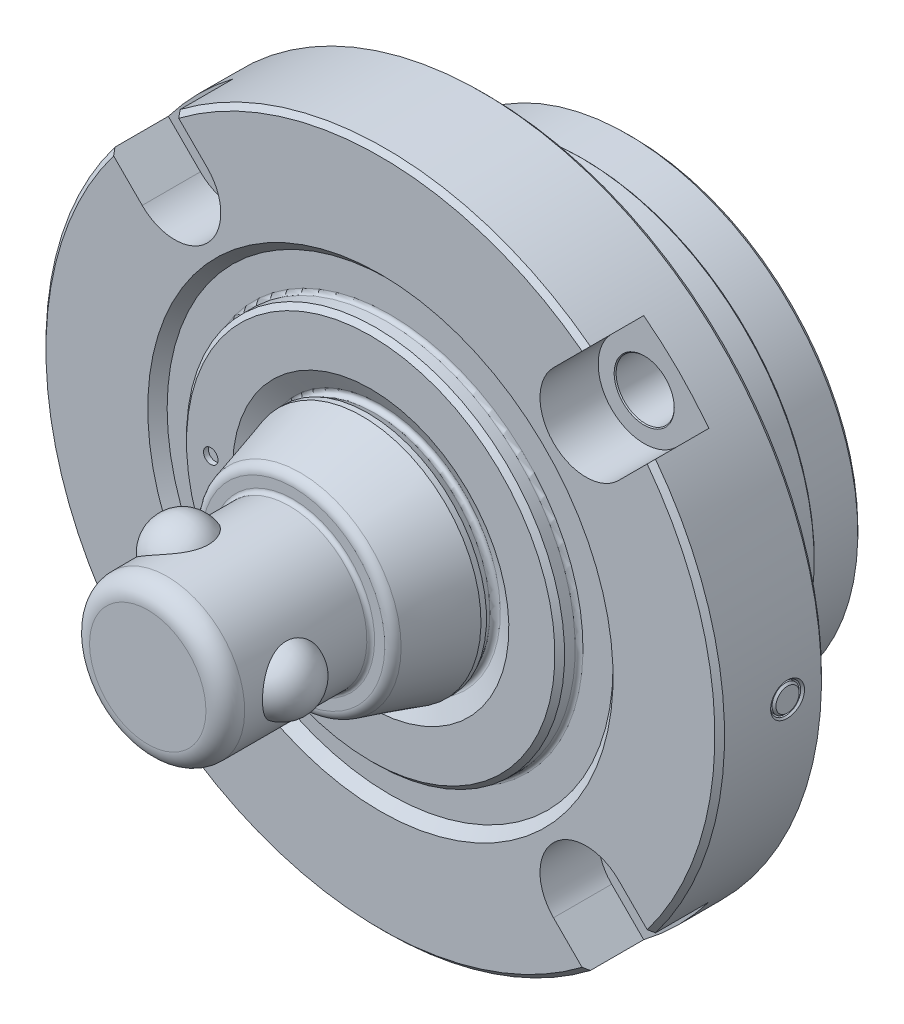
ISO-10303-21;
HEADER;
FILE_DESCRIPTION(('STEP AP214'),'2;1');
FILE_NAME('part.step','',(''),(''),'','','');
FILE_SCHEMA(('AUTOMOTIVE_DESIGN { 1 0 10303 214 1 1 1 1 }'));
ENDSEC;
DATA;
#1=APPLICATION_CONTEXT('core data for automotive mechanical design processes');
#2=APPLICATION_PROTOCOL_DEFINITION('international standard','automotive_design',2000,#1);
#3=PRODUCT_CONTEXT('',#1,'mechanical');
#4=PRODUCT('Part','Part','',(#3));
#5=PRODUCT_RELATED_PRODUCT_CATEGORY('part','',(#4));
#6=PRODUCT_DEFINITION_FORMATION('','',#4);
#7=PRODUCT_DEFINITION_CONTEXT('part definition',#1,'design');
#8=PRODUCT_DEFINITION('design','',#6,#7);
#9=PRODUCT_DEFINITION_SHAPE('','',#8);
#10=(LENGTH_UNIT() NAMED_UNIT(*) SI_UNIT(.MILLI.,.METRE.));
#11=(NAMED_UNIT(*) PLANE_ANGLE_UNIT() SI_UNIT($,.RADIAN.));
#12=(NAMED_UNIT(*) SI_UNIT($,.STERADIAN.) SOLID_ANGLE_UNIT());
#13=UNCERTAINTY_MEASURE_WITH_UNIT(LENGTH_MEASURE(1.E-05),#10,'distance_accuracy_value','');
#14=(GEOMETRIC_REPRESENTATION_CONTEXT(3) GLOBAL_UNCERTAINTY_ASSIGNED_CONTEXT((#13)) GLOBAL_UNIT_ASSIGNED_CONTEXT((#10,
#11,#12)) REPRESENTATION_CONTEXT('',''));
#15=CARTESIAN_POINT('',(0.,0.,0.));
#16=DIRECTION('',(0.,0.,1.));
#17=DIRECTION('',(1.,0.,0.));
#18=AXIS2_PLACEMENT_3D('',#15,#16,#17);
#19=CARTESIAN_POINT('',(0.,0.,-13.));
#20=DIRECTION('',(0.,0.,1.));
#21=DIRECTION('',(0.,-1.,0.));
#22=AXIS2_PLACEMENT_3D('',#19,#20,#21);
#23=PLANE('',#22);
#24=CARTESIAN_POINT('',(-8.36455974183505,-17.5595170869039,-13.));
#25=DIRECTION('',(0.,0.,1.));
#26=DIRECTION('',(0.,-1.,0.));
#27=AXIS2_PLACEMENT_3D('',#24,#25,#26);
#28=CIRCLE('',#27,1.24999999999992);
#29=CARTESIAN_POINT('',(-8.36455974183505,-18.8095170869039,-13.));
#30=VERTEX_POINT('',#29);
#31=EDGE_CURVE('E434',#30,#30,#28,.T.);
#32=ORIENTED_EDGE('',*,*,#31,.T.);
#33=EDGE_LOOP('',(#32));
#34=FACE_BOUND('',#33,.T.);
#35=DIRECTION('',(0.17364817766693,0.984807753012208,0.));
#36=VECTOR('',#35,1.);
#37=CARTESIAN_POINT('',(-5.41013648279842,-18.0804616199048,-13.));
#38=LINE('',#37,#36);
#39=CARTESIAN_POINT('',(-5.78181885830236,-20.1883771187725,-13.));
#40=VERTEX_POINT('',#39);
#41=CARTESIAN_POINT('',(-5.41013648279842,-18.0804616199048,-13.));
#42=VERTEX_POINT('',#41);
#43=EDGE_CURVE('E527',#40,#42,#38,.T.);
#44=ORIENTED_EDGE('',*,*,#43,.F.);
#45=CARTESIAN_POINT('',(0.,0.,-13.));
#46=DIRECTION('',(0.,0.,1.));
#47=DIRECTION('',(0.,-1.,0.));
#48=AXIS2_PLACEMENT_3D('',#45,#46,#47);
#49=CIRCLE('',#48,21.);
#50=CARTESIAN_POINT('',(5.78181885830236,-20.1883771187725,-13.));
#51=VERTEX_POINT('',#50);
#52=EDGE_CURVE('E907',#51,#40,#49,.T.);
#53=ORIENTED_EDGE('',*,*,#52,.F.);
#54=DIRECTION('',(0.17364817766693,-0.984807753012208,0.));
#55=VECTOR('',#54,1.);
#56=CARTESIAN_POINT('',(5.41013648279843,-18.0804616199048,-13.));
#57=LINE('',#56,#55);
#58=CARTESIAN_POINT('',(5.41013648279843,-18.0804616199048,-13.));
#59=VERTEX_POINT('',#58);
#60=EDGE_CURVE('E539',#59,#51,#57,.T.);
#61=ORIENTED_EDGE('',*,*,#60,.F.);
#62=CARTESIAN_POINT('',(8.36455974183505,-17.5595170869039,-13.));
#63=DIRECTION('',(0.,0.,1.));
#64=DIRECTION('',(0.,-1.,0.));
#65=AXIS2_PLACEMENT_3D('',#62,#63,#64);
#66=CIRCLE('',#65,3.);
#67=CARTESIAN_POINT('',(10.1630096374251,-15.158355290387,-13.));
#68=VERTEX_POINT('',#67);
#69=EDGE_CURVE('E535',#68,#59,#66,.T.);
#70=ORIENTED_EDGE('',*,*,#69,.F.);
#71=CARTESIAN_POINT('',(0.,0.,-13.));
#72=DIRECTION('',(0.,0.,-1.));
#73=DIRECTION('',(0.,-1.,0.));
#74=AXIS2_PLACEMENT_3D('',#71,#72,#73);
#75=CIRCLE('',#74,18.25);
#76=CARTESIAN_POINT('',(-10.1630096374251,-15.158355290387,-13.));
#77=VERTEX_POINT('',#76);
#78=EDGE_CURVE('E531',#77,#68,#75,.T.);
#79=ORIENTED_EDGE('',*,*,#78,.F.);
#80=CARTESIAN_POINT('',(-8.36455974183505,-17.5595170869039,-13.));
#81=DIRECTION('',(0.,0.,1.));
#82=DIRECTION('',(0.,1.,0.));
#83=AXIS2_PLACEMENT_3D('',#80,#81,#82);
#84=CIRCLE('',#83,3.);
#85=EDGE_CURVE('E526',#42,#77,#84,.T.);
#86=ORIENTED_EDGE('',*,*,#85,.F.);
#87=EDGE_LOOP('',(#44,#53,#61,#70,#79,#86));
#88=FACE_BOUND('',#87,.T.);
#89=CARTESIAN_POINT('',(8.36455974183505,-17.5595170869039,-13.));
#90=DIRECTION('',(0.,0.,1.));
#91=DIRECTION('',(0.,1.,0.));
#92=AXIS2_PLACEMENT_3D('',#89,#90,#91);
#93=CIRCLE('',#92,1.24999999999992);
#94=CARTESIAN_POINT('',(8.36455974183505,-16.309517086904,-13.));
#95=VERTEX_POINT('',#94);
#96=EDGE_CURVE('E561',#95,#95,#93,.T.);
#97=ORIENTED_EDGE('',*,*,#96,.T.);
#98=EDGE_LOOP('',(#97));
#99=FACE_BOUND('',#98,.T.);
#100=ADVANCED_FACE('F14',(#34,#88,#99),#23,.F.);
#101=CARTESIAN_POINT('',(-5.41013648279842,-18.0804616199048,-11.25));
#102=DIRECTION('',(-0.984807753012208,0.17364817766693,0.));
#103=DIRECTION('',(-0.17364817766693,-0.984807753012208,0.));
#104=AXIS2_PLACEMENT_3D('',#101,#102,#103);
#105=PLANE('',#104);
#106=CARTESIAN_POINT('',(-6.,-21.4257438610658,-13.));
#107=VERTEX_POINT('',#106);
#108=EDGE_CURVE('E558',#107,#40,#38,.T.);
#109=ORIENTED_EDGE('',*,*,#108,.T.);
#110=ORIENTED_EDGE('',*,*,#43,.T.);
#111=DIRECTION('',(0.,0.,-1.));
#112=VECTOR('',#111,1.);
#113=CARTESIAN_POINT('',(-5.41013648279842,-18.0804616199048,-11.25));
#114=LINE('',#113,#112);
#115=CARTESIAN_POINT('',(-5.41013648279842,-18.0804616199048,-11.25));
#116=VERTEX_POINT('',#115);
#117=EDGE_CURVE('E528',#116,#42,#114,.T.);
#118=ORIENTED_EDGE('',*,*,#117,.F.);
#119=DIRECTION('',(0.17364817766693,0.984807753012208,0.));
#120=VECTOR('',#119,1.);
#121=CARTESIAN_POINT('',(-5.41013648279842,-18.0804616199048,-11.25));
#122=LINE('',#121,#120);
#123=CARTESIAN_POINT('',(-6.,-21.4257438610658,-11.25));
#124=VERTEX_POINT('',#123);
#125=EDGE_CURVE('E575',#124,#116,#122,.T.);
#126=ORIENTED_EDGE('',*,*,#125,.F.);
#127=DIRECTION('',(0.,0.,-1.));
#128=VECTOR('',#127,1.);
#129=CARTESIAN_POINT('',(-6.,-21.4257438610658,-11.25));
#130=LINE('',#129,#128);
#131=EDGE_CURVE('E523',#124,#107,#130,.T.);
#132=ORIENTED_EDGE('',*,*,#131,.T.);
#133=EDGE_LOOP('',(#109,#110,#118,#126,#132));
#134=FACE_BOUND('',#133,.T.);
#135=ADVANCED_FACE('F680',(#134),#105,.F.);
#136=CARTESIAN_POINT('',(-8.36455974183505,-17.5595170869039,-11.25));
#137=DIRECTION('',(0.,0.,-1.));
#138=DIRECTION('',(0.,1.,0.));
#139=AXIS2_PLACEMENT_3D('',#136,#137,#138);
#140=CYLINDRICAL_SURFACE('',#139,3.);
#141=ORIENTED_EDGE('',*,*,#85,.T.);
#142=DIRECTION('',(0.,0.,-1.));
#143=VECTOR('',#142,1.);
#144=CARTESIAN_POINT('',(-10.1630096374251,-15.158355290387,-11.25));
#145=LINE('',#144,#143);
#146=CARTESIAN_POINT('',(-10.1630096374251,-15.158355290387,-11.25));
#147=VERTEX_POINT('',#146);
#148=EDGE_CURVE('E532',#147,#77,#145,.T.);
#149=ORIENTED_EDGE('',*,*,#148,.F.);
#150=CARTESIAN_POINT('',(-8.36455974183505,-17.5595170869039,-11.25));
#151=DIRECTION('',(0.,0.,1.));
#152=DIRECTION('',(0.,1.,0.));
#153=AXIS2_PLACEMENT_3D('',#150,#151,#152);
#154=CIRCLE('',#153,3.);
#155=EDGE_CURVE('E572',#116,#147,#154,.T.);
#156=ORIENTED_EDGE('',*,*,#155,.F.);
#157=ORIENTED_EDGE('',*,*,#117,.T.);
#158=EDGE_LOOP('',(#141,#149,#156,#157));
#159=FACE_BOUND('',#158,.T.);
#160=ADVANCED_FACE('F686',(#159),#140,.T.);
#161=CARTESIAN_POINT('',(0.,0.,-11.25));
#162=DIRECTION('',(0.,0.,-1.));
#163=DIRECTION('',(0.,1.,0.));
#164=AXIS2_PLACEMENT_3D('',#161,#162,#163);
#165=CYLINDRICAL_SURFACE('',#164,18.25);
#166=ORIENTED_EDGE('',*,*,#78,.T.);
#167=DIRECTION('',(0.,0.,-1.));
#168=VECTOR('',#167,1.);
#169=CARTESIAN_POINT('',(10.1630096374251,-15.158355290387,-11.25));
#170=LINE('',#169,#168);
#171=CARTESIAN_POINT('',(10.1630096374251,-15.158355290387,-11.25));
#172=VERTEX_POINT('',#171);
#173=EDGE_CURVE('E536',#172,#68,#170,.T.);
#174=ORIENTED_EDGE('',*,*,#173,.F.);
#175=CARTESIAN_POINT('',(0.,0.,-11.25));
#176=DIRECTION('',(0.,0.,-1.));
#177=DIRECTION('',(0.,-1.,0.));
#178=AXIS2_PLACEMENT_3D('',#175,#176,#177);
#179=CIRCLE('',#178,18.25);
#180=EDGE_CURVE('E569',#147,#172,#179,.T.);
#181=ORIENTED_EDGE('',*,*,#180,.F.);
#182=ORIENTED_EDGE('',*,*,#148,.T.);
#183=EDGE_LOOP('',(#166,#174,#181,#182));
#184=FACE_BOUND('',#183,.T.);
#185=ADVANCED_FACE('F753',(#184),#165,.F.);
#186=CARTESIAN_POINT('',(8.36455974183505,-17.5595170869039,-11.25));
#187=DIRECTION('',(0.,0.,-1.));
#188=DIRECTION('',(0.,1.,0.));
#189=AXIS2_PLACEMENT_3D('',#186,#187,#188);
#190=CYLINDRICAL_SURFACE('',#189,3.);
#191=ORIENTED_EDGE('',*,*,#69,.T.);
#192=DIRECTION('',(0.,0.,-1.));
#193=VECTOR('',#192,1.);
#194=CARTESIAN_POINT('',(5.41013648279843,-18.0804616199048,-11.25));
#195=LINE('',#194,#193);
#196=CARTESIAN_POINT('',(5.41013648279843,-18.0804616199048,-11.25));
#197=VERTEX_POINT('',#196);
#198=EDGE_CURVE('E540',#197,#59,#195,.T.);
#199=ORIENTED_EDGE('',*,*,#198,.F.);
#200=CARTESIAN_POINT('',(8.36455974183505,-17.5595170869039,-11.25));
#201=DIRECTION('',(0.,0.,1.));
#202=DIRECTION('',(0.,-1.,0.));
#203=AXIS2_PLACEMENT_3D('',#200,#201,#202);
#204=CIRCLE('',#203,3.);
#205=EDGE_CURVE('E566',#172,#197,#204,.T.);
#206=ORIENTED_EDGE('',*,*,#205,.F.);
#207=ORIENTED_EDGE('',*,*,#173,.T.);
#208=EDGE_LOOP('',(#191,#199,#206,#207));
#209=FACE_BOUND('',#208,.T.);
#210=ADVANCED_FACE('F701',(#209),#190,.T.);
#211=CARTESIAN_POINT('',(5.41013648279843,-18.0804616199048,-11.25));
#212=DIRECTION('',(0.984807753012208,0.17364817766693,0.));
#213=DIRECTION('',(-0.17364817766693,0.984807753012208,0.));
#214=AXIS2_PLACEMENT_3D('',#211,#212,#213);
#215=PLANE('',#214);
#216=ORIENTED_EDGE('',*,*,#60,.T.);
#217=CARTESIAN_POINT('',(6.,-21.4257438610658,-13.));
#218=VERTEX_POINT('',#217);
#219=EDGE_CURVE('E544',#51,#218,#57,.T.);
#220=ORIENTED_EDGE('',*,*,#219,.T.);
#221=DIRECTION('',(0.,0.,-1.));
#222=VECTOR('',#221,1.);
#223=CARTESIAN_POINT('',(6.,-21.4257438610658,-11.25));
#224=LINE('',#223,#222);
#225=CARTESIAN_POINT('',(6.,-21.4257438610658,-11.25));
#226=VERTEX_POINT('',#225);
#227=EDGE_CURVE('E545',#226,#218,#224,.T.);
#228=ORIENTED_EDGE('',*,*,#227,.F.);
#229=DIRECTION('',(0.17364817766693,-0.984807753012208,0.));
#230=VECTOR('',#229,1.);
#231=CARTESIAN_POINT('',(5.41013648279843,-18.0804616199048,-11.25));
#232=LINE('',#231,#230);
#233=EDGE_CURVE('E562',#197,#226,#232,.T.);
#234=ORIENTED_EDGE('',*,*,#233,.F.);
#235=ORIENTED_EDGE('',*,*,#198,.T.);
#236=EDGE_LOOP('',(#216,#220,#228,#234,#235));
#237=FACE_BOUND('',#236,.T.);
#238=ADVANCED_FACE('F690',(#237),#215,.F.);
#239=CARTESIAN_POINT('',(-8.36455974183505,-17.5595170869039,-11.25));
#240=DIRECTION('',(0.,0.,-1.));
#241=DIRECTION('',(0.,1.,0.));
#242=AXIS2_PLACEMENT_3D('',#239,#240,#241);
#243=CYLINDRICAL_SURFACE('',#242,1.24999999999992);
#244=CARTESIAN_POINT('',(-8.36455974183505,-17.5595170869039,-11.25));
#245=DIRECTION('',(0.,0.,-1.));
#246=DIRECTION('',(0.,1.,0.));
#247=AXIS2_PLACEMENT_3D('',#244,#245,#246);
#248=CIRCLE('',#247,1.24999999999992);
#249=CARTESIAN_POINT('',(-8.36455974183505,-16.309517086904,-11.25));
#250=VERTEX_POINT('',#249);
#251=EDGE_CURVE('E549',#250,#250,#248,.T.);
#252=ORIENTED_EDGE('',*,*,#251,.F.);
#253=EDGE_LOOP('',(#252));
#254=FACE_BOUND('',#253,.T.);
#255=ORIENTED_EDGE('',*,*,#31,.F.);
#256=EDGE_LOOP('',(#255));
#257=FACE_BOUND('',#256,.T.);
#258=ADVANCED_FACE('F692',(#254,#257),#243,.F.);
#259=CARTESIAN_POINT('',(8.36455974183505,-17.5595170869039,-11.25));
#260=DIRECTION('',(0.,0.,-1.));
#261=DIRECTION('',(0.,1.,0.));
#262=AXIS2_PLACEMENT_3D('',#259,#260,#261);
#263=CYLINDRICAL_SURFACE('',#262,1.24999999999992);
#264=CARTESIAN_POINT('',(8.36455974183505,-17.5595170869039,-11.25));
#265=DIRECTION('',(0.,0.,-1.));
#266=DIRECTION('',(0.,1.,0.));
#267=AXIS2_PLACEMENT_3D('',#264,#265,#266);
#268=CIRCLE('',#267,1.24999999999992);
#269=CARTESIAN_POINT('',(8.36455974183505,-16.309517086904,-11.25));
#270=VERTEX_POINT('',#269);
#271=EDGE_CURVE('E543',#270,#270,#268,.T.);
#272=ORIENTED_EDGE('',*,*,#271,.F.);
#273=EDGE_LOOP('',(#272));
#274=FACE_BOUND('',#273,.T.);
#275=ORIENTED_EDGE('',*,*,#96,.F.);
#276=EDGE_LOOP('',(#275));
#277=FACE_BOUND('',#276,.T.);
#278=ADVANCED_FACE('F603',(#274,#277),#263,.F.);
#279=CARTESIAN_POINT('',(0.,0.,-11.25));
#280=DIRECTION('',(0.,0.,-1.));
#281=DIRECTION('',(0.,1.,0.));
#282=AXIS2_PLACEMENT_3D('',#279,#280,#281);
#283=PLANE('',#282);
#284=ORIENTED_EDGE('',*,*,#271,.T.);
#285=EDGE_LOOP('',(#284));
#286=FACE_BOUND('',#285,.T.);
#287=ADVANCED_FACE('F699',(#286),#283,.T.);
#288=ORIENTED_EDGE('',*,*,#251,.T.);
#289=EDGE_LOOP('',(#288));
#290=FACE_BOUND('',#289,.T.);
#291=ADVANCED_FACE('F707',(#290),#283,.T.);
#292=CARTESIAN_POINT('',(0.,0.,0.));
#293=DIRECTION('',(0.,0.,1.));
#294=DIRECTION('',(0.,-1.,0.));
#295=AXIS2_PLACEMENT_3D('',#292,#293,#294);
#296=CYLINDRICAL_SURFACE('',#295,22.25);
#297=ORIENTED_EDGE('',*,*,#131,.F.);
#298=CARTESIAN_POINT('',(0.,0.,-11.25));
#299=DIRECTION('',(0.,0.,-1.));
#300=DIRECTION('',(0.,1.,0.));
#301=AXIS2_PLACEMENT_3D('',#298,#299,#300);
#302=CIRCLE('',#301,22.25);
#303=EDGE_CURVE('E565',#226,#124,#302,.T.);
#304=ORIENTED_EDGE('',*,*,#303,.F.);
#305=ORIENTED_EDGE('',*,*,#227,.T.);
#306=CARTESIAN_POINT('',(0.,0.,-13.));
#307=DIRECTION('',(0.,0.,1.));
#308=DIRECTION('',(0.,-1.,0.));
#309=AXIS2_PLACEMENT_3D('',#306,#307,#308);
#310=CIRCLE('',#309,22.25);
#311=EDGE_CURVE('E548',#107,#218,#310,.T.);
#312=ORIENTED_EDGE('',*,*,#311,.F.);
#313=EDGE_LOOP('',(#297,#304,#305,#312));
#314=FACE_BOUND('',#313,.T.);
#315=ADVANCED_FACE('F709',(#314),#296,.F.);
#316=CARTESIAN_POINT('',(21.,0.,-13.));
#317=DIRECTION('',(0.,0.,1.));
#318=DIRECTION('',(0.,-1.,0.));
#319=AXIS2_PLACEMENT_3D('',#316,#317,#318);
#320=PLANE('',#319);
#321=ORIENTED_EDGE('',*,*,#108,.F.);
#322=ORIENTED_EDGE('',*,*,#311,.T.);
#323=ORIENTED_EDGE('',*,*,#219,.F.);
#324=EDGE_CURVE('E910',#40,#51,#49,.T.);
#325=ORIENTED_EDGE('',*,*,#324,.F.);
#326=EDGE_LOOP('',(#321,#322,#323,#325));
#327=FACE_BOUND('',#326,.T.);
#328=ADVANCED_FACE('F715',(#327),#320,.T.);
#329=CARTESIAN_POINT('',(0.,0.,-11.25));
#330=DIRECTION('',(0.,0.,-1.));
#331=DIRECTION('',(0.,1.,0.));
#332=AXIS2_PLACEMENT_3D('',#329,#330,#331);
#333=CIRCLE('',#332,4.);
#334=CARTESIAN_POINT('',(0.,4.,-11.25));
#335=VERTEX_POINT('',#334);
#336=EDGE_CURVE('E476',#335,#335,#333,.T.);
#337=ORIENTED_EDGE('',*,*,#336,.F.);
#338=EDGE_LOOP('',(#337));
#339=FACE_BOUND('',#338,.T.);
#340=ORIENTED_EDGE('',*,*,#125,.T.);
#341=ORIENTED_EDGE('',*,*,#155,.T.);
#342=ORIENTED_EDGE('',*,*,#180,.T.);
#343=ORIENTED_EDGE('',*,*,#205,.T.);
#344=ORIENTED_EDGE('',*,*,#233,.T.);
#345=ORIENTED_EDGE('',*,*,#303,.T.);
#346=EDGE_LOOP('',(#340,#341,#342,#343,#344,#345));
#347=FACE_BOUND('',#346,.T.);
#348=ADVANCED_FACE('F601',(#339,#347),#283,.T.);
#349=CARTESIAN_POINT('',(23.25,0.,-5.85));
#350=DIRECTION('',(0.,-1.,0.));
#351=DIRECTION('',(0.,0.,1.));
#352=AXIS2_PLACEMENT_3D('',#349,#350,#351);
#353=ELLIPSE('',#352,1.35,0.75);
#354=CARTESIAN_POINT('',(0.,0.,-5.85));
#355=DIRECTION('',(0.,0.,-1.));
#356=AXIS1_PLACEMENT('',#354,#355);
#357=SURFACE_OF_REVOLUTION('',#353,#356);
#358=CARTESIAN_POINT('',(0.,0.,-4.5));
#359=DIRECTION('',(0.,0.,-1.));
#360=DIRECTION('',(0.,1.,0.));
#361=AXIS2_PLACEMENT_3D('',#358,#359,#360);
#362=CIRCLE('',#361,23.25);
#363=CARTESIAN_POINT('',(0.,23.25,-4.5));
#364=VERTEX_POINT('',#363);
#365=EDGE_CURVE('E114',#364,#364,#362,.F.);
#366=ORIENTED_EDGE('',*,*,#365,.F.);
#367=EDGE_LOOP('',(#366));
#368=FACE_BOUND('',#367,.T.);
#369=CARTESIAN_POINT('',(0.,0.,-7.2));
#370=DIRECTION('',(0.,0.,-1.));
#371=DIRECTION('',(0.,1.,0.));
#372=AXIS2_PLACEMENT_3D('',#369,#370,#371);
#373=CIRCLE('',#372,23.25);
#374=CARTESIAN_POINT('',(0.,23.25,-7.2));
#375=VERTEX_POINT('',#374);
#376=EDGE_CURVE('E589',#375,#375,#373,.T.);
#377=ORIENTED_EDGE('',*,*,#376,.F.);
#378=EDGE_LOOP('',(#377));
#379=FACE_BOUND('',#378,.T.);
#380=ADVANCED_FACE('F596',(#368,#379),#357,.F.);
#381=CARTESIAN_POINT('',(0.,0.,0.));
#382=DIRECTION('',(0.,0.,1.));
#383=DIRECTION('',(0.,-1.,0.));
#384=AXIS2_PLACEMENT_3D('',#381,#382,#383);
#385=CYLINDRICAL_SURFACE('',#384,21.);
#386=CARTESIAN_POINT('',(0.,0.,-14.8));
#387=DIRECTION('',(0.,0.,1.));
#388=DIRECTION('',(0.,-1.,0.));
#389=AXIS2_PLACEMENT_3D('',#386,#387,#388);
#390=CIRCLE('',#389,21.);
#391=CARTESIAN_POINT('',(0.,-21.,-14.8));
#392=VERTEX_POINT('',#391);
#393=EDGE_CURVE('E911',#392,#392,#390,.F.);
#394=ORIENTED_EDGE('',*,*,#393,.T.);
#395=EDGE_LOOP('',(#394));
#396=FACE_BOUND('',#395,.T.);
#397=ORIENTED_EDGE('',*,*,#52,.T.);
#398=ORIENTED_EDGE('',*,*,#324,.T.);
#399=EDGE_LOOP('',(#397,#398));
#400=FACE_BOUND('',#399,.T.);
#401=ADVANCED_FACE('F600',(#396,#400),#385,.F.);
#402=CARTESIAN_POINT('',(0.,0.,-15.));
#403=DIRECTION('',(0.,0.,-1.));
#404=DIRECTION('',(0.,1.,0.));
#405=AXIS2_PLACEMENT_3D('',#402,#403,#404);
#406=CONICAL_SURFACE('',#405,21.2,0.785398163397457);
#407=ORIENTED_EDGE('',*,*,#393,.F.);
#408=EDGE_LOOP('',(#407));
#409=FACE_BOUND('',#408,.T.);
#410=CARTESIAN_POINT('',(0.,0.,-15.));
#411=DIRECTION('',(0.,0.,1.));
#412=DIRECTION('',(0.,-1.,0.));
#413=AXIS2_PLACEMENT_3D('',#410,#411,#412);
#414=CIRCLE('',#413,21.2);
#415=CARTESIAN_POINT('',(0.,-21.2,-15.));
#416=VERTEX_POINT('',#415);
#417=EDGE_CURVE('E881',#416,#416,#414,.T.);
#418=ORIENTED_EDGE('',*,*,#417,.F.);
#419=EDGE_LOOP('',(#418));
#420=FACE_BOUND('',#419,.T.);
#421=ADVANCED_FACE('F632',(#409,#420),#406,.F.);
#422=CARTESIAN_POINT('',(3.9,0.,-15.));
#423=DIRECTION('',(0.,0.,1.));
#424=DIRECTION('',(0.,-1.,0.));
#425=AXIS2_PLACEMENT_3D('',#422,#423,#424);
#426=PLANE('',#425);
#427=ORIENTED_EDGE('',*,*,#417,.T.);
#428=EDGE_LOOP('',(#427));
#429=FACE_BOUND('',#428,.T.);
#430=CARTESIAN_POINT('',(0.,0.,-15.));
#431=DIRECTION('',(0.,0.,1.));
#432=DIRECTION('',(0.,-1.,0.));
#433=AXIS2_PLACEMENT_3D('',#430,#431,#432);
#434=CIRCLE('',#433,23.25);
#435=CARTESIAN_POINT('',(0.,-23.25,-15.));
#436=VERTEX_POINT('',#435);
#437=EDGE_CURVE('E877',#436,#436,#434,.F.);
#438=ORIENTED_EDGE('',*,*,#437,.T.);
#439=EDGE_LOOP('',(#438));
#440=FACE_BOUND('',#439,.T.);
#441=ADVANCED_FACE('F635',(#429,#440),#426,.F.);
#442=CARTESIAN_POINT('',(0.,0.,-14.5));
#443=DIRECTION('',(0.,0.,1.));
#444=DIRECTION('',(0.,-1.,0.));
#445=AXIS2_PLACEMENT_3D('',#442,#443,#444);
#446=CONICAL_SURFACE('',#445,23.75,0.785398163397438);
#447=ORIENTED_EDGE('',*,*,#437,.F.);
#448=EDGE_LOOP('',(#447));
#449=FACE_BOUND('',#448,.T.);
#450=CARTESIAN_POINT('',(0.,0.,-14.5));
#451=DIRECTION('',(0.,0.,1.));
#452=DIRECTION('',(0.,-1.,0.));
#453=AXIS2_PLACEMENT_3D('',#450,#451,#452);
#454=CIRCLE('',#453,23.75);
#455=CARTESIAN_POINT('',(0.,-23.75,-14.5));
#456=VERTEX_POINT('',#455);
#457=EDGE_CURVE('E880',#456,#456,#454,.T.);
#458=ORIENTED_EDGE('',*,*,#457,.F.);
#459=EDGE_LOOP('',(#458));
#460=FACE_BOUND('',#459,.T.);
#461=ADVANCED_FACE('F659',(#449,#460),#446,.T.);
#462=CARTESIAN_POINT('',(0.,0.,0.));
#463=DIRECTION('',(0.,0.,1.));
#464=DIRECTION('',(0.,-1.,0.));
#465=AXIS2_PLACEMENT_3D('',#462,#463,#464);
#466=CYLINDRICAL_SURFACE('',#465,23.75);
#467=ORIENTED_EDGE('',*,*,#457,.T.);
#468=EDGE_LOOP('',(#467));
#469=FACE_BOUND('',#468,.T.);
#470=CARTESIAN_POINT('',(0.,0.,-10.));
#471=DIRECTION('',(0.,0.,1.));
#472=DIRECTION('',(0.,-1.,0.));
#473=AXIS2_PLACEMENT_3D('',#470,#471,#472);
#474=CIRCLE('',#473,23.75);
#475=CARTESIAN_POINT('',(0.,-23.75,-10.));
#476=VERTEX_POINT('',#475);
#477=EDGE_CURVE('E884',#476,#476,#474,.T.);
#478=ORIENTED_EDGE('',*,*,#477,.F.);
#479=EDGE_LOOP('',(#478));
#480=FACE_BOUND('',#479,.T.);
#481=ADVANCED_FACE('F662',(#469,#480),#466,.T.);
#482=CARTESIAN_POINT('',(0.,0.,-9.75));
#483=DIRECTION('',(0.,0.,1.));
#484=DIRECTION('',(0.,-1.,0.));
#485=AXIS2_PLACEMENT_3D('',#482,#483,#484);
#486=CONICAL_SURFACE('',#485,24.,0.785398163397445);
#487=ORIENTED_EDGE('',*,*,#477,.T.);
#488=EDGE_LOOP('',(#487));
#489=FACE_BOUND('',#488,.T.);
#490=CARTESIAN_POINT('',(0.,0.,-9.75));
#491=DIRECTION('',(0.,0.,1.));
#492=DIRECTION('',(0.,-1.,0.));
#493=AXIS2_PLACEMENT_3D('',#490,#491,#492);
#494=CIRCLE('',#493,24.);
#495=CARTESIAN_POINT('',(0.,-24.,-9.75));
#496=VERTEX_POINT('',#495);
#497=EDGE_CURVE('E592',#496,#496,#494,.T.);
#498=ORIENTED_EDGE('',*,*,#497,.F.);
#499=EDGE_LOOP('',(#498));
#500=FACE_BOUND('',#499,.T.);
#501=ADVANCED_FACE('F1023',(#489,#500),#486,.T.);
#502=CARTESIAN_POINT('',(0.,0.,0.));
#503=DIRECTION('',(0.,0.,1.));
#504=DIRECTION('',(0.,-1.,0.));
#505=AXIS2_PLACEMENT_3D('',#502,#503,#504);
#506=CYLINDRICAL_SURFACE('',#505,24.);
#507=ORIENTED_EDGE('',*,*,#497,.T.);
#508=EDGE_LOOP('',(#507));
#509=FACE_BOUND('',#508,.T.);
#510=CARTESIAN_POINT('',(0.,0.,-7.2));
#511=DIRECTION('',(0.,0.,1.));
#512=DIRECTION('',(0.,-1.,0.));
#513=AXIS2_PLACEMENT_3D('',#510,#511,#512);
#514=CIRCLE('',#513,24.);
#515=CARTESIAN_POINT('',(0.,-24.,-7.2));
#516=VERTEX_POINT('',#515);
#517=EDGE_CURVE('E238',#516,#516,#514,.T.);
#518=ORIENTED_EDGE('',*,*,#517,.F.);
#519=EDGE_LOOP('',(#518));
#520=FACE_BOUND('',#519,.T.);
#521=ADVANCED_FACE('F1016',(#509,#520),#506,.T.);
#522=CARTESIAN_POINT('',(24.,0.,-7.2));
#523=DIRECTION('',(0.,0.,1.));
#524=DIRECTION('',(0.,-1.,0.));
#525=AXIS2_PLACEMENT_3D('',#522,#523,#524);
#526=PLANE('',#525);
#527=ORIENTED_EDGE('',*,*,#376,.T.);
#528=EDGE_LOOP('',(#527));
#529=FACE_BOUND('',#528,.T.);
#530=ORIENTED_EDGE('',*,*,#517,.T.);
#531=EDGE_LOOP('',(#530));
#532=FACE_BOUND('',#531,.T.);
#533=ADVANCED_FACE('F1013',(#529,#532),#526,.T.);
#534=CARTESIAN_POINT('',(-16.5,0.,12.));
#535=DIRECTION('',(0.,0.,1.));
#536=DIRECTION('',(0.,-1.,0.));
#537=AXIS2_PLACEMENT_3D('',#534,#535,#536);
#538=CYLINDRICAL_SURFACE('',#537,0.749999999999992);
#539=CARTESIAN_POINT('',(-16.5,0.,11.5));
#540=DIRECTION('',(0.,0.,1.));
#541=DIRECTION('',(0.,-1.,0.));
#542=AXIS2_PLACEMENT_3D('',#539,#540,#541);
#543=CIRCLE('',#542,0.749999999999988);
#544=CARTESIAN_POINT('',(-16.5,-0.749999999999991,11.5));
#545=VERTEX_POINT('',#544);
#546=EDGE_CURVE('E226',#545,#545,#543,.T.);
#547=ORIENTED_EDGE('',*,*,#546,.F.);
#548=EDGE_LOOP('',(#547));
#549=FACE_BOUND('',#548,.T.);
#550=CARTESIAN_POINT('',(-16.5,0.,12.));
#551=DIRECTION('',(0.,0.,1.));
#552=DIRECTION('',(0.,-1.,0.));
#553=AXIS2_PLACEMENT_3D('',#550,#551,#552);
#554=CIRCLE('',#553,0.749999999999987);
#555=CARTESIAN_POINT('',(-16.5,-0.74999999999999,12.));
#556=VERTEX_POINT('',#555);
#557=EDGE_CURVE('E235',#556,#556,#554,.T.);
#558=ORIENTED_EDGE('',*,*,#557,.T.);
#559=EDGE_LOOP('',(#558));
#560=FACE_BOUND('',#559,.T.);
#561=ADVANCED_FACE('F262',(#549,#560),#538,.F.);
#562=CARTESIAN_POINT('',(0.,0.,0.));
#563=DIRECTION('',(0.,0.,1.));
#564=DIRECTION('',(0.,-1.,0.));
#565=AXIS2_PLACEMENT_3D('',#562,#563,#564);
#566=CYLINDRICAL_SURFACE('',#565,8.);
#567=CARTESIAN_POINT('',(7.2670177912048,-3.34521335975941,28.));
#568=CARTESIAN_POINT('',(7.26702459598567,-3.34520714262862,27.8337689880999));
#569=CARTESIAN_POINT('',(7.27316094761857,-3.33196586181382,27.6672687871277));
#570=CARTESIAN_POINT('',(7.29700924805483,-3.27939861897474,27.3390466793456));
#571=CARTESIAN_POINT('',(7.31474973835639,-3.24000833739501,27.1773375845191));
#572=CARTESIAN_POINT('',(7.35968133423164,-3.13659521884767,26.8639833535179));
#573=CARTESIAN_POINT('',(7.38684241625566,-3.07265056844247,26.7123080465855));
#574=CARTESIAN_POINT('',(7.44767447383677,-2.92210619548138,26.4222248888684));
#575=CARTESIAN_POINT('',(7.48134326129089,-2.83551408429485,26.2838126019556));
#576=CARTESIAN_POINT('',(7.55318053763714,-2.63834258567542,26.0180415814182));
#577=CARTESIAN_POINT('',(7.59147083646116,-2.52698173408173,25.8912965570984));
#578=CARTESIAN_POINT('',(7.66770064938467,-2.28526156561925,25.6573057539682));
#579=CARTESIAN_POINT('',(7.70564003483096,-2.15489555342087,25.5500668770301));
#580=CARTESIAN_POINT('',(7.78011624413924,-1.868963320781,25.3502659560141));
#581=CARTESIAN_POINT('',(7.81638487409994,-1.71228929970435,25.2591861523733));
#582=CARTESIAN_POINT('',(7.88095043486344,-1.38507477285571,25.1027173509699));
#583=CARTESIAN_POINT('',(7.90924603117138,-1.21453195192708,25.0373326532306));
#584=CARTESIAN_POINT('',(7.95580457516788,-0.859158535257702,24.9318220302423));
#585=CARTESIAN_POINT('',(7.97376301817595,-0.674061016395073,24.8924581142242));
#586=CARTESIAN_POINT('',(7.9966066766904,-0.299228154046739,24.8426377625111));
#587=CARTESIAN_POINT('',(8.00149179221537,-0.109492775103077,24.8321815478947));
#588=CARTESIAN_POINT('',(7.99771207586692,0.269103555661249,24.8403433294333));
#589=CARTESIAN_POINT('',(7.98905530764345,0.457964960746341,24.8589440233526));
#590=CARTESIAN_POINT('',(7.95905643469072,0.829564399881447,24.9248829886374));
#591=CARTESIAN_POINT('',(7.93771402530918,1.01230228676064,24.9722219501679));
#592=CARTESIAN_POINT('',(7.88445227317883,1.36657426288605,25.0948830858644));
#593=CARTESIAN_POINT('',(7.85252892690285,1.53810408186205,25.1702158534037));
#594=CARTESIAN_POINT('',(7.78135167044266,1.86509698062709,25.3476149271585));
#595=CARTESIAN_POINT('',(7.74209712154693,2.02055865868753,25.4496835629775));
#596=CARTESIAN_POINT('',(7.66044077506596,2.31093373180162,25.6787101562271));
#597=CARTESIAN_POINT('',(7.61803991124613,2.44585318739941,25.8056607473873));
#598=CARTESIAN_POINT('',(7.53489392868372,2.69112997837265,26.0819300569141));
#599=CARTESIAN_POINT('',(7.49414856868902,2.80149090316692,26.2312455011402));
#600=CARTESIAN_POINT('',(7.42065045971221,2.99063992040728,26.5431210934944));
#601=CARTESIAN_POINT('',(7.38766920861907,3.07039172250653,26.7050408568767));
#602=CARTESIAN_POINT('',(7.33213855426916,3.20075325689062,27.0418769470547));
#603=CARTESIAN_POINT('',(7.3095829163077,3.25138041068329,27.216785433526));
#604=CARTESIAN_POINT('',(7.27913492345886,3.31895590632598,27.5607548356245));
#605=CARTESIAN_POINT('',(7.27028605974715,3.33810754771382,27.7292995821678));
#606=CARTESIAN_POINT('',(7.26526142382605,3.34903379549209,28.0674420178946));
#607=CARTESIAN_POINT('',(7.26908188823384,3.34081653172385,28.2370393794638));
#608=CARTESIAN_POINT('',(7.28843386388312,3.29836563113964,28.5640055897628));
#609=CARTESIAN_POINT('',(7.30340226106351,3.26538236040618,28.7215732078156));
#610=CARTESIAN_POINT('',(7.34273429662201,3.17594389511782,29.0286417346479));
#611=CARTESIAN_POINT('',(7.36709875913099,3.11948664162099,29.1781419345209));
#612=CARTESIAN_POINT('',(7.42344186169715,2.98296453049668,29.4693530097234));
#613=CARTESIAN_POINT('',(7.45560531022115,2.90231325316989,29.6107521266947));
#614=CARTESIAN_POINT('',(7.52394379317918,2.72024031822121,29.8783777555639));
#615=CARTESIAN_POINT('',(7.56011999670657,2.6188126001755,30.0045998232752));
#616=CARTESIAN_POINT('',(7.63571821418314,2.38983633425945,30.2479734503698));
#617=CARTESIAN_POINT('',(7.67518856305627,2.26094603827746,30.3638482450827));
#618=CARTESIAN_POINT('',(7.75099568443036,1.98556306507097,30.5736312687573));
#619=CARTESIAN_POINT('',(7.78733156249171,1.83906539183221,30.6675332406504));
#620=CARTESIAN_POINT('',(7.85531401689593,1.52362841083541,30.8364392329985));
#621=CARTESIAN_POINT('',(7.88659185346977,1.35389730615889,30.9101167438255));
#622=CARTESIAN_POINT('',(7.93878441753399,1.00353050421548,31.030165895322));
#623=CARTESIAN_POINT('',(7.95969822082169,0.822893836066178,31.0765351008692));
#624=CARTESIAN_POINT('',(7.98934207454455,0.453084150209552,31.1416785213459));
#625=CARTESIAN_POINT('',(7.99789649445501,0.263826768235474,31.1600551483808));
#626=CARTESIAN_POINT('',(8.00141500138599,-0.115396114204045,31.1676523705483));
#627=CARTESIAN_POINT('',(7.99637907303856,-0.305361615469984,31.1568729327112));
#628=CARTESIAN_POINT('',(7.97324650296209,-0.680061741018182,31.1064081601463));
#629=CARTESIAN_POINT('',(7.95518576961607,-0.864809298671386,31.0668022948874));
#630=CARTESIAN_POINT('',(7.90782518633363,-1.22442104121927,30.9594201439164));
#631=CARTESIAN_POINT('',(7.87852466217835,-1.39928463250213,30.89164216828));
#632=CARTESIAN_POINT('',(7.81154422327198,-1.73468069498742,30.7288178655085));
#633=CARTESIAN_POINT('',(7.77384209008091,-1.89517355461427,30.6336990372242));
#634=CARTESIAN_POINT('',(7.69406441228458,-2.19675367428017,30.4179144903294));
#635=CARTESIAN_POINT('',(7.65198899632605,-2.33784150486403,30.297249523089));
#636=CARTESIAN_POINT('',(7.56852773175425,-2.59529860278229,30.033878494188));
#637=CARTESIAN_POINT('',(7.52713907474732,-2.71187509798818,29.8913764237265));
#638=CARTESIAN_POINT('',(7.4495889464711,-2.91818864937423,29.5866889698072));
#639=CARTESIAN_POINT('',(7.41342847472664,-3.00792057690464,29.4244998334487));
#640=CARTESIAN_POINT('',(7.35268718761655,-3.15339759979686,29.0938046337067));
#641=CARTESIAN_POINT('',(7.32760500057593,-3.21065794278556,28.9260567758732));
#642=CARTESIAN_POINT('',(7.2896848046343,-3.29586481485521,28.582250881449));
#643=CARTESIAN_POINT('',(7.27680981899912,-3.32389989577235,28.4062196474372));
#644=CARTESIAN_POINT('',(7.26958126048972,-3.33963814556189,28.1910572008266));
#645=CARTESIAN_POINT('',(7.26862168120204,-3.34172722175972,28.1528859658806));
#646=CARTESIAN_POINT('',(7.26733916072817,-3.34451555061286,28.0764812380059));
#647=CARTESIAN_POINT('',(7.26701622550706,-3.34521479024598,28.0382477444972));
#648=CARTESIAN_POINT('',(7.2670177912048,-3.34521335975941,28.));
#649=B_SPLINE_CURVE_WITH_KNOTS('',3,(#567,#568,#569,#570,#571,#572,#573,#574,#575,#576,#577,
#578,#579,#580,#581,#582,#583,#584,#585,#586,#587,#588,#589,#590,#591,#592,#593,#594,#595,#596,
#597,#598,#599,#600,#601,#602,#603,#604,#605,#606,#607,#608,#609,#610,#611,#612,#613,#614,#615,
#616,#617,#618,#619,#620,#621,#622,#623,#624,#625,#626,#627,#628,#629,#630,#631,#632,#633,#634,
#635,#636,#637,#638,#639,#640,#641,#642,#643,#644,#645,#646,#647,#648),.UNSPECIFIED.,.T.,.F.,(4,
2,2,2,2,2,2,2,2,2,2,2,2,2,2,2,2,2,2,2,2,2,2,2,2,2,2,2,2,2,2,2,2,2,2,2,2,2,2,2,4),(0.,
0.498535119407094,0.998301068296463,1.4964886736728,1.99450906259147,2.51131099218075,
3.0282954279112,3.58022855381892,4.13225400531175,4.6998029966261,5.26735632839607,
5.83457183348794,6.40180096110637,6.96924495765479,7.53673841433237,8.10406411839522,
8.67130684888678,9.21884213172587,9.76604955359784,10.2730078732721,10.779815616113,
11.2626247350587,11.7454762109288,12.2411341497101,12.7369368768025,13.2678767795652,
13.7989676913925,14.3593243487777,14.9197309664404,15.4880253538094,16.0563203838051,
16.6230546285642,17.1898228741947,17.7581081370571,18.326376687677,18.889628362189,
19.4529875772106,19.9872673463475,20.5199235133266,20.6346293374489,20.749336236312),.UNSPECIFIED.);
#650=CARTESIAN_POINT('',(7.2670177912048,-3.34521335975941,28.));
#651=VERTEX_POINT('',#650);
#652=EDGE_CURVE('E410',#651,#651,#649,.T.);
#653=ORIENTED_EDGE('',*,*,#652,.F.);
#654=EDGE_LOOP('',(#653));
#655=FACE_BOUND('',#654,.T.);
#656=CARTESIAN_POINT('',(-6.53054864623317,4.6208153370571,28.));
#657=CARTESIAN_POINT('',(-6.53054666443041,4.62082433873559,27.8337689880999));
#658=CARTESIAN_POINT('',(-6.52214755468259,4.63275921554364,27.6672687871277));
#659=CARTESIAN_POINT('',(-6.48854713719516,4.67969607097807,27.3390466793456));
#660=CARTESIAN_POINT('',(-6.46330439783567,4.71475492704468,27.1773375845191));
#661=CARTESIAN_POINT('',(-6.39621180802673,4.8053733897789,26.8639833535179));
#662=CARTESIAN_POINT('',(-6.35441465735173,4.86086790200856,26.7123080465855));
#663=CARTESIAN_POINT('',(-6.25445543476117,4.98882219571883,26.4222248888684));
#664=CARTESIAN_POINT('',(-6.19629886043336,5.06127627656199,26.2838126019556));
#665=CARTESIAN_POINT('',(-6.06146197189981,5.22207493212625,26.0180415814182));
#666=CARTESIAN_POINT('',(-5.98416579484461,5.31091572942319,25.8912965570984));
#667=CARTESIAN_POINT('',(-5.81294489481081,5.49779276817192,25.6573057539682));
#668=CARTESIAN_POINT('',(-5.7190143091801,5.59583224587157,25.5500668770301));
#669=CARTESIAN_POINT('',(-5.5086278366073,5.80329665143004,25.350265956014));
#670=CARTESIAN_POINT('',(-5.3910784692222,5.9130432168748,25.2591861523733));
#671=CARTESIAN_POINT('',(-5.13998515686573,6.1325658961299,25.1027173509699));
#672=CARTESIAN_POINT('',(-5.00643853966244,6.24234201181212,25.0373326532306));
#673=CARTESIAN_POINT('',(-4.72195540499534,6.460349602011,24.9318220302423));
#674=CARTESIAN_POINT('',(-4.57063547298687,6.56845082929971,24.8924581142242));
#675=CARTESIAN_POINT('',(-4.2574425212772,6.77565044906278,24.8426377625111));
#676=CARTESIAN_POINT('',(-4.0955694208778,6.87474877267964,24.8321815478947));
#677=CARTESIAN_POINT('',(-3.76580552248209,7.06077360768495,24.8403433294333));
#678=CARTESIAN_POINT('',(-3.59791836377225,7.1477073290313,24.8589440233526));
#679=CARTESIAN_POINT('',(-3.26110437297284,7.30752726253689,24.9248829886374));
#680=CARTESIAN_POINT('',(-3.0921775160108,7.3804131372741,24.9722219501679));
#681=CARTESIAN_POINT('',(-2.75873810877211,7.51142309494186,25.0948830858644));
#682=CARTESIAN_POINT('',(-2.59422725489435,7.56954157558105,25.1702158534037));
#683=CARTESIAN_POINT('',(-2.27545446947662,7.67139671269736,25.3476149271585));
#684=CARTESIAN_POINT('',(-2.12119343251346,7.71513211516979,25.4496835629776));
#685=CARTESIAN_POINT('',(-1.82889306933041,7.78960318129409,25.6787101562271));
#686=CARTESIAN_POINT('',(-1.69084896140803,7.8203426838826,25.8056607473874));
#687=CARTESIAN_POINT('',(-1.43686003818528,7.87097454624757,26.0819300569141));
#688=CARTESIAN_POINT('',(-1.32091199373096,7.89086849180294,26.2312455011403));
#689=CARTESIAN_POINT('',(-1.12035508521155,7.92179177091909,26.5431210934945));
#690=CARTESIAN_POINT('',(-1.03479737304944,7.93310507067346,26.7050408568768));
#691=CARTESIAN_POINT('',(-0.894135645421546,7.95019488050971,27.0418769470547));
#692=CARTESIAN_POINT('',(-0.839013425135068,7.95597470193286,27.2167854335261));
#693=CARTESIAN_POINT('',(-0.765267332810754,7.96339371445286,27.5607548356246));
#694=CARTESIAN_POINT('',(-0.744257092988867,7.96530619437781,27.7292995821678));
#695=CARTESIAN_POINT('',(-0.732282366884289,7.9664178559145,28.0674420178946));
#696=CARTESIAN_POINT('',(-0.741308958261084,7.96561784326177,28.2370393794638));
#697=CARTESIAN_POINT('',(-0.787748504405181,7.96115169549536,28.5640055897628));
#698=CARTESIAN_POINT('',(-0.823797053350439,7.95762307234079,28.7215732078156));
#699=CARTESIAN_POINT('',(-0.92091905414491,7.94696638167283,29.0286417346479));
#700=CARTESIAN_POINT('',(-0.981994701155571,7.93983799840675,29.1781419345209));
#701=CARTESIAN_POINT('',(-1.12839786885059,7.92037150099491,29.4693530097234));
#702=CARTESIAN_POINT('',(-1.21432564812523,7.90790022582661,29.6107521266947));
#703=CARTESIAN_POINT('',(-1.4061746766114,7.87604662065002,29.8783777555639));
#704=CARTESIAN_POINT('',(-1.51210175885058,7.85666227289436,30.0045998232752));
#705=CARTESIAN_POINT('',(-1.74820013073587,7.80764411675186,30.2479734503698));
#706=CARTESIAN_POINT('',(-1.87955757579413,7.77738129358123,30.3638482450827));
#707=CARTESIAN_POINT('',(-2.15594978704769,7.70534069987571,30.5736312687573));
#708=CARTESIAN_POINT('',(-2.30098843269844,7.66355965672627,30.6675332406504));
#709=CARTESIAN_POINT('',(-2.60815609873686,7.56471569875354,30.8364392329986));
#710=CARTESIAN_POINT('',(-2.77078646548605,7.50693754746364,30.9101167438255));
#711=CARTESIAN_POINT('',(-3.10030929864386,7.3769542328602,31.030165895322));
#712=CARTESIAN_POINT('',(-3.26720214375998,7.30474778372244,31.0765351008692));
#713=CARTESIAN_POINT('',(-3.60228865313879,7.14551527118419,31.1416785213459));
#714=CARTESIAN_POINT('',(-3.77046756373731,7.05829492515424,31.1600551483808));
#715=CARTESIAN_POINT('',(-4.10064346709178,6.8717306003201,31.1676523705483));
#716=CARTESIAN_POINT('',(-4.26264045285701,6.77238660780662,31.1568729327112));
#717=CARTESIAN_POINT('',(-4.57557399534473,6.56500315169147,31.1064081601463));
#718=CARTESIAN_POINT('',(-4.72653970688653,6.45698831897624,31.0668022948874));
#719=CARTESIAN_POINT('',(-5.01429231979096,6.23616697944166,30.9594201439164));
#720=CARTESIAN_POINT('',(-5.15107836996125,6.12336018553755,30.8916421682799));
#721=CARTESIAN_POINT('',(-5.40804966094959,5.89765539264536,30.7288178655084));
#722=CARTESIAN_POINT('',(-5.52818948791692,5.7847579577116,30.6336990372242));
#723=CARTESIAN_POINT('',(-5.74947669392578,5.56487840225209,30.4179144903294));
#724=CARTESIAN_POINT('',(-5.85062463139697,5.45789610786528,30.297249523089));
#725=CARTESIAN_POINT('',(-6.03185838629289,5.256887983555,30.033878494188));
#726=CARTESIAN_POINT('',(-6.11212226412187,5.16275610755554,29.8913764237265));
#727=CARTESIAN_POINT('',(-6.25201997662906,4.99243895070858,29.5866889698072));
#728=CARTESIAN_POINT('',(-6.31164986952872,4.91625709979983,29.4244998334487));
#729=CARTESIAN_POINT('',(-6.40726602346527,4.79091509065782,29.0938046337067));
#730=CARTESIAN_POINT('',(-6.44431384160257,4.74056310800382,28.9260567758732));
#731=CARTESIAN_POINT('',(-6.49914505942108,4.66511981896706,28.582250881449));
#732=CARTESIAN_POINT('',(-6.5169866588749,4.63995221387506,28.4062196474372));
#733=CARTESIAN_POINT('',(-6.52700210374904,4.62582297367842,28.1910572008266));
#734=CARTESIAN_POINT('',(-6.52833150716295,4.62394741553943,28.1528859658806));
#735=CARTESIAN_POINT('',(-6.53010501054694,4.62144255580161,28.0764812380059));
#736=CARTESIAN_POINT('',(-6.53054910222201,4.6208132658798,28.0382477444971));
#737=CARTESIAN_POINT('',(-6.53054864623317,4.6208153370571,28.));
#738=B_SPLINE_CURVE_WITH_KNOTS('',3,(#656,#657,#658,#659,#660,#661,#662,#663,#664,#665,#666,
#667,#668,#669,#670,#671,#672,#673,#674,#675,#676,#677,#678,#679,#680,#681,#682,#683,#684,#685,
#686,#687,#688,#689,#690,#691,#692,#693,#694,#695,#696,#697,#698,#699,#700,#701,#702,#703,#704,
#705,#706,#707,#708,#709,#710,#711,#712,#713,#714,#715,#716,#717,#718,#719,#720,#721,#722,#723,
#724,#725,#726,#727,#728,#729,#730,#731,#732,#733,#734,#735,#736,#737),.UNSPECIFIED.,.T.,.F.,(4,
2,2,2,2,2,2,2,2,2,2,2,2,2,2,2,2,2,2,2,2,2,2,2,2,2,2,2,2,2,2,2,2,2,2,2,2,2,2,2,4),(0.,
0.498535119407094,0.998301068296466,1.49648867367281,1.99450906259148,2.51131099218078,
3.02829542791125,3.58022855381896,4.13225400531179,4.69980299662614,5.2673563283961,
5.83457183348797,6.4018009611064,6.96924495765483,7.53673841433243,8.10406411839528,
8.67130684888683,9.21884213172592,9.76604955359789,10.2730078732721,10.779815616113,
11.2626247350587,11.7454762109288,12.2411341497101,12.7369368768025,13.2678767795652,
13.7989676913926,14.3593243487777,14.9197309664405,15.4880253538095,16.0563203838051,
16.6230546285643,17.1898228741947,17.7581081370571,18.326376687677,18.889628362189,
19.4529875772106,19.9872673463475,20.5199235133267,20.6346293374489,20.749336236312),.UNSPECIFIED.);
#739=CARTESIAN_POINT('',(-6.53054864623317,4.6208153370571,28.));
#740=VERTEX_POINT('',#739);
#741=EDGE_CURVE('E237',#740,#740,#738,.T.);
#742=ORIENTED_EDGE('',*,*,#741,.T.);
#743=EDGE_LOOP('',(#742));
#744=FACE_BOUND('',#743,.T.);
#745=CARTESIAN_POINT('',(-6.5305486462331,-4.6208153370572,28.));
#746=CARTESIAN_POINT('',(-6.53054666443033,-4.62082433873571,28.1662310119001));
#747=CARTESIAN_POINT('',(-6.52214755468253,-4.63275921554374,28.3327312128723));
#748=CARTESIAN_POINT('',(-6.48854713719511,-4.67969607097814,28.6609533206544));
#749=CARTESIAN_POINT('',(-6.46330439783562,-4.71475492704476,28.8226624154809));
#750=CARTESIAN_POINT('',(-6.39621180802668,-4.80537338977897,29.136016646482));
#751=CARTESIAN_POINT('',(-6.35441465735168,-4.86086790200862,29.2876919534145));
#752=CARTESIAN_POINT('',(-6.25445543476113,-4.98882219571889,29.5777751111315));
#753=CARTESIAN_POINT('',(-6.19629886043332,-5.06127627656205,29.7161873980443));
#754=CARTESIAN_POINT('',(-6.06146197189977,-5.2220749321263,29.9819584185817));
#755=CARTESIAN_POINT('',(-5.98416579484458,-5.31091572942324,30.1087034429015));
#756=CARTESIAN_POINT('',(-5.81294489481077,-5.49779276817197,30.3426942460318));
#757=CARTESIAN_POINT('',(-5.71901430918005,-5.59583224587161,30.4499331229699));
#758=CARTESIAN_POINT('',(-5.50862783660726,-5.80329665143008,30.6497340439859));
#759=CARTESIAN_POINT('',(-5.39107846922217,-5.91304321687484,30.7408138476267));
#760=CARTESIAN_POINT('',(-5.1399851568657,-6.13256589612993,30.8972826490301));
#761=CARTESIAN_POINT('',(-5.00643853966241,-6.24234201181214,30.9626673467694));
#762=CARTESIAN_POINT('',(-4.72195540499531,-6.46034960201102,31.0681779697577));
#763=CARTESIAN_POINT('',(-4.57063547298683,-6.56845082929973,31.1075418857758));
#764=CARTESIAN_POINT('',(-4.25744252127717,-6.7756504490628,31.1573622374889));
#765=CARTESIAN_POINT('',(-4.09556942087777,-6.87474877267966,31.1678184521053));
#766=CARTESIAN_POINT('',(-3.76580552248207,-7.06077360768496,31.1596566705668));
#767=CARTESIAN_POINT('',(-3.59791836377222,-7.14770732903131,31.1410559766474));
#768=CARTESIAN_POINT('',(-3.26110437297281,-7.30752726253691,31.0751170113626));
#769=CARTESIAN_POINT('',(-3.09217751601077,-7.38041313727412,31.0277780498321));
#770=CARTESIAN_POINT('',(-2.75873810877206,-7.51142309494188,30.9051169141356));
#771=CARTESIAN_POINT('',(-2.5942272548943,-7.56954157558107,30.8297841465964));
#772=CARTESIAN_POINT('',(-2.27545446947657,-7.67139671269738,30.6523850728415));
#773=CARTESIAN_POINT('',(-2.12119343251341,-7.71513211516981,30.5503164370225));
#774=CARTESIAN_POINT('',(-1.82889306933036,-7.78960318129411,30.3212898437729));
#775=CARTESIAN_POINT('',(-1.69084896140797,-7.82034268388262,30.1943392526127));
#776=CARTESIAN_POINT('',(-1.43686003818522,-7.87097454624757,29.918069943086));
#777=CARTESIAN_POINT('',(-1.32091199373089,-7.89086849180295,29.7687544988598));
#778=CARTESIAN_POINT('',(-1.12035508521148,-7.9217917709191,29.4568789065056));
#779=CARTESIAN_POINT('',(-1.03479737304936,-7.93310507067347,29.2949591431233));
#780=CARTESIAN_POINT('',(-0.894135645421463,-7.95019488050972,28.9581230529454));
#781=CARTESIAN_POINT('',(-0.839013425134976,-7.95597470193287,28.783214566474));
#782=CARTESIAN_POINT('',(-0.765267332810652,-7.96339371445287,28.4392451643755));
#783=CARTESIAN_POINT('',(-0.744257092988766,-7.96530619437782,28.2707004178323));
#784=CARTESIAN_POINT('',(-0.732282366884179,-7.96641785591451,27.9325579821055));
#785=CARTESIAN_POINT('',(-0.741308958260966,-7.96561784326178,27.7629606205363));
#786=CARTESIAN_POINT('',(-0.787748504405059,-7.96115169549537,27.4359944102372));
#787=CARTESIAN_POINT('',(-0.823797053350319,-7.95762307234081,27.2784267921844));
#788=CARTESIAN_POINT('',(-0.920919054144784,-7.94696638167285,26.9713582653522));
#789=CARTESIAN_POINT('',(-0.981994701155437,-7.93983799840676,26.8218580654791));
#790=CARTESIAN_POINT('',(-1.12839786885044,-7.92037150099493,26.5306469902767));
#791=CARTESIAN_POINT('',(-1.21432564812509,-7.90790022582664,26.3892478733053));
#792=CARTESIAN_POINT('',(-1.40617467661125,-7.87604662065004,26.1216222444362));
#793=CARTESIAN_POINT('',(-1.51210175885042,-7.85666227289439,25.9954001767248));
#794=CARTESIAN_POINT('',(-1.74820013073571,-7.8076441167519,25.7520265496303));
#795=CARTESIAN_POINT('',(-1.87955757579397,-7.77738129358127,25.6361517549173));
#796=CARTESIAN_POINT('',(-2.15594978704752,-7.70534069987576,25.4263687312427));
#797=CARTESIAN_POINT('',(-2.30098843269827,-7.66355965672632,25.3324667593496));
#798=CARTESIAN_POINT('',(-2.60815609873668,-7.5647156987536,25.1635607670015));
#799=CARTESIAN_POINT('',(-2.77078646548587,-7.5069375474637,25.0898832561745));
#800=CARTESIAN_POINT('',(-3.10030929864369,-7.37695423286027,24.969834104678));
#801=CARTESIAN_POINT('',(-3.26720214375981,-7.30474778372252,24.9234648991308));
#802=CARTESIAN_POINT('',(-3.60228865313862,-7.14551527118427,24.8583214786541));
#803=CARTESIAN_POINT('',(-3.77046756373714,-7.05829492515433,24.8399448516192));
#804=CARTESIAN_POINT('',(-4.10064346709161,-6.8717306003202,24.8323476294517));
#805=CARTESIAN_POINT('',(-4.26264045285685,-6.77238660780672,24.8431270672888));
#806=CARTESIAN_POINT('',(-4.57557399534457,-6.56500315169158,24.8935918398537));
#807=CARTESIAN_POINT('',(-4.72653970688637,-6.45698831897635,24.9331977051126));
#808=CARTESIAN_POINT('',(-5.01429231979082,-6.23616697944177,25.0405798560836));
#809=CARTESIAN_POINT('',(-5.15107836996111,-6.12336018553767,25.10835783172));
#810=CARTESIAN_POINT('',(-5.40804966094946,-5.89765539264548,25.2711821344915));
#811=CARTESIAN_POINT('',(-5.52818948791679,-5.78475795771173,25.3663009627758));
#812=CARTESIAN_POINT('',(-5.74947669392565,-5.56487840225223,25.5820855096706));
#813=CARTESIAN_POINT('',(-5.85062463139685,-5.45789610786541,25.7027504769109));
#814=CARTESIAN_POINT('',(-6.03185838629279,-5.25688798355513,25.9661215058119));
#815=CARTESIAN_POINT('',(-6.11212226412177,-5.16275610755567,26.1086235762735));
#816=CARTESIAN_POINT('',(-6.25201997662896,-4.99243895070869,26.4133110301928));
#817=CARTESIAN_POINT('',(-6.31164986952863,-4.91625709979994,26.5755001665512));
#818=CARTESIAN_POINT('',(-6.40726602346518,-4.79091509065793,26.9061953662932));
#819=CARTESIAN_POINT('',(-6.44431384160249,-4.74056310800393,27.0739432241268));
#820=CARTESIAN_POINT('',(-6.49914505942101,-4.66511981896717,27.4177491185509));
#821=CARTESIAN_POINT('',(-6.51698665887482,-4.63995221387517,27.5937803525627));
#822=CARTESIAN_POINT('',(-6.52700210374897,-4.62582297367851,27.8089427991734));
#823=CARTESIAN_POINT('',(-6.52833150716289,-4.62394741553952,27.8471140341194));
#824=CARTESIAN_POINT('',(-6.53010501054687,-4.62144255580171,27.9235187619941));
#825=CARTESIAN_POINT('',(-6.53054910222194,-4.62081326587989,27.9617522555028));
#826=CARTESIAN_POINT('',(-6.5305486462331,-4.6208153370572,28.));
#827=B_SPLINE_CURVE_WITH_KNOTS('',3,(#745,#746,#747,#748,#749,#750,#751,#752,#753,#754,#755,
#756,#757,#758,#759,#760,#761,#762,#763,#764,#765,#766,#767,#768,#769,#770,#771,#772,#773,#774,
#775,#776,#777,#778,#779,#780,#781,#782,#783,#784,#785,#786,#787,#788,#789,#790,#791,#792,#793,
#794,#795,#796,#797,#798,#799,#800,#801,#802,#803,#804,#805,#806,#807,#808,#809,#810,#811,#812,
#813,#814,#815,#816,#817,#818,#819,#820,#821,#822,#823,#824,#825,#826),.UNSPECIFIED.,.T.,.F.,(4,
2,2,2,2,2,2,2,2,2,2,2,2,2,2,2,2,2,2,2,2,2,2,2,2,2,2,2,2,2,2,2,2,2,2,2,2,2,2,2,4),(0.,
0.498535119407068,0.998301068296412,1.49648867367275,1.99450906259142,2.51131099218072,
3.02829542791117,3.58022855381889,4.13225400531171,4.69980299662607,5.26735632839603,
5.83457183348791,6.40180096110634,6.96924495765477,7.53673841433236,8.10406411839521,
8.67130684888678,9.21884213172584,9.76604955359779,10.273007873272,10.7798156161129,
11.2626247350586,11.7454762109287,12.24113414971,12.7369368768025,13.2678767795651,
13.7989676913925,14.3593243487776,14.9197309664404,15.4880253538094,16.0563203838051,
16.6230546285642,17.1898228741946,17.758108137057,18.3263766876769,18.8896283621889,
19.4529875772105,19.9872673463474,20.5199235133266,20.6346293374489,20.749336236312),.UNSPECIFIED.);
#828=CARTESIAN_POINT('',(-6.5305486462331,-4.6208153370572,28.));
#829=VERTEX_POINT('',#828);
#830=EDGE_CURVE('E397',#829,#829,#827,.T.);
#831=ORIENTED_EDGE('',*,*,#830,.T.);
#832=EDGE_LOOP('',(#831));
#833=FACE_BOUND('',#832,.T.);
#834=CARTESIAN_POINT('',(0.,0.,33.));
#835=DIRECTION('',(0.,0.,-1.));
#836=DIRECTION('',(0.,1.,0.));
#837=AXIS2_PLACEMENT_3D('',#834,#835,#836);
#838=CIRCLE('',#837,8.);
#839=CARTESIAN_POINT('',(0.,8.,33.));
#840=VERTEX_POINT('',#839);
#841=EDGE_CURVE('E870',#840,#840,#838,.T.);
#842=ORIENTED_EDGE('',*,*,#841,.T.);
#843=EDGE_LOOP('',(#842));
#844=FACE_BOUND('',#843,.T.);
#845=CARTESIAN_POINT('',(0.,0.,20.4));
#846=DIRECTION('',(0.,0.,-1.));
#847=DIRECTION('',(0.,1.,0.));
#848=AXIS2_PLACEMENT_3D('',#845,#846,#847);
#849=CIRCLE('',#848,8.);
#850=CARTESIAN_POINT('',(0.,8.,20.4));
#851=VERTEX_POINT('',#850);
#852=EDGE_CURVE('E873',#851,#851,#849,.F.);
#853=ORIENTED_EDGE('',*,*,#852,.T.);
#854=EDGE_LOOP('',(#853));
#855=FACE_BOUND('',#854,.T.);
#856=ADVANCED_FACE('F378',(#655,#744,#833,#844,#855),#566,.T.);
#857=CARTESIAN_POINT('',(0.,0.,0.));
#858=DIRECTION('',(0.,0.,1.));
#859=DIRECTION('',(0.,-1.,0.));
#860=AXIS2_PLACEMENT_3D('',#857,#858,#859);
#861=CYLINDRICAL_SURFACE('',#860,35.);
#862=CARTESIAN_POINT('',(-34.9786794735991,1.22146726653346,6.77674596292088));
#863=CARTESIAN_POINT('',(-34.9766172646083,1.28052378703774,6.83863286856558));
#864=CARTESIAN_POINT('',(-34.9745650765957,1.33500212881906,6.9049184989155));
#865=CARTESIAN_POINT('',(-34.9706576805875,1.43371841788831,7.04477752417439));
#866=CARTESIAN_POINT('',(-34.9688026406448,1.47794766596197,7.11835703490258));
#867=CARTESIAN_POINT('',(-34.9652004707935,1.56100688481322,7.28248998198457));
#868=CARTESIAN_POINT('',(-34.963509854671,1.59807148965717,7.37394452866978));
#869=CARTESIAN_POINT('',(-34.9607848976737,1.65661795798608,7.56172885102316));
#870=CARTESIAN_POINT('',(-34.9597507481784,1.67809527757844,7.65806003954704));
#871=CARTESIAN_POINT('',(-34.958440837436,1.70517024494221,7.85454832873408));
#872=CARTESIAN_POINT('',(-34.9581777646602,1.7105022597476,7.95474224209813));
#873=CARTESIAN_POINT('',(-34.9584757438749,1.70440069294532,8.15461506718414));
#874=CARTESIAN_POINT('',(-34.9590368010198,1.69296700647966,8.25429397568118));
#875=CARTESIAN_POINT('',(-34.9609260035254,1.65349401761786,8.45093261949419));
#876=CARTESIAN_POINT('',(-34.9622587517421,1.62535504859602,8.5478723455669));
#877=CARTESIAN_POINT('',(-34.9655430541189,1.55309341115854,8.73559584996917));
#878=CARTESIAN_POINT('',(-34.9674946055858,1.50897081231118,8.82637965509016));
#879=CARTESIAN_POINT('',(-34.9717744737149,1.40627205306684,8.99843031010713));
#880=CARTESIAN_POINT('',(-34.9740998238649,1.34780793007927,9.0797640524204));
#881=CARTESIAN_POINT('',(-34.9788674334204,1.21780542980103,9.23121214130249));
#882=CARTESIAN_POINT('',(-34.9813096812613,1.14626834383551,9.30132759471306));
#883=CARTESIAN_POINT('',(-34.9859753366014,0.99359844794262,9.42686579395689));
#884=CARTESIAN_POINT('',(-34.9882020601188,0.912677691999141,9.48254619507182));
#885=CARTESIAN_POINT('',(-34.9922277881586,0.742447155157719,9.57914511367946));
#886=CARTESIAN_POINT('',(-34.9940268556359,0.653138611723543,9.62006580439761));
#887=CARTESIAN_POINT('',(-34.9969468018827,0.470966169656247,9.68497442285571));
#888=CARTESIAN_POINT('',(-34.9980828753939,0.378238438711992,9.70934401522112));
#889=CARTESIAN_POINT('',(-34.9996108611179,0.189979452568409,9.74188618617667));
#890=CARTESIAN_POINT('',(-35.0000028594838,0.0944485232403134,9.75006063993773));
#891=CARTESIAN_POINT('',(-34.9999971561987,-0.0949810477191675,9.7499396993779));
#892=CARTESIAN_POINT('',(-34.9996126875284,-0.188879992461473,9.74192029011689));
#893=CARTESIAN_POINT('',(-34.9981242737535,-0.373987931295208,9.71023027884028));
#894=CARTESIAN_POINT('',(-34.997020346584,-0.465196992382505,9.6865600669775));
#895=CARTESIAN_POINT('',(-34.9942179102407,-0.642307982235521,9.62435782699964));
#896=CARTESIAN_POINT('',(-34.9925198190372,-0.728213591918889,9.58583624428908));
#897=CARTESIAN_POINT('',(-34.9887161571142,-0.892468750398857,9.49513643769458));
#898=CARTESIAN_POINT('',(-34.9866105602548,-0.970817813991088,9.44295733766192));
#899=CARTESIAN_POINT('',(-34.9821850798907,-1.11907172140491,9.32559950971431));
#900=CARTESIAN_POINT('',(-34.979862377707,-1.18882662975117,9.26023158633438));
#901=CARTESIAN_POINT('',(-34.9752836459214,-1.31667627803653,9.1189466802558));
#902=CARTESIAN_POINT('',(-34.97302762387,-1.37476970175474,9.04302850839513));
#903=CARTESIAN_POINT('',(-34.968773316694,-1.47908437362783,8.88090378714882));
#904=CARTESIAN_POINT('',(-34.9667822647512,-1.52499733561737,8.79449867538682));
#905=CARTESIAN_POINT('',(-34.9633388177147,-1.60200848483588,8.61531168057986));
#906=CARTESIAN_POINT('',(-34.9618864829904,-1.6331050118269,8.52252908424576));
#907=CARTESIAN_POINT('',(-34.9596544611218,-1.68021847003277,8.33118856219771));
#908=CARTESIAN_POINT('',(-34.9588891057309,-1.6959147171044,8.23255141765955));
#909=CARTESIAN_POINT('',(-34.9581674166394,-1.71072692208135,8.03403443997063));
#910=CARTESIAN_POINT('',(-34.9582111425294,-1.70984165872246,7.93415451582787));
#911=CARTESIAN_POINT('',(-34.9591074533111,-1.69141698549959,7.73492706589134));
#912=CARTESIAN_POINT('',(-34.9599681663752,-1.6737102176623,7.63559499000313));
#913=CARTESIAN_POINT('',(-34.9624129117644,-1.6218359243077,7.44132978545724));
#914=CARTESIAN_POINT('',(-34.9639969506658,-1.58766824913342,7.34639669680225));
#915=CARTESIAN_POINT('',(-34.9677008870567,-1.50387466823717,7.16400182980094));
#916=CARTESIAN_POINT('',(-34.9698189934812,-1.45430030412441,7.07651636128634));
#917=CARTESIAN_POINT('',(-34.9743488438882,-1.34094307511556,6.91129414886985));
#918=CARTESIAN_POINT('',(-34.9767605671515,-1.27716121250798,6.83355671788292));
#919=CARTESIAN_POINT('',(-34.9815540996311,-1.13824985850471,6.69142161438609));
#920=CARTESIAN_POINT('',(-34.9839357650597,-1.06331967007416,6.62682926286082));
#921=CARTESIAN_POINT('',(-34.9884289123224,-0.903449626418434,6.51150426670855));
#922=CARTESIAN_POINT('',(-34.9905404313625,-0.818511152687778,6.46076971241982));
#923=CARTESIAN_POINT('',(-34.9941968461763,-0.643184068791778,6.37587031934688));
#924=CARTESIAN_POINT('',(-34.9957539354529,-0.552971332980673,6.34134277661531));
#925=CARTESIAN_POINT('',(-34.9981878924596,-0.367956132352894,6.2882682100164));
#926=CARTESIAN_POINT('',(-34.999064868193,-0.273154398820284,6.26971864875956));
#927=CARTESIAN_POINT('',(-35.0000253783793,-0.0837327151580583,6.24943836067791));
#928=CARTESIAN_POINT('',(-35.0001247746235,0.0108512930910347,6.24737138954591));
#929=CARTESIAN_POINT('',(-34.999560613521,0.199019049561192,6.25924167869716));
#930=CARTESIAN_POINT('',(-34.9988969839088,0.29260270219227,6.27318045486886));
#931=CARTESIAN_POINT('',(-34.9968885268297,0.475518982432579,6.31646682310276));
#932=CARTESIAN_POINT('',(-34.9955478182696,0.564873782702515,6.34572128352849));
#933=CARTESIAN_POINT('',(-34.9923368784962,0.737430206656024,6.41864214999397));
#934=CARTESIAN_POINT('',(-34.990467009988,0.820635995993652,6.4622986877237));
#935=CARTESIAN_POINT('',(-34.9869248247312,0.958417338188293,6.54976018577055));
#936=CARTESIAN_POINT('',(-34.985324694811,1.01486527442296,6.59065966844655));
#937=CARTESIAN_POINT('',(-34.9820406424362,1.12237307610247,6.67898602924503));
#938=CARTESIAN_POINT('',(-34.9803567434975,1.17343444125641,6.72641108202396));
#939=CARTESIAN_POINT('',(-34.9786794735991,1.22146726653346,6.77674596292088));
#940=B_SPLINE_CURVE_WITH_KNOTS('',3,(#862,#863,#864,#865,#866,#867,#868,#869,#870,#871,#872,
#873,#874,#875,#876,#877,#878,#879,#880,#881,#882,#883,#884,#885,#886,#887,#888,#889,#890,#891,
#892,#893,#894,#895,#896,#897,#898,#899,#900,#901,#902,#903,#904,#905,#906,#907,#908,#909,#910,
#911,#912,#913,#914,#915,#916,#917,#918,#919,#920,#921,#922,#923,#924,#925,#926,#927,#928,#929,
#930,#931,#932,#933,#934,#935,#936,#937,#938,#939),.UNSPECIFIED.,.T.,.F.,(4,2,2,2,2,2,2,2,2,2,2,
2,2,2,2,2,2,2,2,2,2,2,2,2,2,2,2,2,2,2,2,2,2,2,2,2,2,2,4),(0.,0.256508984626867,
0.513234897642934,0.807921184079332,1.1026933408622,1.40228962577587,1.70188778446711,
2.00329161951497,2.30469414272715,2.60381314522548,2.90290261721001,3.19621458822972,
3.48948335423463,3.77573622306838,4.06195594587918,4.34333892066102,4.62471488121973,
4.90589330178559,5.18708976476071,5.47265063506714,5.75824371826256,6.0504935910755,
6.3427762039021,6.64102351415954,6.93929279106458,7.24056098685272,7.54183192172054,
7.84210563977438,8.14235818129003,8.43777501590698,8.73315112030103,9.02155810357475,
9.30991927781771,9.59238244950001,9.87487237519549,10.1556641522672,10.4362639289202,
10.64495031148,10.853578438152),.UNSPECIFIED.);
#941=CARTESIAN_POINT('',(-34.9786794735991,1.22146726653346,6.77674596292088));
#942=VERTEX_POINT('',#941);
#943=EDGE_CURVE('E366',#942,#942,#940,.T.);
#944=ORIENTED_EDGE('',*,*,#943,.T.);
#945=EDGE_LOOP('',(#944));
#946=FACE_BOUND('',#945,.T.);
#947=CARTESIAN_POINT('',(34.9786794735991,1.22146726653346,2.77674596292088));
#948=CARTESIAN_POINT('',(34.9807430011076,1.16237144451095,2.71482177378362));
#949=CARTESIAN_POINT('',(34.9828174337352,1.09866531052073,2.65727481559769));
#950=CARTESIAN_POINT('',(34.9868055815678,0.963337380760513,2.55230787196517));
#951=CARTESIAN_POINT('',(34.988719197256,0.891710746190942,2.50489412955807));
#952=CARTESIAN_POINT('',(34.9924313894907,0.732680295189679,2.41616500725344));
#953=CARTESIAN_POINT('',(34.9941853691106,0.644424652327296,2.37636234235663));
#954=CARTESIAN_POINT('',(34.9970640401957,0.462375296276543,2.31247225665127));
#955=CARTESIAN_POINT('',(34.9981886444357,0.368580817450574,2.28838701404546));
#956=CARTESIAN_POINT('',(34.9996605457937,0.180156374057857,2.25707390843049));
#957=CARTESIAN_POINT('',(35.0000230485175,0.0855813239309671,2.24951615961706));
#958=CARTESIAN_POINT('',(34.9999746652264,-0.103471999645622,2.25053185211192));
#959=CARTESIAN_POINT('',(34.9995638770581,-0.197950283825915,2.25910325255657));
#960=CARTESIAN_POINT('',(34.9980234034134,-0.383234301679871,2.29193429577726));
#961=CARTESIAN_POINT('',(34.996900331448,-0.474065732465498,2.31604964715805));
#962=CARTESIAN_POINT('',(34.9940668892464,-0.650437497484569,2.3790532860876));
#963=CARTESIAN_POINT('',(34.9923564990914,-0.735977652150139,2.41794207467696));
#964=CARTESIAN_POINT('',(34.9885202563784,-0.900142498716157,2.50966237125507));
#965=CARTESIAN_POINT('',(34.9863910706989,-0.978703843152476,2.56260701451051));
#966=CARTESIAN_POINT('',(34.9819589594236,-1.12605126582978,2.68068156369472));
#967=CARTESIAN_POINT('',(34.9796560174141,-1.19483641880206,2.74581262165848));
#968=CARTESIAN_POINT('',(34.9750748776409,-1.32223083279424,2.88785227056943));
#969=CARTESIAN_POINT('',(34.9727982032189,-1.3805973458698,2.9649785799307));
#970=CARTESIAN_POINT('',(34.968567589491,-1.48390104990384,3.12775964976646));
#971=CARTESIAN_POINT('',(34.9666136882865,-1.52883665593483,3.21341541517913));
#972=CARTESIAN_POINT('',(34.9631984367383,-1.6050710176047,3.39294232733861));
#973=CARTESIAN_POINT('',(34.9617494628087,-1.63603197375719,3.48695721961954));
#974=CARTESIAN_POINT('',(34.9595672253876,-1.68202055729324,3.67881542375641));
#975=CARTESIAN_POINT('',(34.9588340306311,-1.69704665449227,3.7766591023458));
#976=CARTESIAN_POINT('',(34.9581582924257,-1.71091235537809,3.97503811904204));
#977=CARTESIAN_POINT('',(34.9582283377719,-1.70949423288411,4.07559160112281));
#978=CARTESIAN_POINT('',(34.9591819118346,-1.68987982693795,4.27504897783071));
#979=CARTESIAN_POINT('',(34.9600654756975,-1.67168281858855,4.37395280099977));
#980=CARTESIAN_POINT('',(34.9625507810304,-1.61886968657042,4.56762372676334));
#981=CARTESIAN_POINT('',(34.964154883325,-1.58419956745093,4.66237609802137));
#982=CARTESIAN_POINT('',(34.9678983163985,-1.49929443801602,4.84462552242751));
#983=CARTESIAN_POINT('',(34.9700376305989,-1.44905990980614,4.9321228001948));
#984=CARTESIAN_POINT('',(34.9745790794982,-1.33492892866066,5.09637207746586));
#985=CARTESIAN_POINT('',(34.9769783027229,-1.27117744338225,5.17322481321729));
#986=CARTESIAN_POINT('',(34.9817774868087,-1.13142289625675,5.31484737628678));
#987=CARTESIAN_POINT('',(34.9841774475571,-1.05542120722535,5.37961855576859));
#988=CARTESIAN_POINT('',(34.9886444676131,-0.895013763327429,5.49375920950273));
#989=CARTESIAN_POINT('',(34.9907174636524,-0.810818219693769,5.54342378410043));
#990=CARTESIAN_POINT('',(34.9943469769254,-0.635126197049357,5.62752542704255));
#991=CARTESIAN_POINT('',(34.9959035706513,-0.543630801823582,5.66196475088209));
#992=CARTESIAN_POINT('',(34.9982862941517,-0.35825065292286,5.71382816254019));
#993=CARTESIAN_POINT('',(34.9991287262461,-0.264472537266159,5.73163299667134));
#994=CARTESIAN_POINT('',(35.0000468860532,-0.0752532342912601,5.75101202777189));
#995=CARTESIAN_POINT('',(35.0001226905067,0.0201877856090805,5.75258784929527));
#996=CARTESIAN_POINT('',(34.9995034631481,0.208591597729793,5.73955260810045));
#997=CARTESIAN_POINT('',(34.9988193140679,0.301570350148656,5.72517007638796));
#998=CARTESIAN_POINT('',(34.9967747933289,0.483799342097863,5.68105549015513));
#999=CARTESIAN_POINT('',(34.9954144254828,0.573049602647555,5.65132352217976));
#1000=CARTESIAN_POINT('',(34.9921640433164,0.745608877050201,5.57735166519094));
#1001=CARTESIAN_POINT('',(34.9902725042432,0.828899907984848,5.53306994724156));
#1002=CARTESIAN_POINT('',(34.9861691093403,0.987034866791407,5.43139074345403));
#1003=CARTESIAN_POINT('',(34.9839572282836,1.06187812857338,5.37399222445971));
#1004=CARTESIAN_POINT('',(34.979410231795,1.20245743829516,5.24663773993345));
#1005=CARTESIAN_POINT('',(34.9770736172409,1.26800596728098,5.17647492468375));
#1006=CARTESIAN_POINT('',(34.9725684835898,1.38672000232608,5.0263552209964));
#1007=CARTESIAN_POINT('',(34.9703999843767,1.43988404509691,4.94639717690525));
#1008=CARTESIAN_POINT('',(34.9664156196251,1.53363656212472,4.7769372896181));
#1009=CARTESIAN_POINT('',(34.9646092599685,1.57389943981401,4.68725505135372));
#1010=CARTESIAN_POINT('',(34.9616124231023,1.63912423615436,4.5024818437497));
#1011=CARTESIAN_POINT('',(34.9604219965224,1.66408489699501,4.40739043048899));
#1012=CARTESIAN_POINT('',(34.9587706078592,1.6984299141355,4.21258982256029));
#1013=CARTESIAN_POINT('',(34.9583237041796,1.70751424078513,4.1128275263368));
#1014=CARTESIAN_POINT('',(34.9582528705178,1.70896348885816,3.91316120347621));
#1015=CARTESIAN_POINT('',(34.9586291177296,1.7013248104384,3.81325715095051));
#1016=CARTESIAN_POINT('',(34.9601687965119,1.66938701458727,3.6153571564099));
#1017=CARTESIAN_POINT('',(34.961338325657,1.64495882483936,3.51738208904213));
#1018=CARTESIAN_POINT('',(34.9643376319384,1.57991976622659,3.32701683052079));
#1019=CARTESIAN_POINT('',(34.9661669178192,1.53932093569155,3.23462254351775));
#1020=CARTESIAN_POINT('',(34.9697819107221,1.45453972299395,3.07922470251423));
#1021=CARTESIAN_POINT('',(34.9714738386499,1.41352465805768,3.01446915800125));
#1022=CARTESIAN_POINT('',(34.9750008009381,1.32338701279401,2.89089436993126));
#1023=CARTESIAN_POINT('',(34.9768357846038,1.27426729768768,2.83207304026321));
#1024=CARTESIAN_POINT('',(34.9786794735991,1.22146726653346,2.77674596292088));
#1025=B_SPLINE_CURVE_WITH_KNOTS('',3,(#947,#948,#949,#950,#951,#952,#953,#954,#955,#956,#957,
#958,#959,#960,#961,#962,#963,#964,#965,#966,#967,#968,#969,#970,#971,#972,#973,#974,#975,#976,
#977,#978,#979,#980,#981,#982,#983,#984,#985,#986,#987,#988,#989,#990,#991,#992,#993,#994,#995,
#996,#997,#998,#999,#1000,#1001,#1002,#1003,#1004,#1005,#1006,#1007,#1008,#1009,#1010,#1011,
#1012,#1013,#1014,#1015,#1016,#1017,#1018,#1019,#1020,#1021,#1022,#1023,#1024),.UNSPECIFIED.,
.T.,.F.,(4,2,2,2,2,2,2,2,2,2,2,2,2,2,2,2,2,2,2,2,2,2,2,2,2,2,2,2,2,2,2,2,2,2,2,2,2,2,4),(0.,
0.256651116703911,0.51345990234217,0.802506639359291,1.09159342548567,1.37485531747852,
1.65808137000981,1.93871543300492,2.21935901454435,2.50233383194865,2.78533541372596,
3.07425228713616,3.36320324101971,3.65880707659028,3.95443929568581,4.25471106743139,
4.5549958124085,4.85627169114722,5.15753823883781,5.45572387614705,5.75387612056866,
6.04576179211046,6.33760420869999,6.62259008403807,6.90754743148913,7.18847612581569,
7.46940323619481,7.75114515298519,8.03290926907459,8.31972937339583,8.60658334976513,
8.90019191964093,9.1938246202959,9.49294868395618,9.79213714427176,10.093651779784,
10.3949423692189,10.6243320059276,10.8536407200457),.UNSPECIFIED.);
#1026=CARTESIAN_POINT('',(34.9786794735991,1.22146726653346,2.77674596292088));
#1027=VERTEX_POINT('',#1026);
#1028=EDGE_CURVE('E358',#1027,#1027,#1025,.T.);
#1029=ORIENTED_EDGE('',*,*,#1028,.T.);
#1030=EDGE_LOOP('',(#1029));
#1031=FACE_BOUND('',#1030,.T.);
#1032=CARTESIAN_POINT('',(0.,0.,0.500000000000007));
#1033=DIRECTION('',(0.,0.,1.));
#1034=DIRECTION('',(0.,-1.,0.));
#1035=AXIS2_PLACEMENT_3D('',#1032,#1033,#1034);
#1036=CIRCLE('',#1035,35.);
#1037=CARTESIAN_POINT('',(0.,-35.,0.500000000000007));
#1038=VERTEX_POINT('',#1037);
#1039=EDGE_CURVE('E72',#1038,#1038,#1036,.T.);
#1040=ORIENTED_EDGE('',*,*,#1039,.T.);
#1041=EDGE_LOOP('',(#1040));
#1042=FACE_BOUND('',#1041,.T.);
#1043=DIRECTION('',(0.,0.,1.));
#1044=VECTOR('',#1043,1.);
#1045=CARTESIAN_POINT('',(27.8785196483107,21.1610052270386,0.));
#1046=LINE('',#1045,#1044);
#1047=CARTESIAN_POINT('',(27.8785196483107,21.1610052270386,10.5));
#1048=VERTEX_POINT('',#1047);
#1049=CARTESIAN_POINT('',(27.8785196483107,21.1610052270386,5.));
#1050=VERTEX_POINT('',#1049);
#1051=EDGE_CURVE('E81',#1048,#1050,#1046,.F.);
#1052=ORIENTED_EDGE('',*,*,#1051,.F.);
#1053=CARTESIAN_POINT('',(0.,0.,10.5));
#1054=DIRECTION('',(0.,0.,-1.));
#1055=DIRECTION('',(0.,1.,0.));
#1056=AXIS2_PLACEMENT_3D('',#1053,#1054,#1055);
#1057=CIRCLE('',#1056,35.);
#1058=CARTESIAN_POINT('',(27.878519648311,-21.1610052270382,10.5));
#1059=VERTEX_POINT('',#1058);
#1060=EDGE_CURVE('E59',#1048,#1059,#1057,.T.);
#1061=ORIENTED_EDGE('',*,*,#1060,.T.);
#1062=DIRECTION('',(0.,0.,1.));
#1063=VECTOR('',#1062,1.);
#1064=CARTESIAN_POINT('',(27.878519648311,-21.1610052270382,0.));
#1065=LINE('',#1064,#1063);
#1066=CARTESIAN_POINT('',(27.878519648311,-21.1610052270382,5.));
#1067=VERTEX_POINT('',#1066);
#1068=EDGE_CURVE('E209',#1067,#1059,#1065,.T.);
#1069=ORIENTED_EDGE('',*,*,#1068,.F.);
#1070=CARTESIAN_POINT('',(0.,0.,5.));
#1071=DIRECTION('',(0.,0.,1.));
#1072=DIRECTION('',(0.,-1.,0.));
#1073=AXIS2_PLACEMENT_3D('',#1070,#1071,#1072);
#1074=CIRCLE('',#1073,35.);
#1075=CARTESIAN_POINT('',(21.1610052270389,-27.8785196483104,5.));
#1076=VERTEX_POINT('',#1075);
#1077=EDGE_CURVE('E200',#1076,#1067,#1074,.T.);
#1078=ORIENTED_EDGE('',*,*,#1077,.F.);
#1079=DIRECTION('',(0.,0.,1.));
#1080=VECTOR('',#1079,1.);
#1081=CARTESIAN_POINT('',(21.1610052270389,-27.8785196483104,0.));
#1082=LINE('',#1081,#1080);
#1083=CARTESIAN_POINT('',(21.1610052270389,-27.8785196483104,10.5));
#1084=VERTEX_POINT('',#1083);
#1085=EDGE_CURVE('E187',#1084,#1076,#1082,.F.);
#1086=ORIENTED_EDGE('',*,*,#1085,.F.);
#1087=CARTESIAN_POINT('',(-21.1610052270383,-27.8785196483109,10.5));
#1088=VERTEX_POINT('',#1087);
#1089=EDGE_CURVE('E71',#1084,#1088,#1057,.T.);
#1090=ORIENTED_EDGE('',*,*,#1089,.T.);
#1091=DIRECTION('',(0.,0.,1.));
#1092=VECTOR('',#1091,1.);
#1093=CARTESIAN_POINT('',(-21.1610052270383,-27.8785196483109,0.));
#1094=LINE('',#1093,#1092);
#1095=CARTESIAN_POINT('',(-21.1610052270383,-27.8785196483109,5.));
#1096=VERTEX_POINT('',#1095);
#1097=EDGE_CURVE('E184',#1096,#1088,#1094,.T.);
#1098=ORIENTED_EDGE('',*,*,#1097,.F.);
#1099=CARTESIAN_POINT('',(0.,0.,5.));
#1100=DIRECTION('',(0.,0.,1.));
#1101=DIRECTION('',(0.,-1.,0.));
#1102=AXIS2_PLACEMENT_3D('',#1099,#1100,#1101);
#1103=CIRCLE('',#1102,35.);
#1104=CARTESIAN_POINT('',(-27.8785196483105,-21.1610052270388,5.));
#1105=VERTEX_POINT('',#1104);
#1106=EDGE_CURVE('E174',#1105,#1096,#1103,.T.);
#1107=ORIENTED_EDGE('',*,*,#1106,.F.);
#1108=DIRECTION('',(0.,0.,1.));
#1109=VECTOR('',#1108,1.);
#1110=CARTESIAN_POINT('',(-27.8785196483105,-21.1610052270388,0.));
#1111=LINE('',#1110,#1109);
#1112=CARTESIAN_POINT('',(-27.8785196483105,-21.1610052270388,10.5));
#1113=VERTEX_POINT('',#1112);
#1114=EDGE_CURVE('E161',#1113,#1105,#1111,.F.);
#1115=ORIENTED_EDGE('',*,*,#1114,.F.);
#1116=CARTESIAN_POINT('',(-27.8785196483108,21.1610052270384,10.5));
#1117=VERTEX_POINT('',#1116);
#1118=EDGE_CURVE('E1776',#1113,#1117,#1057,.T.);
#1119=ORIENTED_EDGE('',*,*,#1118,.T.);
#1120=DIRECTION('',(0.,0.,1.));
#1121=VECTOR('',#1120,1.);
#1122=CARTESIAN_POINT('',(-27.8785196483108,21.1610052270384,0.));
#1123=LINE('',#1122,#1121);
#1124=CARTESIAN_POINT('',(-27.8785196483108,21.1610052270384,5.));
#1125=VERTEX_POINT('',#1124);
#1126=EDGE_CURVE('E158',#1125,#1117,#1123,.T.);
#1127=ORIENTED_EDGE('',*,*,#1126,.F.);
#1128=CARTESIAN_POINT('',(0.,0.,5.));
#1129=DIRECTION('',(0.,0.,1.));
#1130=DIRECTION('',(0.,-1.,0.));
#1131=AXIS2_PLACEMENT_3D('',#1128,#1129,#1130);
#1132=CIRCLE('',#1131,35.);
#1133=CARTESIAN_POINT('',(-21.1610052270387,27.8785196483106,5.));
#1134=VERTEX_POINT('',#1133);
#1135=EDGE_CURVE('E146',#1134,#1125,#1132,.T.);
#1136=ORIENTED_EDGE('',*,*,#1135,.F.);
#1137=DIRECTION('',(0.,0.,1.));
#1138=VECTOR('',#1137,1.);
#1139=CARTESIAN_POINT('',(-21.1610052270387,27.8785196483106,0.));
#1140=LINE('',#1139,#1138);
#1141=CARTESIAN_POINT('',(-21.1610052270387,27.8785196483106,10.5));
#1142=VERTEX_POINT('',#1141);
#1143=EDGE_CURVE('E150',#1142,#1134,#1140,.F.);
#1144=ORIENTED_EDGE('',*,*,#1143,.F.);
#1145=CARTESIAN_POINT('',(21.1610052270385,27.8785196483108,10.5));
#1146=VERTEX_POINT('',#1145);
#1147=EDGE_CURVE('E74',#1142,#1146,#1057,.T.);
#1148=ORIENTED_EDGE('',*,*,#1147,.T.);
#1149=DIRECTION('',(0.,0.,1.));
#1150=VECTOR('',#1149,1.);
#1151=CARTESIAN_POINT('',(21.1610052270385,27.8785196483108,0.));
#1152=LINE('',#1151,#1150);
#1153=CARTESIAN_POINT('',(21.1610052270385,27.8785196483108,5.));
#1154=VERTEX_POINT('',#1153);
#1155=EDGE_CURVE('E103',#1154,#1146,#1152,.T.);
#1156=ORIENTED_EDGE('',*,*,#1155,.F.);
#1157=CARTESIAN_POINT('',(0.,0.,5.));
#1158=DIRECTION('',(0.,0.,1.));
#1159=DIRECTION('',(0.,-1.,0.));
#1160=AXIS2_PLACEMENT_3D('',#1157,#1158,#1159);
#1161=CIRCLE('',#1160,35.);
#1162=EDGE_CURVE('E93',#1050,#1154,#1161,.T.);
#1163=ORIENTED_EDGE('',*,*,#1162,.F.);
#1164=EDGE_LOOP('',(#1052,#1061,#1069,#1078,#1086,#1090,#1098,#1107,#1115,#1119,#1127,#1136,
#1144,#1148,#1156,#1163));
#1165=FACE_BOUND('',#1164,.T.);
#1166=ADVANCED_FACE('F90',(#946,#1031,#1042,#1165),#861,.T.);
#1167=CARTESIAN_POINT('',(19.5,0.,11.));
#1168=DIRECTION('',(0.,0.,-1.));
#1169=DIRECTION('',(0.,1.,0.));
#1170=AXIS2_PLACEMENT_3D('',#1167,#1168,#1169);
#1171=PLANE('',#1170);
#1172=CARTESIAN_POINT('',(0.,0.,11.));
#1173=DIRECTION('',(0.,0.,-1.));
#1174=DIRECTION('',(0.,1.,0.));
#1175=AXIS2_PLACEMENT_3D('',#1172,#1173,#1174);
#1176=CIRCLE('',#1175,24.);
#1177=CARTESIAN_POINT('',(0.,24.,11.));
#1178=VERTEX_POINT('',#1177);
#1179=EDGE_CURVE('E861',#1178,#1178,#1176,.T.);
#1180=ORIENTED_EDGE('',*,*,#1179,.T.);
#1181=EDGE_LOOP('',(#1180));
#1182=FACE_BOUND('',#1181,.T.);
#1183=DIRECTION('',(0.707106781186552,-0.707106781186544,0.));
#1184=VECTOR('',#1183,1.);
#1185=CARTESIAN_POINT('',(6.39124278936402,-13.1087572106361,11.));
#1186=LINE('',#1185,#1184);
#1187=CARTESIAN_POINT('',(-27.5216161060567,20.8041016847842,11.));
#1188=VERTEX_POINT('',#1187);
#1189=CARTESIAN_POINT('',(-24.5719606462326,17.8544462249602,11.));
#1190=VERTEX_POINT('',#1189);
#1191=EDGE_CURVE('E157',#1188,#1190,#1186,.T.);
#1192=ORIENTED_EDGE('',*,*,#1191,.F.);
#1193=CARTESIAN_POINT('',(0.,0.,11.));
#1194=DIRECTION('',(0.,0.,-1.));
#1195=DIRECTION('',(0.,1.,0.));
#1196=AXIS2_PLACEMENT_3D('',#1193,#1194,#1195);
#1197=CIRCLE('',#1196,34.5);
#1198=CARTESIAN_POINT('',(-27.5216161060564,-20.8041016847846,11.));
#1199=VERTEX_POINT('',#1198);
#1200=EDGE_CURVE('E848',#1199,#1188,#1197,.T.);
#1201=ORIENTED_EDGE('',*,*,#1200,.F.);
#1202=DIRECTION('',(-0.707106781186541,-0.707106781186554,0.));
#1203=VECTOR('',#1202,1.);
#1204=CARTESIAN_POINT('',(6.3912427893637,13.1087572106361,11.));
#1205=LINE('',#1204,#1203);
#1206=CARTESIAN_POINT('',(-24.5719606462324,-17.8544462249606,11.));
#1207=VERTEX_POINT('',#1206);
#1208=EDGE_CURVE('E180',#1207,#1199,#1205,.T.);
#1209=ORIENTED_EDGE('',*,*,#1208,.F.);
#1210=CARTESIAN_POINT('',(-21.2132034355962,-21.2132034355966,11.));
#1211=DIRECTION('',(0.,0.,-1.));
#1212=DIRECTION('',(0.,1.,0.));
#1213=AXIS2_PLACEMENT_3D('',#1210,#1211,#1212);
#1214=CIRCLE('',#1213,4.75);
#1215=CARTESIAN_POINT('',(-17.8544462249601,-24.5719606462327,11.));
#1216=VERTEX_POINT('',#1215);
#1217=EDGE_CURVE('E857',#1207,#1216,#1214,.T.);
#1218=ORIENTED_EDGE('',*,*,#1217,.T.);
#1219=DIRECTION('',(0.707106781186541,0.707106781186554,0.));
#1220=VECTOR('',#1219,1.);
#1221=CARTESIAN_POINT('',(13.108757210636,6.39124278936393,11.));
#1222=LINE('',#1221,#1220);
#1223=CARTESIAN_POINT('',(-20.8041016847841,-27.5216161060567,11.));
#1224=VERTEX_POINT('',#1223);
#1225=EDGE_CURVE('E183',#1224,#1216,#1222,.T.);
#1226=ORIENTED_EDGE('',*,*,#1225,.F.);
#1227=CARTESIAN_POINT('',(20.8041016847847,-27.5216161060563,11.));
#1228=VERTEX_POINT('',#1227);
#1229=EDGE_CURVE('E837',#1228,#1224,#1197,.T.);
#1230=ORIENTED_EDGE('',*,*,#1229,.F.);
#1231=DIRECTION('',(0.707106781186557,-0.707106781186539,0.));
#1232=VECTOR('',#1231,1.);
#1233=CARTESIAN_POINT('',(6.39124278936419,-13.1087572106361,11.));
#1234=LINE('',#1233,#1232);
#1235=CARTESIAN_POINT('',(17.8544462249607,-24.5719606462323,11.));
#1236=VERTEX_POINT('',#1235);
#1237=EDGE_CURVE('E205',#1236,#1228,#1234,.T.);
#1238=ORIENTED_EDGE('',*,*,#1237,.F.);
#1239=CARTESIAN_POINT('',(21.2132034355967,-21.2132034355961,11.));
#1240=DIRECTION('',(0.,0.,-1.));
#1241=DIRECTION('',(0.,1.,0.));
#1242=AXIS2_PLACEMENT_3D('',#1239,#1240,#1241);
#1243=CIRCLE('',#1242,4.75);
#1244=CARTESIAN_POINT('',(24.5719606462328,-17.85444622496,11.));
#1245=VERTEX_POINT('',#1244);
#1246=EDGE_CURVE('E371',#1236,#1245,#1243,.T.);
#1247=ORIENTED_EDGE('',*,*,#1246,.T.);
#1248=DIRECTION('',(-0.707106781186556,0.707106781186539,0.));
#1249=VECTOR('',#1248,1.);
#1250=CARTESIAN_POINT('',(13.1087572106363,-6.39124278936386,11.));
#1251=LINE('',#1250,#1249);
#1252=CARTESIAN_POINT('',(27.5216161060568,-20.804101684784,11.));
#1253=VERTEX_POINT('',#1252);
#1254=EDGE_CURVE('E208',#1253,#1245,#1251,.T.);
#1255=ORIENTED_EDGE('',*,*,#1254,.F.);
#1256=CARTESIAN_POINT('',(27.5216161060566,20.8041016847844,11.));
#1257=VERTEX_POINT('',#1256);
#1258=EDGE_CURVE('E86',#1257,#1253,#1197,.T.);
#1259=ORIENTED_EDGE('',*,*,#1258,.F.);
#1260=DIRECTION('',(0.707106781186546,0.707106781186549,0.));
#1261=VECTOR('',#1260,1.);
#1262=CARTESIAN_POINT('',(13.1087572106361,6.39124278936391,11.));
#1263=LINE('',#1262,#1261);
#1264=CARTESIAN_POINT('',(24.5719606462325,17.8544462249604,11.));
#1265=VERTEX_POINT('',#1264);
#1266=EDGE_CURVE('E85',#1265,#1257,#1263,.T.);
#1267=ORIENTED_EDGE('',*,*,#1266,.F.);
#1268=CARTESIAN_POINT('',(21.2132034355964,21.2132034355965,11.));
#1269=DIRECTION('',(0.,0.,-1.));
#1270=DIRECTION('',(0.,1.,0.));
#1271=AXIS2_PLACEMENT_3D('',#1268,#1269,#1270);
#1272=CIRCLE('',#1271,4.75);
#1273=CARTESIAN_POINT('',(17.8544462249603,24.5719606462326,11.));
#1274=VERTEX_POINT('',#1273);
#1275=EDGE_CURVE('E856',#1265,#1274,#1272,.T.);
#1276=ORIENTED_EDGE('',*,*,#1275,.T.);
#1277=DIRECTION('',(-0.707106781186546,-0.707106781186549,0.));
#1278=VECTOR('',#1277,1.);
#1279=CARTESIAN_POINT('',(6.39124278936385,13.1087572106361,11.));
#1280=LINE('',#1279,#1278);
#1281=CARTESIAN_POINT('',(20.8041016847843,27.5216161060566,11.));
#1282=VERTEX_POINT('',#1281);
#1283=EDGE_CURVE('E96',#1282,#1274,#1280,.T.);
#1284=ORIENTED_EDGE('',*,*,#1283,.F.);
#1285=CARTESIAN_POINT('',(-20.8041016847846,27.5216161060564,11.));
#1286=VERTEX_POINT('',#1285);
#1287=EDGE_CURVE('E34',#1286,#1282,#1197,.T.);
#1288=ORIENTED_EDGE('',*,*,#1287,.F.);
#1289=DIRECTION('',(-0.707106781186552,0.707106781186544,0.));
#1290=VECTOR('',#1289,1.);
#1291=CARTESIAN_POINT('',(13.1087572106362,-6.39124278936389,11.));
#1292=LINE('',#1291,#1290);
#1293=CARTESIAN_POINT('',(-17.8544462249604,24.5719606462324,11.));
#1294=VERTEX_POINT('',#1293);
#1295=EDGE_CURVE('E153',#1294,#1286,#1292,.T.);
#1296=ORIENTED_EDGE('',*,*,#1295,.F.);
#1297=CARTESIAN_POINT('',(-21.2132034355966,21.2132034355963,11.));
#1298=DIRECTION('',(0.,0.,-1.));
#1299=DIRECTION('',(0.,1.,0.));
#1300=AXIS2_PLACEMENT_3D('',#1297,#1298,#1299);
#1301=CIRCLE('',#1300,4.75);
#1302=EDGE_CURVE('E859',#1294,#1190,#1301,.T.);
#1303=ORIENTED_EDGE('',*,*,#1302,.T.);
#1304=EDGE_LOOP('',(#1192,#1201,#1209,#1218,#1226,#1230,#1238,#1247,#1255,#1259,#1267,#1276,
#1284,#1288,#1296,#1303));
#1305=FACE_BOUND('',#1304,.T.);
#1306=ADVANCED_FACE('F377',(#1182,#1305),#1171,.F.);
#1307=CARTESIAN_POINT('',(0.,0.,-0.878400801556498));
#1308=DIRECTION('',(0.,0.,-1.));
#1309=DIRECTION('',(0.,1.,0.));
#1310=AXIS2_PLACEMENT_3D('',#1307,#1308,#1309);
#1311=CIRCLE('',#1310,24.);
#1312=CARTESIAN_POINT('',(0.,24.,-0.878400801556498));
#1313=VERTEX_POINT('',#1312);
#1314=EDGE_CURVE('E868',#1313,#1313,#1311,.T.);
#1315=ORIENTED_EDGE('',*,*,#1314,.T.);
#1316=EDGE_LOOP('',(#1315));
#1317=FACE_BOUND('',#1316,.T.);
#1318=CARTESIAN_POINT('',(0.,0.,-4.5));
#1319=DIRECTION('',(0.,0.,1.));
#1320=DIRECTION('',(0.,-1.,0.));
#1321=AXIS2_PLACEMENT_3D('',#1318,#1319,#1320);
#1322=CIRCLE('',#1321,24.);
#1323=CARTESIAN_POINT('',(0.,-24.,-4.5));
#1324=VERTEX_POINT('',#1323);
#1325=EDGE_CURVE('E916',#1324,#1324,#1322,.T.);
#1326=ORIENTED_EDGE('',*,*,#1325,.T.);
#1327=EDGE_LOOP('',(#1326));
#1328=FACE_BOUND('',#1327,.T.);
#1329=ADVANCED_FACE('F387',(#1317,#1328),#506,.T.);
#1330=CARTESIAN_POINT('',(8.,0.,12.));
#1331=DIRECTION('',(0.,0.,-1.));
#1332=DIRECTION('',(0.,1.,0.));
#1333=AXIS2_PLACEMENT_3D('',#1330,#1331,#1332);
#1334=PLANE('',#1333);
#1335=CARTESIAN_POINT('',(0.,0.,12.));
#1336=DIRECTION('',(0.,0.,-1.));
#1337=DIRECTION('',(0.,1.,0.));
#1338=AXIS2_PLACEMENT_3D('',#1335,#1336,#1337);
#1339=CIRCLE('',#1338,14.25);
#1340=CARTESIAN_POINT('',(0.,14.25,12.));
#1341=VERTEX_POINT('',#1340);
#1342=EDGE_CURVE('E919',#1341,#1341,#1339,.T.);
#1343=ORIENTED_EDGE('',*,*,#1342,.T.);
#1344=EDGE_LOOP('',(#1343));
#1345=FACE_BOUND('',#1344,.T.);
#1346=CARTESIAN_POINT('',(0.,0.,12.));
#1347=DIRECTION('',(0.,0.,-1.));
#1348=DIRECTION('',(0.,1.,0.));
#1349=AXIS2_PLACEMENT_3D('',#1346,#1347,#1348);
#1350=CIRCLE('',#1349,19.);
#1351=CARTESIAN_POINT('',(0.,19.,12.));
#1352=VERTEX_POINT('',#1351);
#1353=EDGE_CURVE('E876',#1352,#1352,#1350,.F.);
#1354=ORIENTED_EDGE('',*,*,#1353,.T.);
#1355=EDGE_LOOP('',(#1354));
#1356=FACE_BOUND('',#1355,.T.);
#1357=ORIENTED_EDGE('',*,*,#557,.F.);
#1358=EDGE_LOOP('',(#1357));
#1359=FACE_BOUND('',#1358,.T.);
#1360=ADVANCED_FACE('F382',(#1345,#1356,#1359),#1334,.F.);
#1361=CARTESIAN_POINT('',(0.,0.,35.));
#1362=DIRECTION('',(0.,0.,-1.));
#1363=DIRECTION('',(0.,1.,0.));
#1364=AXIS2_PLACEMENT_3D('',#1361,#1362,#1363);
#1365=PLANE('',#1364);
#1366=CARTESIAN_POINT('',(0.,0.,35.));
#1367=DIRECTION('',(0.,0.,-1.));
#1368=DIRECTION('',(0.,1.,0.));
#1369=AXIS2_PLACEMENT_3D('',#1366,#1367,#1368);
#1370=CIRCLE('',#1369,6.);
#1371=CARTESIAN_POINT('',(0.,6.,35.));
#1372=VERTEX_POINT('',#1371);
#1373=EDGE_CURVE('E140',#1372,#1372,#1370,.F.);
#1374=ORIENTED_EDGE('',*,*,#1373,.T.);
#1375=EDGE_LOOP('',(#1374));
#1376=FACE_BOUND('',#1375,.T.);
#1377=ADVANCED_FACE('F386',(#1376),#1365,.F.);
#1378=CARTESIAN_POINT('',(24.,0.,0.));
#1379=DIRECTION('',(0.,0.,1.));
#1380=DIRECTION('',(0.,-1.,0.));
#1381=AXIS2_PLACEMENT_3D('',#1378,#1379,#1380);
#1382=PLANE('',#1381);
#1383=CARTESIAN_POINT('',(30.,0.,0.));
#1384=DIRECTION('',(0.,0.,-1.));
#1385=DIRECTION('',(0.,1.,0.));
#1386=AXIS2_PLACEMENT_3D('',#1383,#1384,#1385);
#1387=CIRCLE('',#1386,3.50833250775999);
#1388=CARTESIAN_POINT('',(30.,3.50833250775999,0.));
#1389=VERTEX_POINT('',#1388);
#1390=EDGE_CURVE('E442',#1389,#1389,#1387,.F.);
#1391=ORIENTED_EDGE('',*,*,#1390,.T.);
#1392=EDGE_LOOP('',(#1391));
#1393=FACE_BOUND('',#1392,.T.);
#1394=CARTESIAN_POINT('',(-30.,-2.10408226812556E-13,0.));
#1395=DIRECTION('',(0.,0.,-1.));
#1396=DIRECTION('',(0.,1.,0.));
#1397=AXIS2_PLACEMENT_3D('',#1394,#1395,#1396);
#1398=CIRCLE('',#1397,3.50833250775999);
#1399=CARTESIAN_POINT('',(-30.,3.50833250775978,0.));
#1400=VERTEX_POINT('',#1399);
#1401=EDGE_CURVE('E435',#1400,#1400,#1398,.F.);
#1402=ORIENTED_EDGE('',*,*,#1401,.T.);
#1403=EDGE_LOOP('',(#1402));
#1404=FACE_BOUND('',#1403,.T.);
#1405=CARTESIAN_POINT('',(0.,0.,0.));
#1406=DIRECTION('',(0.,0.,-1.));
#1407=DIRECTION('',(0.,1.,0.));
#1408=AXIS2_PLACEMENT_3D('',#1405,#1406,#1407);
#1409=CIRCLE('',#1408,25.);
#1410=CARTESIAN_POINT('',(0.,25.,0.));
#1411=VERTEX_POINT('',#1410);
#1412=EDGE_CURVE('E232',#1411,#1411,#1409,.T.);
#1413=ORIENTED_EDGE('',*,*,#1412,.F.);
#1414=EDGE_LOOP('',(#1413));
#1415=FACE_BOUND('',#1414,.T.);
#1416=CARTESIAN_POINT('',(21.2132034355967,-21.2132034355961,0.));
#1417=DIRECTION('',(0.,0.,1.));
#1418=DIRECTION('',(0.,-1.,0.));
#1419=AXIS2_PLACEMENT_3D('',#1416,#1417,#1418);
#1420=CIRCLE('',#1419,3.1);
#1421=CARTESIAN_POINT('',(21.2132034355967,-24.3132034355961,0.));
#1422=VERTEX_POINT('',#1421);
#1423=EDGE_CURVE('E132',#1422,#1422,#1420,.T.);
#1424=ORIENTED_EDGE('',*,*,#1423,.T.);
#1425=EDGE_LOOP('',(#1424));
#1426=FACE_BOUND('',#1425,.T.);
#1427=CARTESIAN_POINT('',(-21.2132034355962,-21.2132034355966,0.));
#1428=DIRECTION('',(0.,0.,1.));
#1429=DIRECTION('',(0.,-1.,0.));
#1430=AXIS2_PLACEMENT_3D('',#1427,#1428,#1429);
#1431=CIRCLE('',#1430,3.1);
#1432=CARTESIAN_POINT('',(-21.2132034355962,-24.3132034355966,0.));
#1433=VERTEX_POINT('',#1432);
#1434=EDGE_CURVE('E124',#1433,#1433,#1431,.T.);
#1435=ORIENTED_EDGE('',*,*,#1434,.T.);
#1436=EDGE_LOOP('',(#1435));
#1437=FACE_BOUND('',#1436,.T.);
#1438=CARTESIAN_POINT('',(-21.2132034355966,21.2132034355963,0.));
#1439=DIRECTION('',(0.,0.,1.));
#1440=DIRECTION('',(0.,-1.,0.));
#1441=AXIS2_PLACEMENT_3D('',#1438,#1439,#1440);
#1442=CIRCLE('',#1441,3.1);
#1443=CARTESIAN_POINT('',(-21.2132034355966,18.1132034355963,0.));
#1444=VERTEX_POINT('',#1443);
#1445=EDGE_CURVE('E120',#1444,#1444,#1442,.T.);
#1446=ORIENTED_EDGE('',*,*,#1445,.T.);
#1447=EDGE_LOOP('',(#1446));
#1448=FACE_BOUND('',#1447,.T.);
#1449=CARTESIAN_POINT('',(21.2132034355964,21.2132034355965,0.));
#1450=DIRECTION('',(0.,0.,1.));
#1451=DIRECTION('',(0.,-1.,0.));
#1452=AXIS2_PLACEMENT_3D('',#1449,#1450,#1451);
#1453=CIRCLE('',#1452,3.1);
#1454=CARTESIAN_POINT('',(21.2132034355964,18.1132034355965,0.));
#1455=VERTEX_POINT('',#1454);
#1456=EDGE_CURVE('E123',#1455,#1455,#1453,.T.);
#1457=ORIENTED_EDGE('',*,*,#1456,.T.);
#1458=EDGE_LOOP('',(#1457));
#1459=FACE_BOUND('',#1458,.T.);
#1460=CARTESIAN_POINT('',(0.,0.,0.));
#1461=DIRECTION('',(0.,0.,1.));
#1462=DIRECTION('',(0.,-1.,0.));
#1463=AXIS2_PLACEMENT_3D('',#1460,#1461,#1462);
#1464=CIRCLE('',#1463,34.5);
#1465=CARTESIAN_POINT('',(0.,-34.5,0.));
#1466=VERTEX_POINT('',#1465);
#1467=EDGE_CURVE('E891',#1466,#1466,#1464,.F.);
#1468=ORIENTED_EDGE('',*,*,#1467,.T.);
#1469=EDGE_LOOP('',(#1468));
#1470=FACE_BOUND('',#1469,.T.);
#1471=ADVANCED_FACE('F986',(#1393,#1404,#1415,#1426,#1437,#1448,#1459,#1470),#1382,.F.);
#1472=CARTESIAN_POINT('',(10.2060369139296,0.,20.));
#1473=DIRECTION('',(0.,0.,-1.));
#1474=DIRECTION('',(0.,1.,0.));
#1475=AXIS2_PLACEMENT_3D('',#1472,#1473,#1474);
#1476=PLANE('',#1475);
#1477=CARTESIAN_POINT('',(0.,0.,20.));
#1478=DIRECTION('',(0.,0.,-1.));
#1479=DIRECTION('',(0.,1.,0.));
#1480=AXIS2_PLACEMENT_3D('',#1477,#1478,#1479);
#1481=CIRCLE('',#1480,8.4);
#1482=CARTESIAN_POINT('',(0.,8.4,20.));
#1483=VERTEX_POINT('',#1482);
#1484=EDGE_CURVE('E887',#1483,#1483,#1481,.T.);
#1485=ORIENTED_EDGE('',*,*,#1484,.T.);
#1486=EDGE_LOOP('',(#1485));
#1487=FACE_BOUND('',#1486,.T.);
#1488=CARTESIAN_POINT('',(0.,0.,20.));
#1489=DIRECTION('',(0.,0.,-1.));
#1490=DIRECTION('',(0.,1.,0.));
#1491=AXIS2_PLACEMENT_3D('',#1488,#1489,#1490);
#1492=CIRCLE('',#1491,9.45248286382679);
#1493=CARTESIAN_POINT('',(0.,9.45248286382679,20.));
#1494=VERTEX_POINT('',#1493);
#1495=EDGE_CURVE('E890',#1494,#1494,#1492,.F.);
#1496=ORIENTED_EDGE('',*,*,#1495,.T.);
#1497=EDGE_LOOP('',(#1496));
#1498=FACE_BOUND('',#1497,.T.);
#1499=ADVANCED_FACE('F989',(#1487,#1498),#1476,.F.);
#1500=CARTESIAN_POINT('',(0.,0.,12.8718536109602));
#1501=DIRECTION('',(0.,0.,-1.));
#1502=DIRECTION('',(0.,1.,0.));
#1503=AXIS2_PLACEMENT_3D('',#1500,#1501,#1502);
#1504=CONICAL_SURFACE('',#1503,12.25,0.279252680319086);
#1505=CARTESIAN_POINT('',(0.,0.,19.275637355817));
#1506=DIRECTION('',(0.,0.,1.));
#1507=DIRECTION('',(0.,-1.,0.));
#1508=AXIS2_PLACEMENT_3D('',#1505,#1506,#1507);
#1509=CIRCLE('',#1508,10.4137445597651);
#1510=CARTESIAN_POINT('',(0.,-10.4137445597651,19.275637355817));
#1511=VERTEX_POINT('',#1510);
#1512=EDGE_CURVE('E896',#1511,#1511,#1509,.F.);
#1513=ORIENTED_EDGE('',*,*,#1512,.T.);
#1514=EDGE_LOOP('',(#1513));
#1515=FACE_BOUND('',#1514,.T.);
#1516=CARTESIAN_POINT('',(0.,0.,12.8718536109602));
#1517=DIRECTION('',(0.,0.,1.));
#1518=DIRECTION('',(0.,-1.,0.));
#1519=AXIS2_PLACEMENT_3D('',#1516,#1517,#1518);
#1520=CIRCLE('',#1519,12.25);
#1521=CARTESIAN_POINT('',(0.,-12.25,12.8718536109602));
#1522=VERTEX_POINT('',#1521);
#1523=EDGE_CURVE('E899',#1522,#1522,#1520,.T.);
#1524=ORIENTED_EDGE('',*,*,#1523,.T.);
#1525=EDGE_LOOP('',(#1524));
#1526=FACE_BOUND('',#1525,.T.);
#1527=ADVANCED_FACE('F1036',(#1515,#1526),#1504,.T.);
#1528=CARTESIAN_POINT('',(0.,0.,0.));
#1529=DIRECTION('',(0.,0.,1.));
#1530=DIRECTION('',(0.,-1.,0.));
#1531=AXIS2_PLACEMENT_3D('',#1528,#1529,#1530);
#1532=CYLINDRICAL_SURFACE('',#1531,12.25);
#1533=CARTESIAN_POINT('',(0.,0.,12.3025048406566));
#1534=DIRECTION('',(0.,0.,-1.));
#1535=DIRECTION('',(0.,1.,0.));
#1536=AXIS2_PLACEMENT_3D('',#1533,#1534,#1535);
#1537=CIRCLE('',#1536,12.25);
#1538=CARTESIAN_POINT('',(0.,12.25,12.3025048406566));
#1539=VERTEX_POINT('',#1538);
#1540=EDGE_CURVE('E965',#1539,#1539,#1537,.T.);
#1541=ORIENTED_EDGE('',*,*,#1540,.F.);
#1542=EDGE_LOOP('',(#1541));
#1543=FACE_BOUND('',#1542,.T.);
#1544=ORIENTED_EDGE('',*,*,#1523,.F.);
#1545=EDGE_LOOP('',(#1544));
#1546=FACE_BOUND('',#1545,.T.);
#1547=ADVANCED_FACE('F1033',(#1543,#1546),#1532,.T.);
#1548=CARTESIAN_POINT('',(0.,0.,19.));
#1549=DIRECTION('',(0.,0.,-1.));
#1550=DIRECTION('',(0.,1.,0.));
#1551=AXIS2_PLACEMENT_3D('',#1548,#1549,#1550);
#1552=TOROIDAL_SURFACE('',#1551,9.45248286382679,1.);
#1553=ORIENTED_EDGE('',*,*,#1512,.F.);
#1554=EDGE_LOOP('',(#1553));
#1555=FACE_BOUND('',#1554,.T.);
#1556=ORIENTED_EDGE('',*,*,#1495,.F.);
#1557=EDGE_LOOP('',(#1556));
#1558=FACE_BOUND('',#1557,.T.);
#1559=ADVANCED_FACE('F380',(#1555,#1558),#1552,.T.);
#1560=CARTESIAN_POINT('',(0.,0.,0.));
#1561=DIRECTION('',(0.,0.,-1.));
#1562=DIRECTION('',(0.,1.,0.));
#1563=AXIS2_PLACEMENT_3D('',#1560,#1561,#1562);
#1564=CYLINDRICAL_SURFACE('',#1563,19.5);
#1565=CARTESIAN_POINT('',(0.,0.,10.4));
#1566=DIRECTION('',(0.,0.,-1.));
#1567=DIRECTION('',(0.,1.,0.));
#1568=AXIS2_PLACEMENT_3D('',#1565,#1566,#1567);
#1569=CIRCLE('',#1568,19.5);
#1570=CARTESIAN_POINT('',(0.,19.5,10.4));
#1571=VERTEX_POINT('',#1570);
#1572=EDGE_CURVE('E904',#1571,#1571,#1569,.F.);
#1573=ORIENTED_EDGE('',*,*,#1572,.T.);
#1574=EDGE_LOOP('',(#1573));
#1575=FACE_BOUND('',#1574,.T.);
#1576=CARTESIAN_POINT('',(0.,0.,11.5));
#1577=DIRECTION('',(0.,0.,-1.));
#1578=DIRECTION('',(0.,1.,0.));
#1579=AXIS2_PLACEMENT_3D('',#1576,#1577,#1578);
#1580=CIRCLE('',#1579,19.5);
#1581=CARTESIAN_POINT('',(0.,19.5,11.5));
#1582=VERTEX_POINT('',#1581);
#1583=EDGE_CURVE('E588',#1582,#1582,#1580,.T.);
#1584=ORIENTED_EDGE('',*,*,#1583,.T.);
#1585=EDGE_LOOP('',(#1584));
#1586=FACE_BOUND('',#1585,.T.);
#1587=ADVANCED_FACE('F669',(#1575,#1586),#1564,.T.);
#1588=CARTESIAN_POINT('',(0.,0.,0.500000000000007));
#1589=DIRECTION('',(0.,0.,1.));
#1590=DIRECTION('',(0.,-1.,0.));
#1591=AXIS2_PLACEMENT_3D('',#1588,#1589,#1590);
#1592=CONICAL_SURFACE('',#1591,35.,0.785398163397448);
#1593=ORIENTED_EDGE('',*,*,#1467,.F.);
#1594=EDGE_LOOP('',(#1593));
#1595=FACE_BOUND('',#1594,.T.);
#1596=ORIENTED_EDGE('',*,*,#1039,.F.);
#1597=EDGE_LOOP('',(#1596));
#1598=FACE_BOUND('',#1597,.T.);
#1599=ADVANCED_FACE('F666',(#1595,#1598),#1592,.T.);
#1600=CARTESIAN_POINT('',(0.,0.,20.4));
#1601=DIRECTION('',(0.,0.,-1.));
#1602=DIRECTION('',(0.,1.,0.));
#1603=AXIS2_PLACEMENT_3D('',#1600,#1601,#1602);
#1604=TOROIDAL_SURFACE('',#1603,8.4,0.4);
#1605=ORIENTED_EDGE('',*,*,#852,.F.);
#1606=EDGE_LOOP('',(#1605));
#1607=FACE_BOUND('',#1606,.T.);
#1608=ORIENTED_EDGE('',*,*,#1484,.F.);
#1609=EDGE_LOOP('',(#1608));
#1610=FACE_BOUND('',#1609,.T.);
#1611=ADVANCED_FACE('F664',(#1607,#1610),#1604,.F.);
#1612=CARTESIAN_POINT('',(24.,0.,-4.5));
#1613=DIRECTION('',(0.,0.,-1.));
#1614=DIRECTION('',(0.,1.,0.));
#1615=AXIS2_PLACEMENT_3D('',#1612,#1613,#1614);
#1616=PLANE('',#1615);
#1617=ORIENTED_EDGE('',*,*,#365,.T.);
#1618=EDGE_LOOP('',(#1617));
#1619=FACE_BOUND('',#1618,.T.);
#1620=ORIENTED_EDGE('',*,*,#1325,.F.);
#1621=EDGE_LOOP('',(#1620));
#1622=FACE_BOUND('',#1621,.T.);
#1623=ADVANCED_FACE('F657',(#1619,#1622),#1616,.T.);
#1624=CARTESIAN_POINT('',(0.,0.,33.));
#1625=DIRECTION('',(0.,0.,-1.));
#1626=DIRECTION('',(0.,1.,0.));
#1627=AXIS2_PLACEMENT_3D('',#1624,#1625,#1626);
#1628=TOROIDAL_SURFACE('',#1627,6.,2.);
#1629=ORIENTED_EDGE('',*,*,#841,.F.);
#1630=EDGE_LOOP('',(#1629));
#1631=FACE_BOUND('',#1630,.T.);
#1632=ORIENTED_EDGE('',*,*,#1373,.F.);
#1633=EDGE_LOOP('',(#1632));
#1634=FACE_BOUND('',#1633,.T.);
#1635=ADVANCED_FACE('F653',(#1631,#1634),#1628,.T.);
#1636=CARTESIAN_POINT('',(21.2132034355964,21.2132034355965,12.));
#1637=DIRECTION('',(0.,0.,1.));
#1638=DIRECTION('',(0.,-1.,0.));
#1639=AXIS2_PLACEMENT_3D('',#1636,#1637,#1638);
#1640=CYLINDRICAL_SURFACE('',#1639,4.75);
#1641=ORIENTED_EDGE('',*,*,#1275,.F.);
#1642=DIRECTION('',(0.,0.,-1.));
#1643=VECTOR('',#1642,1.);
#1644=CARTESIAN_POINT('',(24.5719606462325,17.8544462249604,15.));
#1645=LINE('',#1644,#1643);
#1646=CARTESIAN_POINT('',(24.5719606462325,17.8544462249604,5.));
#1647=VERTEX_POINT('',#1646);
#1648=EDGE_CURVE('E110',#1265,#1647,#1645,.T.);
#1649=ORIENTED_EDGE('',*,*,#1648,.T.);
#1650=CARTESIAN_POINT('',(21.2132034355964,21.2132034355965,5.));
#1651=DIRECTION('',(0.,0.,1.));
#1652=DIRECTION('',(0.,-1.,0.));
#1653=AXIS2_PLACEMENT_3D('',#1650,#1651,#1652);
#1654=CIRCLE('',#1653,4.75);
#1655=CARTESIAN_POINT('',(17.8544462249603,24.5719606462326,5.));
#1656=VERTEX_POINT('',#1655);
#1657=EDGE_CURVE('E119',#1656,#1647,#1654,.T.);
#1658=ORIENTED_EDGE('',*,*,#1657,.F.);
#1659=DIRECTION('',(0.,0.,-1.));
#1660=VECTOR('',#1659,1.);
#1661=CARTESIAN_POINT('',(17.8544462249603,24.5719606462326,15.));
#1662=LINE('',#1661,#1660);
#1663=EDGE_CURVE('E107',#1274,#1656,#1662,.T.);
#1664=ORIENTED_EDGE('',*,*,#1663,.F.);
#1665=EDGE_LOOP('',(#1641,#1649,#1658,#1664));
#1666=FACE_BOUND('',#1665,.T.);
#1667=ADVANCED_FACE('F656',(#1666),#1640,.F.);
#1668=CARTESIAN_POINT('',(21.2132034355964,21.2132034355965,0.5));
#1669=DIRECTION('',(0.,0.,-1.));
#1670=DIRECTION('',(0.,1.,0.));
#1671=AXIS2_PLACEMENT_3D('',#1668,#1669,#1670);
#1672=CONICAL_SURFACE('',#1671,2.6,0.78539816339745);
#1673=CARTESIAN_POINT('',(21.2132034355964,21.2132034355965,0.1));
#1674=DIRECTION('',(0.,0.,-1.));
#1675=DIRECTION('',(-1.,0.,0.));
#1676=AXIS2_PLACEMENT_3D('',#1673,#1674,#1675);
#1677=CIRCLE('',#1676,3.);
#1678=CARTESIAN_POINT('',(18.2132034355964,21.2132034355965,0.1));
#1679=VERTEX_POINT('',#1678);
#1680=EDGE_CURVE('E450',#1679,#1679,#1677,.F.);
#1681=ORIENTED_EDGE('',*,*,#1680,.T.);
#1682=EDGE_LOOP('',(#1681));
#1683=FACE_BOUND('',#1682,.T.);
#1684=ORIENTED_EDGE('',*,*,#1456,.F.);
#1685=EDGE_LOOP('',(#1684));
#1686=FACE_BOUND('',#1685,.T.);
#1687=ADVANCED_FACE('F1001',(#1683,#1686),#1672,.F.);
#1688=CARTESIAN_POINT('',(23.8132034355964,21.2132034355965,5.));
#1689=DIRECTION('',(0.,0.,-1.));
#1690=DIRECTION('',(0.,1.,0.));
#1691=AXIS2_PLACEMENT_3D('',#1688,#1689,#1690);
#1692=PLANE('',#1691);
#1693=CARTESIAN_POINT('',(21.2132034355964,21.2132034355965,5.));
#1694=DIRECTION('',(0.,0.,-1.));
#1695=DIRECTION('',(0.,1.,0.));
#1696=AXIS2_PLACEMENT_3D('',#1693,#1694,#1695);
#1697=CIRCLE('',#1696,3.1);
#1698=CARTESIAN_POINT('',(21.2132034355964,24.3132034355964,5.));
#1699=VERTEX_POINT('',#1698);
#1700=EDGE_CURVE('E113',#1699,#1699,#1697,.T.);
#1701=ORIENTED_EDGE('',*,*,#1700,.T.);
#1702=EDGE_LOOP('',(#1701));
#1703=FACE_BOUND('',#1702,.T.);
#1704=ORIENTED_EDGE('',*,*,#1657,.T.);
#1705=DIRECTION('',(0.707106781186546,0.707106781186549,0.));
#1706=VECTOR('',#1705,1.);
#1707=CARTESIAN_POINT('',(24.5719606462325,17.8544462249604,5.));
#1708=LINE('',#1707,#1706);
#1709=EDGE_CURVE('E117',#1647,#1050,#1708,.T.);
#1710=ORIENTED_EDGE('',*,*,#1709,.T.);
#1711=ORIENTED_EDGE('',*,*,#1162,.T.);
#1712=DIRECTION('',(-0.707106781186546,-0.707106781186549,0.));
#1713=VECTOR('',#1712,1.);
#1714=CARTESIAN_POINT('',(17.8544462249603,24.5719606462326,5.));
#1715=LINE('',#1714,#1713);
#1716=EDGE_CURVE('E94',#1154,#1656,#1715,.T.);
#1717=ORIENTED_EDGE('',*,*,#1716,.T.);
#1718=EDGE_LOOP('',(#1704,#1710,#1711,#1717));
#1719=FACE_BOUND('',#1718,.T.);
#1720=ADVANCED_FACE('F1003',(#1703,#1719),#1692,.F.);
#1721=CARTESIAN_POINT('',(24.5719606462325,17.8544462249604,15.));
#1722=DIRECTION('',(-0.707106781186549,0.707106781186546,0.));
#1723=DIRECTION('',(-0.707106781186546,-0.707106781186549,0.));
#1724=AXIS2_PLACEMENT_3D('',#1721,#1722,#1723);
#1725=PLANE('',#1724);
#1726=CARTESIAN_POINT('',(27.8786623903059,21.1611479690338,10.4998));
#1727=CARTESIAN_POINT('',(27.8191349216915,21.1016205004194,10.5832057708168));
#1728=CARTESIAN_POINT('',(27.7596054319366,21.0420910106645,10.6666086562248));
#1729=CARTESIAN_POINT('',(27.6405424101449,20.9230279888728,10.8334086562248));
#1730=CARTESIAN_POINT('',(27.5810088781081,20.863494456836,10.9168057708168));
#1731=CARTESIAN_POINT('',(27.5214733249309,20.8039589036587,11.0002));
#1732=B_SPLINE_CURVE_WITH_KNOTS('',3,(#1726,#1727,#1728,#1729,#1730,#1731),.UNSPECIFIED.,.F.,
.F.,(4,2,4),(0.,0.355516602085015,0.711033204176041),.UNSPECIFIED.);
#1733=EDGE_CURVE('E63',#1048,#1257,#1732,.T.);
#1734=ORIENTED_EDGE('',*,*,#1733,.F.);
#1735=ORIENTED_EDGE('',*,*,#1051,.T.);
#1736=ORIENTED_EDGE('',*,*,#1709,.F.);
#1737=ORIENTED_EDGE('',*,*,#1648,.F.);
#1738=ORIENTED_EDGE('',*,*,#1266,.T.);
#1739=EDGE_LOOP('',(#1734,#1735,#1736,#1737,#1738));
#1740=FACE_BOUND('',#1739,.T.);
#1741=ADVANCED_FACE('F78',(#1740),#1725,.T.);
#1742=CARTESIAN_POINT('',(17.8544462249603,24.5719606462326,15.));
#1743=DIRECTION('',(0.707106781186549,-0.707106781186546,0.));
#1744=DIRECTION('',(0.707106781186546,0.707106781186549,0.));
#1745=AXIS2_PLACEMENT_3D('',#1742,#1743,#1744);
#1746=PLANE('',#1745);
#1747=CARTESIAN_POINT('',(20.8039589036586,27.5214733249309,11.0002));
#1748=CARTESIAN_POINT('',(20.8634944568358,27.5810088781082,10.9168057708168));
#1749=CARTESIAN_POINT('',(20.9230279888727,27.640542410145,10.8334086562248));
#1750=CARTESIAN_POINT('',(21.0420910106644,27.7596054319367,10.6666086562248));
#1751=CARTESIAN_POINT('',(21.1016205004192,27.8191349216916,10.5832057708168));
#1752=CARTESIAN_POINT('',(21.1611479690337,27.878662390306,10.4998));
#1753=B_SPLINE_CURVE_WITH_KNOTS('',3,(#1747,#1748,#1749,#1750,#1751,#1752),.UNSPECIFIED.,.F.,
.F.,(4,2,4),(0.,0.355516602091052,0.711033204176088),.UNSPECIFIED.);
#1754=EDGE_CURVE('E246',#1282,#1146,#1753,.T.);
#1755=ORIENTED_EDGE('',*,*,#1754,.F.);
#1756=ORIENTED_EDGE('',*,*,#1283,.T.);
#1757=ORIENTED_EDGE('',*,*,#1663,.T.);
#1758=ORIENTED_EDGE('',*,*,#1716,.F.);
#1759=ORIENTED_EDGE('',*,*,#1155,.T.);
#1760=EDGE_LOOP('',(#1755,#1756,#1757,#1758,#1759));
#1761=FACE_BOUND('',#1760,.T.);
#1762=ADVANCED_FACE('F1201',(#1761),#1746,.T.);
#1763=CARTESIAN_POINT('',(-21.2132034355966,21.2132034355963,12.));
#1764=DIRECTION('',(0.,0.,1.));
#1765=DIRECTION('',(0.,-1.,0.));
#1766=AXIS2_PLACEMENT_3D('',#1763,#1764,#1765);
#1767=CYLINDRICAL_SURFACE('',#1766,4.75);
#1768=ORIENTED_EDGE('',*,*,#1302,.F.);
#1769=DIRECTION('',(0.,0.,-1.));
#1770=VECTOR('',#1769,1.);
#1771=CARTESIAN_POINT('',(-17.8544462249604,24.5719606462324,15.));
#1772=LINE('',#1771,#1770);
#1773=CARTESIAN_POINT('',(-17.8544462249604,24.5719606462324,5.));
#1774=VERTEX_POINT('',#1773);
#1775=EDGE_CURVE('E106',#1294,#1774,#1772,.T.);
#1776=ORIENTED_EDGE('',*,*,#1775,.T.);
#1777=CARTESIAN_POINT('',(-21.2132034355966,21.2132034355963,5.));
#1778=DIRECTION('',(0.,0.,1.));
#1779=DIRECTION('',(0.,-1.,0.));
#1780=AXIS2_PLACEMENT_3D('',#1777,#1778,#1779);
#1781=CIRCLE('',#1780,4.75);
#1782=CARTESIAN_POINT('',(-24.5719606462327,17.8544462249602,5.));
#1783=VERTEX_POINT('',#1782);
#1784=EDGE_CURVE('E125',#1783,#1774,#1781,.T.);
#1785=ORIENTED_EDGE('',*,*,#1784,.F.);
#1786=DIRECTION('',(0.,0.,-1.));
#1787=VECTOR('',#1786,1.);
#1788=CARTESIAN_POINT('',(-24.5719606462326,17.8544462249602,15.));
#1789=LINE('',#1788,#1787);
#1790=EDGE_CURVE('E162',#1190,#1783,#1789,.T.);
#1791=ORIENTED_EDGE('',*,*,#1790,.F.);
#1792=EDGE_LOOP('',(#1768,#1776,#1785,#1791));
#1793=FACE_BOUND('',#1792,.T.);
#1794=ADVANCED_FACE('F1210',(#1793),#1767,.F.);
#1795=CARTESIAN_POINT('',(-21.2132034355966,21.2132034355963,0.5));
#1796=DIRECTION('',(0.,0.,-1.));
#1797=DIRECTION('',(0.,1.,0.));
#1798=AXIS2_PLACEMENT_3D('',#1795,#1796,#1797);
#1799=CONICAL_SURFACE('',#1798,2.6,0.78539816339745);
#1800=CARTESIAN_POINT('',(-21.2132034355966,21.2132034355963,0.1));
#1801=DIRECTION('',(0.,0.,-1.));
#1802=DIRECTION('',(-1.,0.,0.));
#1803=AXIS2_PLACEMENT_3D('',#1800,#1801,#1802);
#1804=CIRCLE('',#1803,3.);
#1805=CARTESIAN_POINT('',(-24.2132034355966,21.2132034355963,0.1));
#1806=VERTEX_POINT('',#1805);
#1807=EDGE_CURVE('E451',#1806,#1806,#1804,.F.);
#1808=ORIENTED_EDGE('',*,*,#1807,.T.);
#1809=EDGE_LOOP('',(#1808));
#1810=FACE_BOUND('',#1809,.T.);
#1811=ORIENTED_EDGE('',*,*,#1445,.F.);
#1812=EDGE_LOOP('',(#1811));
#1813=FACE_BOUND('',#1812,.T.);
#1814=ADVANCED_FACE('F1219',(#1810,#1813),#1799,.F.);
#1815=CARTESIAN_POINT('',(-18.6132034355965,21.2132034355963,5.));
#1816=DIRECTION('',(0.,0.,-1.));
#1817=DIRECTION('',(0.,1.,0.));
#1818=AXIS2_PLACEMENT_3D('',#1815,#1816,#1817);
#1819=PLANE('',#1818);
#1820=CARTESIAN_POINT('',(-21.2132034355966,21.2132034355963,5.));
#1821=DIRECTION('',(0.,0.,-1.));
#1822=DIRECTION('',(0.,1.,0.));
#1823=AXIS2_PLACEMENT_3D('',#1820,#1821,#1822);
#1824=CIRCLE('',#1823,3.1);
#1825=CARTESIAN_POINT('',(-21.2132034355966,24.3132034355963,5.));
#1826=VERTEX_POINT('',#1825);
#1827=EDGE_CURVE('E129',#1826,#1826,#1824,.T.);
#1828=ORIENTED_EDGE('',*,*,#1827,.T.);
#1829=EDGE_LOOP('',(#1828));
#1830=FACE_BOUND('',#1829,.T.);
#1831=ORIENTED_EDGE('',*,*,#1784,.T.);
#1832=DIRECTION('',(-0.707106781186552,0.707106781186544,0.));
#1833=VECTOR('',#1832,1.);
#1834=CARTESIAN_POINT('',(-17.8544462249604,24.5719606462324,5.));
#1835=LINE('',#1834,#1833);
#1836=EDGE_CURVE('E128',#1774,#1134,#1835,.T.);
#1837=ORIENTED_EDGE('',*,*,#1836,.T.);
#1838=ORIENTED_EDGE('',*,*,#1135,.T.);
#1839=DIRECTION('',(0.707106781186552,-0.707106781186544,0.));
#1840=VECTOR('',#1839,1.);
#1841=CARTESIAN_POINT('',(-24.5719606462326,17.8544462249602,5.));
#1842=LINE('',#1841,#1840);
#1843=EDGE_CURVE('E149',#1125,#1783,#1842,.T.);
#1844=ORIENTED_EDGE('',*,*,#1843,.T.);
#1845=EDGE_LOOP('',(#1831,#1837,#1838,#1844));
#1846=FACE_BOUND('',#1845,.T.);
#1847=ADVANCED_FACE('F1229',(#1830,#1846),#1819,.F.);
#1848=CARTESIAN_POINT('',(-21.2132034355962,-21.2132034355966,12.));
#1849=DIRECTION('',(0.,0.,1.));
#1850=DIRECTION('',(0.,-1.,0.));
#1851=AXIS2_PLACEMENT_3D('',#1848,#1849,#1850);
#1852=CYLINDRICAL_SURFACE('',#1851,4.75);
#1853=ORIENTED_EDGE('',*,*,#1217,.F.);
#1854=DIRECTION('',(0.,0.,-1.));
#1855=VECTOR('',#1854,1.);
#1856=CARTESIAN_POINT('',(-24.5719606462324,-17.8544462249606,15.));
#1857=LINE('',#1856,#1855);
#1858=CARTESIAN_POINT('',(-24.5719606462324,-17.8544462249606,5.));
#1859=VERTEX_POINT('',#1858);
#1860=EDGE_CURVE('E171',#1207,#1859,#1857,.T.);
#1861=ORIENTED_EDGE('',*,*,#1860,.T.);
#1862=CARTESIAN_POINT('',(-21.2132034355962,-21.2132034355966,5.));
#1863=DIRECTION('',(0.,0.,1.));
#1864=DIRECTION('',(0.,-1.,0.));
#1865=AXIS2_PLACEMENT_3D('',#1862,#1863,#1864);
#1866=CIRCLE('',#1865,4.75);
#1867=CARTESIAN_POINT('',(-17.8544462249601,-24.5719606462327,5.));
#1868=VERTEX_POINT('',#1867);
#1869=EDGE_CURVE('E133',#1868,#1859,#1866,.T.);
#1870=ORIENTED_EDGE('',*,*,#1869,.F.);
#1871=DIRECTION('',(0.,0.,-1.));
#1872=VECTOR('',#1871,1.);
#1873=CARTESIAN_POINT('',(-17.8544462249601,-24.5719606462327,15.));
#1874=LINE('',#1873,#1872);
#1875=EDGE_CURVE('E188',#1216,#1868,#1874,.T.);
#1876=ORIENTED_EDGE('',*,*,#1875,.F.);
#1877=EDGE_LOOP('',(#1853,#1861,#1870,#1876));
#1878=FACE_BOUND('',#1877,.T.);
#1879=ADVANCED_FACE('F1239',(#1878),#1852,.F.);
#1880=CARTESIAN_POINT('',(-21.2132034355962,-21.2132034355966,0.5));
#1881=DIRECTION('',(0.,0.,-1.));
#1882=DIRECTION('',(0.,1.,0.));
#1883=AXIS2_PLACEMENT_3D('',#1880,#1881,#1882);
#1884=CONICAL_SURFACE('',#1883,2.6,0.78539816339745);
#1885=CARTESIAN_POINT('',(-21.2132034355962,-21.2132034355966,0.100000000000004));
#1886=DIRECTION('',(0.,0.,-1.));
#1887=DIRECTION('',(-1.,0.,0.));
#1888=AXIS2_PLACEMENT_3D('',#1885,#1886,#1887);
#1889=CIRCLE('',#1888,3.);
#1890=CARTESIAN_POINT('',(-24.2132034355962,-21.2132034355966,0.100000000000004));
#1891=VERTEX_POINT('',#1890);
#1892=EDGE_CURVE('E454',#1891,#1891,#1889,.F.);
#1893=ORIENTED_EDGE('',*,*,#1892,.T.);
#1894=EDGE_LOOP('',(#1893));
#1895=FACE_BOUND('',#1894,.T.);
#1896=ORIENTED_EDGE('',*,*,#1434,.F.);
#1897=EDGE_LOOP('',(#1896));
#1898=FACE_BOUND('',#1897,.T.);
#1899=ADVANCED_FACE('F1249',(#1895,#1898),#1884,.F.);
#1900=CARTESIAN_POINT('',(-18.6132034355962,-21.2132034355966,5.));
#1901=DIRECTION('',(0.,0.,-1.));
#1902=DIRECTION('',(0.,1.,0.));
#1903=AXIS2_PLACEMENT_3D('',#1900,#1901,#1902);
#1904=PLANE('',#1903);
#1905=CARTESIAN_POINT('',(-21.2132034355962,-21.2132034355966,5.));
#1906=DIRECTION('',(0.,0.,-1.));
#1907=DIRECTION('',(0.,1.,0.));
#1908=AXIS2_PLACEMENT_3D('',#1905,#1906,#1907);
#1909=CIRCLE('',#1908,3.1);
#1910=CARTESIAN_POINT('',(-21.2132034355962,-18.1132034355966,5.));
#1911=VERTEX_POINT('',#1910);
#1912=EDGE_CURVE('E137',#1911,#1911,#1909,.T.);
#1913=ORIENTED_EDGE('',*,*,#1912,.T.);
#1914=EDGE_LOOP('',(#1913));
#1915=FACE_BOUND('',#1914,.T.);
#1916=ORIENTED_EDGE('',*,*,#1869,.T.);
#1917=DIRECTION('',(-0.707106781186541,-0.707106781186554,0.));
#1918=VECTOR('',#1917,1.);
#1919=CARTESIAN_POINT('',(-24.5719606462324,-17.8544462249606,5.));
#1920=LINE('',#1919,#1918);
#1921=EDGE_CURVE('E136',#1859,#1105,#1920,.T.);
#1922=ORIENTED_EDGE('',*,*,#1921,.T.);
#1923=ORIENTED_EDGE('',*,*,#1106,.T.);
#1924=DIRECTION('',(0.707106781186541,0.707106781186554,0.));
#1925=VECTOR('',#1924,1.);
#1926=CARTESIAN_POINT('',(-17.8544462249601,-24.5719606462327,5.));
#1927=LINE('',#1926,#1925);
#1928=EDGE_CURVE('E177',#1096,#1868,#1927,.T.);
#1929=ORIENTED_EDGE('',*,*,#1928,.T.);
#1930=EDGE_LOOP('',(#1916,#1922,#1923,#1929));
#1931=FACE_BOUND('',#1930,.T.);
#1932=ADVANCED_FACE('F1259',(#1915,#1931),#1904,.F.);
#1933=CARTESIAN_POINT('',(21.2132034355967,-21.2132034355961,12.));
#1934=DIRECTION('',(0.,0.,1.));
#1935=DIRECTION('',(0.,-1.,0.));
#1936=AXIS2_PLACEMENT_3D('',#1933,#1934,#1935);
#1937=CYLINDRICAL_SURFACE('',#1936,4.75);
#1938=ORIENTED_EDGE('',*,*,#1246,.F.);
#1939=DIRECTION('',(0.,0.,-1.));
#1940=VECTOR('',#1939,1.);
#1941=CARTESIAN_POINT('',(17.8544462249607,-24.5719606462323,15.));
#1942=LINE('',#1941,#1940);
#1943=CARTESIAN_POINT('',(17.8544462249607,-24.5719606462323,5.));
#1944=VERTEX_POINT('',#1943);
#1945=EDGE_CURVE('E197',#1236,#1944,#1942,.T.);
#1946=ORIENTED_EDGE('',*,*,#1945,.T.);
#1947=CARTESIAN_POINT('',(21.2132034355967,-21.2132034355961,5.));
#1948=DIRECTION('',(0.,0.,1.));
#1949=DIRECTION('',(0.,-1.,0.));
#1950=AXIS2_PLACEMENT_3D('',#1947,#1948,#1949);
#1951=CIRCLE('',#1950,4.75);
#1952=CARTESIAN_POINT('',(24.5719606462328,-17.85444622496,5.));
#1953=VERTEX_POINT('',#1952);
#1954=EDGE_CURVE('E141',#1953,#1944,#1951,.T.);
#1955=ORIENTED_EDGE('',*,*,#1954,.F.);
#1956=DIRECTION('',(0.,0.,-1.));
#1957=VECTOR('',#1956,1.);
#1958=CARTESIAN_POINT('',(24.5719606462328,-17.85444622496,15.));
#1959=LINE('',#1958,#1957);
#1960=EDGE_CURVE('E212',#1245,#1953,#1959,.T.);
#1961=ORIENTED_EDGE('',*,*,#1960,.F.);
#1962=EDGE_LOOP('',(#1938,#1946,#1955,#1961));
#1963=FACE_BOUND('',#1962,.T.);
#1964=ADVANCED_FACE('F323',(#1963),#1937,.F.);
#1965=CARTESIAN_POINT('',(21.2132034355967,-21.2132034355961,0.5));
#1966=DIRECTION('',(0.,0.,-1.));
#1967=DIRECTION('',(0.,1.,0.));
#1968=AXIS2_PLACEMENT_3D('',#1965,#1966,#1967);
#1969=CONICAL_SURFACE('',#1968,2.6,0.78539816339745);
#1970=CARTESIAN_POINT('',(21.2132034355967,-21.2132034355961,0.100000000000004));
#1971=DIRECTION('',(0.,0.,-1.));
#1972=DIRECTION('',(-1.,0.,0.));
#1973=AXIS2_PLACEMENT_3D('',#1970,#1971,#1972);
#1974=CIRCLE('',#1973,3.);
#1975=CARTESIAN_POINT('',(18.2132034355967,-21.2132034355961,0.100000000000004));
#1976=VERTEX_POINT('',#1975);
#1977=EDGE_CURVE('E457',#1976,#1976,#1974,.F.);
#1978=ORIENTED_EDGE('',*,*,#1977,.T.);
#1979=EDGE_LOOP('',(#1978));
#1980=FACE_BOUND('',#1979,.T.);
#1981=ORIENTED_EDGE('',*,*,#1423,.F.);
#1982=EDGE_LOOP('',(#1981));
#1983=FACE_BOUND('',#1982,.T.);
#1984=ADVANCED_FACE('F1278',(#1980,#1983),#1969,.F.);
#1985=CARTESIAN_POINT('',(23.8132034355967,-21.2132034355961,5.));
#1986=DIRECTION('',(0.,0.,-1.));
#1987=DIRECTION('',(0.,1.,0.));
#1988=AXIS2_PLACEMENT_3D('',#1985,#1986,#1987);
#1989=PLANE('',#1988);
#1990=CARTESIAN_POINT('',(21.2132034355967,-21.2132034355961,5.));
#1991=DIRECTION('',(0.,0.,-1.));
#1992=DIRECTION('',(0.,1.,0.));
#1993=AXIS2_PLACEMENT_3D('',#1990,#1991,#1992);
#1994=CIRCLE('',#1993,3.1);
#1995=CARTESIAN_POINT('',(21.2132034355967,-18.1132034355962,5.));
#1996=VERTEX_POINT('',#1995);
#1997=EDGE_CURVE('E145',#1996,#1996,#1994,.T.);
#1998=ORIENTED_EDGE('',*,*,#1997,.T.);
#1999=EDGE_LOOP('',(#1998));
#2000=FACE_BOUND('',#1999,.T.);
#2001=ORIENTED_EDGE('',*,*,#1954,.T.);
#2002=DIRECTION('',(0.707106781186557,-0.707106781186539,0.));
#2003=VECTOR('',#2002,1.);
#2004=CARTESIAN_POINT('',(17.8544462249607,-24.5719606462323,5.));
#2005=LINE('',#2004,#2003);
#2006=EDGE_CURVE('E144',#1944,#1076,#2005,.T.);
#2007=ORIENTED_EDGE('',*,*,#2006,.T.);
#2008=ORIENTED_EDGE('',*,*,#1077,.T.);
#2009=DIRECTION('',(-0.707106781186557,0.707106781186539,0.));
#2010=VECTOR('',#2009,1.);
#2011=CARTESIAN_POINT('',(24.5719606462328,-17.85444622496,5.));
#2012=LINE('',#2011,#2010);
#2013=EDGE_CURVE('E154',#1067,#1953,#2012,.T.);
#2014=ORIENTED_EDGE('',*,*,#2013,.T.);
#2015=EDGE_LOOP('',(#2001,#2007,#2008,#2014));
#2016=FACE_BOUND('',#2015,.T.);
#2017=ADVANCED_FACE('F321',(#2000,#2016),#1989,.F.);
#2018=CARTESIAN_POINT('',(-17.8544462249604,24.5719606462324,15.));
#2019=DIRECTION('',(-0.707106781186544,-0.707106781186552,0.));
#2020=DIRECTION('',(0.707106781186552,-0.707106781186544,0.));
#2021=AXIS2_PLACEMENT_3D('',#2018,#2019,#2020);
#2022=PLANE('',#2021);
#2023=CARTESIAN_POINT('',(-21.1611479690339,27.8786623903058,10.4998));
#2024=CARTESIAN_POINT('',(-21.1016205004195,27.8191349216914,10.5832057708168));
#2025=CARTESIAN_POINT('',(-21.0420910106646,27.7596054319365,10.6666086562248));
#2026=CARTESIAN_POINT('',(-20.9230279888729,27.6405424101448,10.8334086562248));
#2027=CARTESIAN_POINT('',(-20.8634944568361,27.581008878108,10.9168057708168));
#2028=CARTESIAN_POINT('',(-20.8039589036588,27.5214733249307,11.0002));
#2029=B_SPLINE_CURVE_WITH_KNOTS('',3,(#2023,#2024,#2025,#2026,#2027,#2028),.UNSPECIFIED.,.F.,
.F.,(4,2,4),(0.,0.355516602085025,0.711033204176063),.UNSPECIFIED.);
#2030=EDGE_CURVE('E310',#1142,#1286,#2029,.T.);
#2031=ORIENTED_EDGE('',*,*,#2030,.F.);
#2032=ORIENTED_EDGE('',*,*,#1143,.T.);
#2033=ORIENTED_EDGE('',*,*,#1836,.F.);
#2034=ORIENTED_EDGE('',*,*,#1775,.F.);
#2035=ORIENTED_EDGE('',*,*,#1295,.T.);
#2036=EDGE_LOOP('',(#2031,#2032,#2033,#2034,#2035));
#2037=FACE_BOUND('',#2036,.T.);
#2038=ADVANCED_FACE('F316',(#2037),#2022,.T.);
#2039=CARTESIAN_POINT('',(-24.5719606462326,17.8544462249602,15.));
#2040=DIRECTION('',(0.707106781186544,0.707106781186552,0.));
#2041=DIRECTION('',(-0.707106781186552,0.707106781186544,0.));
#2042=AXIS2_PLACEMENT_3D('',#2039,#2040,#2041);
#2043=PLANE('',#2042);
#2044=CARTESIAN_POINT('',(-27.521473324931,20.8039589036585,11.0002));
#2045=CARTESIAN_POINT('',(-27.5810088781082,20.8634944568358,10.9168057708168));
#2046=CARTESIAN_POINT('',(-27.640542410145,20.9230279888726,10.8334086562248));
#2047=CARTESIAN_POINT('',(-27.7596054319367,21.0420910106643,10.6666086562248));
#2048=CARTESIAN_POINT('',(-27.8191349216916,21.1016205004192,10.5832057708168));
#2049=CARTESIAN_POINT('',(-27.8786623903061,21.1611479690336,10.4998));
#2050=B_SPLINE_CURVE_WITH_KNOTS('',3,(#2044,#2045,#2046,#2047,#2048,#2049),.UNSPECIFIED.,.F.,
.F.,(4,2,4),(0.,0.355516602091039,0.711033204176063),.UNSPECIFIED.);
#2051=EDGE_CURVE('E304',#1188,#1117,#2050,.T.);
#2052=ORIENTED_EDGE('',*,*,#2051,.F.);
#2053=ORIENTED_EDGE('',*,*,#1191,.T.);
#2054=ORIENTED_EDGE('',*,*,#1790,.T.);
#2055=ORIENTED_EDGE('',*,*,#1843,.F.);
#2056=ORIENTED_EDGE('',*,*,#1126,.T.);
#2057=EDGE_LOOP('',(#2052,#2053,#2054,#2055,#2056));
#2058=FACE_BOUND('',#2057,.T.);
#2059=ADVANCED_FACE('F320',(#2058),#2043,.T.);
#2060=CARTESIAN_POINT('',(-24.5719606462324,-17.8544462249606,15.));
#2061=DIRECTION('',(0.707106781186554,-0.707106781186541,0.));
#2062=DIRECTION('',(0.707106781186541,0.707106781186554,0.));
#2063=AXIS2_PLACEMENT_3D('',#2060,#2061,#2062);
#2064=PLANE('',#2063);
#2065=CARTESIAN_POINT('',(-27.8786623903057,-21.161147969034,10.4998));
#2066=CARTESIAN_POINT('',(-27.8191349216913,-21.1016205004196,10.5832057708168));
#2067=CARTESIAN_POINT('',(-27.7596054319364,-21.0420910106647,10.6666086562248));
#2068=CARTESIAN_POINT('',(-27.6405424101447,-20.923027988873,10.8334086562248));
#2069=CARTESIAN_POINT('',(-27.5810088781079,-20.8634944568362,10.9168057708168));
#2070=CARTESIAN_POINT('',(-27.5214733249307,-20.8039589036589,11.0002));
#2071=B_SPLINE_CURVE_WITH_KNOTS('',3,(#2065,#2066,#2067,#2068,#2069,#2070),.UNSPECIFIED.,.F.,
.F.,(4,2,4),(0.,0.355516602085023,0.711033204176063),.UNSPECIFIED.);
#2072=EDGE_CURVE('E296',#1113,#1199,#2071,.T.);
#2073=ORIENTED_EDGE('',*,*,#2072,.F.);
#2074=ORIENTED_EDGE('',*,*,#1114,.T.);
#2075=ORIENTED_EDGE('',*,*,#1921,.F.);
#2076=ORIENTED_EDGE('',*,*,#1860,.F.);
#2077=ORIENTED_EDGE('',*,*,#1208,.T.);
#2078=EDGE_LOOP('',(#2073,#2074,#2075,#2076,#2077));
#2079=FACE_BOUND('',#2078,.T.);
#2080=ADVANCED_FACE('F327',(#2079),#2064,.T.);
#2081=CARTESIAN_POINT('',(-17.8544462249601,-24.5719606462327,15.));
#2082=DIRECTION('',(-0.707106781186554,0.707106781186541,0.));
#2083=DIRECTION('',(-0.707106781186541,-0.707106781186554,0.));
#2084=AXIS2_PLACEMENT_3D('',#2081,#2082,#2083);
#2085=PLANE('',#2084);
#2086=CARTESIAN_POINT('',(-20.8039589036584,-27.5214733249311,11.0002));
#2087=CARTESIAN_POINT('',(-20.8634944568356,-27.5810088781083,10.9168057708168));
#2088=CARTESIAN_POINT('',(-20.9230279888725,-27.6405424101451,10.8334086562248));
#2089=CARTESIAN_POINT('',(-21.0420910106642,-27.7596054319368,10.6666086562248));
#2090=CARTESIAN_POINT('',(-21.1016205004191,-27.8191349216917,10.5832057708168));
#2091=CARTESIAN_POINT('',(-21.1611479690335,-27.8786623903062,10.4998));
#2092=B_SPLINE_CURVE_WITH_KNOTS('',3,(#2086,#2087,#2088,#2089,#2090,#2091),.UNSPECIFIED.,.F.,
.F.,(4,2,4),(0.,0.355516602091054,0.71103320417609),.UNSPECIFIED.);
#2093=EDGE_CURVE('E288',#1224,#1088,#2092,.T.);
#2094=ORIENTED_EDGE('',*,*,#2093,.F.);
#2095=ORIENTED_EDGE('',*,*,#1225,.T.);
#2096=ORIENTED_EDGE('',*,*,#1875,.T.);
#2097=ORIENTED_EDGE('',*,*,#1928,.F.);
#2098=ORIENTED_EDGE('',*,*,#1097,.T.);
#2099=EDGE_LOOP('',(#2094,#2095,#2096,#2097,#2098));
#2100=FACE_BOUND('',#2099,.T.);
#2101=ADVANCED_FACE('F331',(#2100),#2085,.T.);
#2102=CARTESIAN_POINT('',(17.8544462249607,-24.5719606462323,15.));
#2103=DIRECTION('',(0.707106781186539,0.707106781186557,0.));
#2104=DIRECTION('',(-0.707106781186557,0.707106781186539,0.));
#2105=AXIS2_PLACEMENT_3D('',#2102,#2103,#2104);
#2106=PLANE('',#2105);
#2107=CARTESIAN_POINT('',(21.1611479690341,-27.8786623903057,10.4998));
#2108=CARTESIAN_POINT('',(21.1016205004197,-27.8191349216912,10.5832057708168));
#2109=CARTESIAN_POINT('',(21.0420910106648,-27.7596054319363,10.6666086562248));
#2110=CARTESIAN_POINT('',(20.9230279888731,-27.6405424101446,10.8334086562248));
#2111=CARTESIAN_POINT('',(20.8634944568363,-27.5810088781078,10.9168057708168));
#2112=CARTESIAN_POINT('',(20.803958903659,-27.5214733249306,11.0002));
#2113=B_SPLINE_CURVE_WITH_KNOTS('',3,(#2107,#2108,#2109,#2110,#2111,#2112),.UNSPECIFIED.,.F.,
.F.,(4,2,4),(0.,0.355516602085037,0.71103320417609),.UNSPECIFIED.);
#2114=EDGE_CURVE('E279',#1084,#1228,#2113,.T.);
#2115=ORIENTED_EDGE('',*,*,#2114,.F.);
#2116=ORIENTED_EDGE('',*,*,#1085,.T.);
#2117=ORIENTED_EDGE('',*,*,#2006,.F.);
#2118=ORIENTED_EDGE('',*,*,#1945,.F.);
#2119=ORIENTED_EDGE('',*,*,#1237,.T.);
#2120=EDGE_LOOP('',(#2115,#2116,#2117,#2118,#2119));
#2121=FACE_BOUND('',#2120,.T.);
#2122=ADVANCED_FACE('F335',(#2121),#2106,.T.);
#2123=CARTESIAN_POINT('',(24.5719606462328,-17.85444622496,15.));
#2124=DIRECTION('',(-0.707106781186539,-0.707106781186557,0.));
#2125=DIRECTION('',(0.707106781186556,-0.707106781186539,0.));
#2126=AXIS2_PLACEMENT_3D('',#2123,#2124,#2125);
#2127=PLANE('',#2126);
#2128=CARTESIAN_POINT('',(27.5214733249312,-20.8039589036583,11.0002));
#2129=CARTESIAN_POINT('',(27.5810088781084,-20.8634944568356,10.9168057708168));
#2130=CARTESIAN_POINT('',(27.6405424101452,-20.9230279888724,10.8334086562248));
#2131=CARTESIAN_POINT('',(27.7596054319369,-21.0420910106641,10.6666086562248));
#2132=CARTESIAN_POINT('',(27.8191349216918,-21.101620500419,10.5832057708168));
#2133=CARTESIAN_POINT('',(27.8786623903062,-21.1611479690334,10.4998));
#2134=B_SPLINE_CURVE_WITH_KNOTS('',3,(#2128,#2129,#2130,#2131,#2132,#2133),.UNSPECIFIED.,.F.,
.F.,(4,2,4),(0.,0.35551660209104,0.711033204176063),.UNSPECIFIED.);
#2135=EDGE_CURVE('E66',#1253,#1059,#2134,.T.);
#2136=ORIENTED_EDGE('',*,*,#2135,.F.);
#2137=ORIENTED_EDGE('',*,*,#1254,.T.);
#2138=ORIENTED_EDGE('',*,*,#1960,.T.);
#2139=ORIENTED_EDGE('',*,*,#2013,.F.);
#2140=ORIENTED_EDGE('',*,*,#1068,.T.);
#2141=EDGE_LOOP('',(#2136,#2137,#2138,#2139,#2140));
#2142=FACE_BOUND('',#2141,.T.);
#2143=ADVANCED_FACE('F339',(#2142),#2127,.T.);
#2144=CARTESIAN_POINT('',(35.,0.,4.));
#2145=DIRECTION('',(1.,0.,0.));
#2146=DIRECTION('',(0.,1.,0.));
#2147=AXIS2_PLACEMENT_3D('',#2144,#2145,#2146);
#2148=CONICAL_SURFACE('',#2147,1.75,0.785398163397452);
#2149=CARTESIAN_POINT('',(34.8,0.,4.));
#2150=DIRECTION('',(1.,0.,0.));
#2151=DIRECTION('',(0.,1.,0.));
#2152=AXIS2_PLACEMENT_3D('',#2149,#2150,#2151);
#2153=CIRCLE('',#2152,1.55);
#2154=CARTESIAN_POINT('',(34.8,1.55,4.));
#2155=VERTEX_POINT('',#2154);
#2156=EDGE_CURVE('E211',#2155,#2155,#2153,.T.);
#2157=ORIENTED_EDGE('',*,*,#2156,.F.);
#2158=EDGE_LOOP('',(#2157));
#2159=FACE_BOUND('',#2158,.T.);
#2160=ORIENTED_EDGE('',*,*,#1028,.F.);
#2161=EDGE_LOOP('',(#2160));
#2162=FACE_BOUND('',#2161,.T.);
#2163=ADVANCED_FACE('F344',(#2159,#2162),#2148,.F.);
#2164=CARTESIAN_POINT('',(35.,0.,4.));
#2165=DIRECTION('',(1.,0.,0.));
#2166=DIRECTION('',(0.,1.,0.));
#2167=AXIS2_PLACEMENT_3D('',#2164,#2165,#2166);
#2168=CYLINDRICAL_SURFACE('',#2167,1.55);
#2169=CARTESIAN_POINT('',(34.,0.,4.));
#2170=DIRECTION('',(1.,0.,0.));
#2171=DIRECTION('',(0.,1.,0.));
#2172=AXIS2_PLACEMENT_3D('',#2169,#2170,#2171);
#2173=CIRCLE('',#2172,1.55);
#2174=CARTESIAN_POINT('',(34.,1.55,4.));
#2175=VERTEX_POINT('',#2174);
#2176=EDGE_CURVE('E223',#2175,#2175,#2173,.T.);
#2177=ORIENTED_EDGE('',*,*,#2176,.F.);
#2178=EDGE_LOOP('',(#2177));
#2179=FACE_BOUND('',#2178,.T.);
#2180=ORIENTED_EDGE('',*,*,#2156,.T.);
#2181=EDGE_LOOP('',(#2180));
#2182=FACE_BOUND('',#2181,.T.);
#2183=ADVANCED_FACE('F346',(#2179,#2182),#2168,.F.);
#2184=CARTESIAN_POINT('',(-35.,0.,8.));
#2185=DIRECTION('',(-1.,0.,0.));
#2186=DIRECTION('',(0.,-1.,0.));
#2187=AXIS2_PLACEMENT_3D('',#2184,#2185,#2186);
#2188=CONICAL_SURFACE('',#2187,1.75,0.785398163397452);
#2189=CARTESIAN_POINT('',(-34.8,0.,8.));
#2190=DIRECTION('',(-1.,0.,0.));
#2191=DIRECTION('',(0.,-1.,0.));
#2192=AXIS2_PLACEMENT_3D('',#2189,#2190,#2191);
#2193=CIRCLE('',#2192,1.55);
#2194=CARTESIAN_POINT('',(-34.8,-1.55,8.));
#2195=VERTEX_POINT('',#2194);
#2196=EDGE_CURVE('E87',#2195,#2195,#2193,.T.);
#2197=ORIENTED_EDGE('',*,*,#2196,.F.);
#2198=EDGE_LOOP('',(#2197));
#2199=FACE_BOUND('',#2198,.T.);
#2200=ORIENTED_EDGE('',*,*,#943,.F.);
#2201=EDGE_LOOP('',(#2200));
#2202=FACE_BOUND('',#2201,.T.);
#2203=ADVANCED_FACE('F349',(#2199,#2202),#2188,.F.);
#2204=CARTESIAN_POINT('',(-35.,0.,8.));
#2205=DIRECTION('',(-1.,0.,0.));
#2206=DIRECTION('',(0.,-1.,0.));
#2207=AXIS2_PLACEMENT_3D('',#2204,#2205,#2206);
#2208=CYLINDRICAL_SURFACE('',#2207,1.55);
#2209=CARTESIAN_POINT('',(-34.,0.,8.));
#2210=DIRECTION('',(-1.,0.,0.));
#2211=DIRECTION('',(0.,-1.,0.));
#2212=AXIS2_PLACEMENT_3D('',#2209,#2210,#2211);
#2213=CIRCLE('',#2212,1.55);
#2214=CARTESIAN_POINT('',(-34.,-1.55,8.));
#2215=VERTEX_POINT('',#2214);
#2216=EDGE_CURVE('E227',#2215,#2215,#2213,.T.);
#2217=ORIENTED_EDGE('',*,*,#2216,.F.);
#2218=EDGE_LOOP('',(#2217));
#2219=FACE_BOUND('',#2218,.T.);
#2220=ORIENTED_EDGE('',*,*,#2196,.T.);
#2221=EDGE_LOOP('',(#2220));
#2222=FACE_BOUND('',#2221,.T.);
#2223=ADVANCED_FACE('F355',(#2219,#2222),#2208,.F.);
#2224=CARTESIAN_POINT('',(21.2132034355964,21.2132034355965,4.5));
#2225=DIRECTION('',(0.,0.,1.));
#2226=DIRECTION('',(0.,-1.,0.));
#2227=AXIS2_PLACEMENT_3D('',#2224,#2225,#2226);
#2228=CONICAL_SURFACE('',#2227,2.6,0.785398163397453);
#2229=CARTESIAN_POINT('',(21.2132034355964,21.2132034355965,4.9));
#2230=DIRECTION('',(0.,0.,1.));
#2231=DIRECTION('',(1.,0.,0.));
#2232=AXIS2_PLACEMENT_3D('',#2229,#2230,#2231);
#2233=CIRCLE('',#2232,3.);
#2234=CARTESIAN_POINT('',(24.2132034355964,21.2132034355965,4.9));
#2235=VERTEX_POINT('',#2234);
#2236=EDGE_CURVE('E447',#2235,#2235,#2233,.T.);
#2237=ORIENTED_EDGE('',*,*,#2236,.F.);
#2238=EDGE_LOOP('',(#2237));
#2239=FACE_BOUND('',#2238,.T.);
#2240=ORIENTED_EDGE('',*,*,#1700,.F.);
#2241=EDGE_LOOP('',(#2240));
#2242=FACE_BOUND('',#2241,.T.);
#2243=ADVANCED_FACE('F648',(#2239,#2242),#2228,.F.);
#2244=CARTESIAN_POINT('',(21.2132034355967,-21.2132034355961,4.5));
#2245=DIRECTION('',(0.,0.,1.));
#2246=DIRECTION('',(0.,-1.,0.));
#2247=AXIS2_PLACEMENT_3D('',#2244,#2245,#2246);
#2248=CONICAL_SURFACE('',#2247,2.6,0.785398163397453);
#2249=CARTESIAN_POINT('',(21.2132034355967,-21.2132034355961,4.9));
#2250=DIRECTION('',(0.,0.,1.));
#2251=DIRECTION('',(1.,0.,0.));
#2252=AXIS2_PLACEMENT_3D('',#2249,#2250,#2251);
#2253=CIRCLE('',#2252,3.);
#2254=CARTESIAN_POINT('',(24.2132034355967,-21.2132034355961,4.9));
#2255=VERTEX_POINT('',#2254);
#2256=EDGE_CURVE('E19',#2255,#2255,#2253,.T.);
#2257=ORIENTED_EDGE('',*,*,#2256,.F.);
#2258=EDGE_LOOP('',(#2257));
#2259=FACE_BOUND('',#2258,.T.);
#2260=ORIENTED_EDGE('',*,*,#1997,.F.);
#2261=EDGE_LOOP('',(#2260));
#2262=FACE_BOUND('',#2261,.T.);
#2263=ADVANCED_FACE('F644',(#2259,#2262),#2248,.F.);
#2264=CARTESIAN_POINT('',(-21.2132034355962,-21.2132034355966,4.5));
#2265=DIRECTION('',(0.,0.,1.));
#2266=DIRECTION('',(0.,-1.,0.));
#2267=AXIS2_PLACEMENT_3D('',#2264,#2265,#2266);
#2268=CONICAL_SURFACE('',#2267,2.6,0.785398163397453);
#2269=CARTESIAN_POINT('',(-21.2132034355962,-21.2132034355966,4.9));
#2270=DIRECTION('',(0.,0.,1.));
#2271=DIRECTION('',(1.,0.,0.));
#2272=AXIS2_PLACEMENT_3D('',#2269,#2270,#2271);
#2273=CIRCLE('',#2272,3.);
#2274=CARTESIAN_POINT('',(-18.2132034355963,-21.2132034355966,4.9));
#2275=VERTEX_POINT('',#2274);
#2276=EDGE_CURVE('E455',#2275,#2275,#2273,.T.);
#2277=ORIENTED_EDGE('',*,*,#2276,.F.);
#2278=EDGE_LOOP('',(#2277));
#2279=FACE_BOUND('',#2278,.T.);
#2280=ORIENTED_EDGE('',*,*,#1912,.F.);
#2281=EDGE_LOOP('',(#2280));
#2282=FACE_BOUND('',#2281,.T.);
#2283=ADVANCED_FACE('F640',(#2279,#2282),#2268,.F.);
#2284=CARTESIAN_POINT('',(-21.2132034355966,21.2132034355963,4.5));
#2285=DIRECTION('',(0.,0.,1.));
#2286=DIRECTION('',(0.,-1.,0.));
#2287=AXIS2_PLACEMENT_3D('',#2284,#2285,#2286);
#2288=CONICAL_SURFACE('',#2287,2.6,0.785398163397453);
#2289=CARTESIAN_POINT('',(-21.2132034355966,21.2132034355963,4.9));
#2290=DIRECTION('',(0.,0.,1.));
#2291=DIRECTION('',(1.,0.,0.));
#2292=AXIS2_PLACEMENT_3D('',#2289,#2290,#2291);
#2293=CIRCLE('',#2292,3.);
#2294=CARTESIAN_POINT('',(-18.2132034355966,21.2132034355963,4.9));
#2295=VERTEX_POINT('',#2294);
#2296=EDGE_CURVE('E452',#2295,#2295,#2293,.T.);
#2297=ORIENTED_EDGE('',*,*,#2296,.F.);
#2298=EDGE_LOOP('',(#2297));
#2299=FACE_BOUND('',#2298,.T.);
#2300=ORIENTED_EDGE('',*,*,#1827,.F.);
#2301=EDGE_LOOP('',(#2300));
#2302=FACE_BOUND('',#2301,.T.);
#2303=ADVANCED_FACE('F637',(#2299,#2302),#2288,.F.);
#2304=CARTESIAN_POINT('',(0.,0.,11.));
#2305=DIRECTION('',(0.,0.,-1.));
#2306=DIRECTION('',(0.,1.,0.));
#2307=AXIS2_PLACEMENT_3D('',#2304,#2305,#2306);
#2308=CONICAL_SURFACE('',#2307,34.5,0.785398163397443);
#2309=ORIENTED_EDGE('',*,*,#1733,.T.);
#2310=ORIENTED_EDGE('',*,*,#1258,.T.);
#2311=ORIENTED_EDGE('',*,*,#2135,.T.);
#2312=ORIENTED_EDGE('',*,*,#1060,.F.);
#2313=EDGE_LOOP('',(#2309,#2310,#2311,#2312));
#2314=FACE_BOUND('',#2313,.T.);
#2315=ADVANCED_FACE('F61',(#2314),#2308,.T.);
#2316=ORIENTED_EDGE('',*,*,#2093,.T.);
#2317=ORIENTED_EDGE('',*,*,#1089,.F.);
#2318=ORIENTED_EDGE('',*,*,#2114,.T.);
#2319=ORIENTED_EDGE('',*,*,#1229,.T.);
#2320=EDGE_LOOP('',(#2316,#2317,#2318,#2319));
#2321=FACE_BOUND('',#2320,.T.);
#2322=ADVANCED_FACE('F255',(#2321),#2308,.T.);
#2323=ORIENTED_EDGE('',*,*,#2051,.T.);
#2324=ORIENTED_EDGE('',*,*,#1118,.F.);
#2325=ORIENTED_EDGE('',*,*,#2072,.T.);
#2326=ORIENTED_EDGE('',*,*,#1200,.T.);
#2327=EDGE_LOOP('',(#2323,#2324,#2325,#2326));
#2328=FACE_BOUND('',#2327,.T.);
#2329=ADVANCED_FACE('F260',(#2328),#2308,.T.);
#2330=ORIENTED_EDGE('',*,*,#1754,.T.);
#2331=ORIENTED_EDGE('',*,*,#1147,.F.);
#2332=ORIENTED_EDGE('',*,*,#2030,.T.);
#2333=ORIENTED_EDGE('',*,*,#1287,.T.);
#2334=EDGE_LOOP('',(#2330,#2331,#2332,#2333));
#2335=FACE_BOUND('',#2334,.T.);
#2336=ADVANCED_FACE('F1391',(#2335),#2308,.T.);
#2337=CARTESIAN_POINT('',(19.5,0.,10.));
#2338=DIRECTION('',(0.,0.,-1.));
#2339=DIRECTION('',(0.,1.,0.));
#2340=AXIS2_PLACEMENT_3D('',#2337,#2338,#2339);
#2341=PLANE('',#2340);
#2342=CARTESIAN_POINT('',(0.,0.,10.));
#2343=DIRECTION('',(0.,0.,-1.));
#2344=DIRECTION('',(0.,1.,0.));
#2345=AXIS2_PLACEMENT_3D('',#2342,#2343,#2344);
#2346=CIRCLE('',#2345,19.9);
#2347=CARTESIAN_POINT('',(0.,19.9,10.));
#2348=VERTEX_POINT('',#2347);
#2349=EDGE_CURVE('E943',#2348,#2348,#2346,.T.);
#2350=ORIENTED_EDGE('',*,*,#2349,.T.);
#2351=EDGE_LOOP('',(#2350));
#2352=FACE_BOUND('',#2351,.T.);
#2353=CARTESIAN_POINT('',(0.,0.,10.));
#2354=DIRECTION('',(0.,0.,-1.));
#2355=DIRECTION('',(0.,1.,0.));
#2356=AXIS2_PLACEMENT_3D('',#2353,#2354,#2355);
#2357=CIRCLE('',#2356,23.);
#2358=CARTESIAN_POINT('',(0.,23.,10.));
#2359=VERTEX_POINT('',#2358);
#2360=EDGE_CURVE('E946',#2359,#2359,#2357,.T.);
#2361=ORIENTED_EDGE('',*,*,#2360,.F.);
#2362=EDGE_LOOP('',(#2361));
#2363=FACE_BOUND('',#2362,.T.);
#2364=ADVANCED_FACE('F264',(#2352,#2363),#2341,.F.);
#2365=CARTESIAN_POINT('',(0.,0.,10.));
#2366=DIRECTION('',(0.,0.,1.));
#2367=DIRECTION('',(0.,-1.,0.));
#2368=AXIS2_PLACEMENT_3D('',#2365,#2366,#2367);
#2369=CONICAL_SURFACE('',#2368,23.,0.785398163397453);
#2370=ORIENTED_EDGE('',*,*,#1179,.F.);
#2371=EDGE_LOOP('',(#2370));
#2372=FACE_BOUND('',#2371,.T.);
#2373=ORIENTED_EDGE('',*,*,#2360,.T.);
#2374=EDGE_LOOP('',(#2373));
#2375=FACE_BOUND('',#2374,.T.);
#2376=ADVANCED_FACE('F630',(#2372,#2375),#2369,.F.);
#2377=CARTESIAN_POINT('',(0.,0.,11.5));
#2378=DIRECTION('',(0.,0.,-1.));
#2379=DIRECTION('',(0.,1.,0.));
#2380=AXIS2_PLACEMENT_3D('',#2377,#2378,#2379);
#2381=CONICAL_SURFACE('',#2380,19.5,0.785398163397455);
#2382=ORIENTED_EDGE('',*,*,#1353,.F.);
#2383=EDGE_LOOP('',(#2382));
#2384=FACE_BOUND('',#2383,.T.);
#2385=ORIENTED_EDGE('',*,*,#1583,.F.);
#2386=EDGE_LOOP('',(#2385));
#2387=FACE_BOUND('',#2386,.T.);
#2388=ADVANCED_FACE('F626',(#2384,#2387),#2381,.T.);
#2389=CARTESIAN_POINT('',(0.,0.,11.0451956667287));
#2390=DIRECTION('',(0.,0.,1.));
#2391=DIRECTION('',(0.,-1.,0.));
#2392=AXIS2_PLACEMENT_3D('',#2389,#2390,#2391);
#2393=CONICAL_SURFACE('',#2392,12.4158379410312,1.09083078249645);
#2394=ORIENTED_EDGE('',*,*,#1342,.F.);
#2395=EDGE_LOOP('',(#2394));
#2396=FACE_BOUND('',#2395,.T.);
#2397=CARTESIAN_POINT('',(0.,0.,11.0451956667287));
#2398=DIRECTION('',(0.,0.,-1.));
#2399=DIRECTION('',(0.,1.,0.));
#2400=AXIS2_PLACEMENT_3D('',#2397,#2398,#2399);
#2401=CIRCLE('',#2400,12.4158379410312);
#2402=CARTESIAN_POINT('',(0.,12.4158379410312,11.0451956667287));
#2403=VERTEX_POINT('',#2402);
#2404=EDGE_CURVE('E959',#2403,#2403,#2401,.T.);
#2405=ORIENTED_EDGE('',*,*,#2404,.T.);
#2406=EDGE_LOOP('',(#2405));
#2407=FACE_BOUND('',#2406,.T.);
#2408=ADVANCED_FACE('F629',(#2396,#2407),#2393,.F.);
#2409=CARTESIAN_POINT('',(0.,0.,11.4));
#2410=DIRECTION('',(0.,0.,-1.));
#2411=DIRECTION('',(0.,1.,0.));
#2412=AXIS2_PLACEMENT_3D('',#2409,#2410,#2411);
#2413=TOROIDAL_SURFACE('',#2412,12.2311384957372,0.4);
#2414=ORIENTED_EDGE('',*,*,#2404,.F.);
#2415=EDGE_LOOP('',(#2414));
#2416=FACE_BOUND('',#2415,.T.);
#2417=CARTESIAN_POINT('',(0.,0.,11.584699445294));
#2418=DIRECTION('',(0.,0.,-1.));
#2419=DIRECTION('',(0.,1.,0.));
#2420=AXIS2_PLACEMENT_3D('',#2417,#2418,#2419);
#2421=CIRCLE('',#2420,11.8763341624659);
#2422=CARTESIAN_POINT('',(0.,11.8763341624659,11.584699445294));
#2423=VERTEX_POINT('',#2422);
#2424=EDGE_CURVE('E962',#2423,#2423,#2421,.T.);
#2425=ORIENTED_EDGE('',*,*,#2424,.T.);
#2426=EDGE_LOOP('',(#2425));
#2427=FACE_BOUND('',#2426,.T.);
#2428=ADVANCED_FACE('F1442',(#2416,#2427),#2413,.F.);
#2429=CARTESIAN_POINT('',(0.,0.,12.3025048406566));
#2430=DIRECTION('',(0.,0.,1.));
#2431=DIRECTION('',(0.,-1.,0.));
#2432=AXIS2_PLACEMENT_3D('',#2429,#2430,#2431);
#2433=CONICAL_SURFACE('',#2432,12.25,0.479965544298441);
#2434=ORIENTED_EDGE('',*,*,#2424,.F.);
#2435=EDGE_LOOP('',(#2434));
#2436=FACE_BOUND('',#2435,.T.);
#2437=ORIENTED_EDGE('',*,*,#1540,.T.);
#2438=EDGE_LOOP('',(#2437));
#2439=FACE_BOUND('',#2438,.T.);
#2440=ADVANCED_FACE('F1452',(#2436,#2439),#2433,.T.);
#2441=CARTESIAN_POINT('',(0.,0.,0.100000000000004));
#2442=DIRECTION('',(0.,0.,-1.));
#2443=DIRECTION('',(0.,1.,0.));
#2444=AXIS2_PLACEMENT_3D('',#2441,#2442,#2443);
#2445=TOROIDAL_SURFACE('',#2444,23.9416295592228,0.4);
#2446=CARTESIAN_POINT('',(0.,0.,-0.0846994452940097));
#2447=DIRECTION('',(0.,0.,-1.));
#2448=DIRECTION('',(0.,1.,0.));
#2449=AXIS2_PLACEMENT_3D('',#2446,#2447,#2448);
#2450=CIRCLE('',#2449,23.5868252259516);
#2451=CARTESIAN_POINT('',(0.,23.5868252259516,-0.0846994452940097));
#2452=VERTEX_POINT('',#2451);
#2453=EDGE_CURVE('E969',#2452,#2452,#2450,.T.);
#2454=ORIENTED_EDGE('',*,*,#2453,.F.);
#2455=EDGE_LOOP('',(#2454));
#2456=FACE_BOUND('',#2455,.T.);
#2457=CARTESIAN_POINT('',(0.,0.,0.454804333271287));
#2458=DIRECTION('',(0.,0.,-1.));
#2459=DIRECTION('',(0.,1.,0.));
#2460=AXIS2_PLACEMENT_3D('',#2457,#2458,#2459);
#2461=CIRCLE('',#2460,24.1263290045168);
#2462=CARTESIAN_POINT('',(0.,24.1263290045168,0.454804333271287));
#2463=VERTEX_POINT('',#2462);
#2464=EDGE_CURVE('E968',#2463,#2463,#2461,.T.);
#2465=ORIENTED_EDGE('',*,*,#2464,.T.);
#2466=EDGE_LOOP('',(#2465));
#2467=FACE_BOUND('',#2466,.T.);
#2468=ADVANCED_FACE('F979',(#2456,#2467),#2445,.F.);
#2469=CARTESIAN_POINT('',(0.,0.,-0.0846994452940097));
#2470=DIRECTION('',(0.,0.,-1.));
#2471=DIRECTION('',(0.,1.,0.));
#2472=AXIS2_PLACEMENT_3D('',#2469,#2470,#2471);
#2473=CONICAL_SURFACE('',#2472,23.5868252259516,0.47996554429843);
#2474=ORIENTED_EDGE('',*,*,#1314,.F.);
#2475=EDGE_LOOP('',(#2474));
#2476=FACE_BOUND('',#2475,.T.);
#2477=ORIENTED_EDGE('',*,*,#2453,.T.);
#2478=EDGE_LOOP('',(#2477));
#2479=FACE_BOUND('',#2478,.T.);
#2480=ADVANCED_FACE('F983',(#2476,#2479),#2473,.T.);
#2481=CARTESIAN_POINT('',(0.,0.,0.));
#2482=DIRECTION('',(0.,0.,-1.));
#2483=DIRECTION('',(0.,1.,0.));
#2484=AXIS2_PLACEMENT_3D('',#2481,#2482,#2483);
#2485=CONICAL_SURFACE('',#2484,25.,1.09083078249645);
#2486=ORIENTED_EDGE('',*,*,#2464,.F.);
#2487=EDGE_LOOP('',(#2486));
#2488=FACE_BOUND('',#2487,.T.);
#2489=ORIENTED_EDGE('',*,*,#1412,.T.);
#2490=EDGE_LOOP('',(#2489));
#2491=FACE_BOUND('',#2490,.T.);
#2492=ADVANCED_FACE('F624',(#2488,#2491),#2485,.F.);
#2493=CARTESIAN_POINT('',(0.,0.,10.4));
#2494=DIRECTION('',(0.,0.,-1.));
#2495=DIRECTION('',(0.,1.,0.));
#2496=AXIS2_PLACEMENT_3D('',#2493,#2494,#2495);
#2497=TOROIDAL_SURFACE('',#2496,19.9,0.4);
#2498=ORIENTED_EDGE('',*,*,#1572,.F.);
#2499=EDGE_LOOP('',(#2498));
#2500=FACE_BOUND('',#2499,.T.);
#2501=ORIENTED_EDGE('',*,*,#2349,.F.);
#2502=EDGE_LOOP('',(#2501));
#2503=FACE_BOUND('',#2502,.T.);
#2504=ADVANCED_FACE('F620',(#2500,#2503),#2497,.F.);
#2505=CARTESIAN_POINT('',(-34.,0.,8.));
#2506=DIRECTION('',(1.,0.,0.));
#2507=DIRECTION('',(0.,1.,0.));
#2508=AXIS2_PLACEMENT_3D('',#2505,#2506,#2507);
#2509=PLANE('',#2508);
#2510=CARTESIAN_POINT('',(-34.,0.,8.));
#2511=DIRECTION('',(1.,0.,0.));
#2512=DIRECTION('',(0.,1.,0.));
#2513=AXIS2_PLACEMENT_3D('',#2510,#2511,#2512);
#2514=CIRCLE('',#2513,1.4);
#2515=CARTESIAN_POINT('',(-34.,1.4,8.));
#2516=VERTEX_POINT('',#2515);
#2517=EDGE_CURVE('E25',#2516,#2516,#2514,.F.);
#2518=ORIENTED_EDGE('',*,*,#2517,.F.);
#2519=EDGE_LOOP('',(#2518));
#2520=FACE_BOUND('',#2519,.T.);
#2521=ORIENTED_EDGE('',*,*,#2216,.T.);
#2522=EDGE_LOOP('',(#2521));
#2523=FACE_BOUND('',#2522,.T.);
#2524=ADVANCED_FACE('F623',(#2520,#2523),#2509,.F.);
#2525=CARTESIAN_POINT('',(34.,0.,4.));
#2526=DIRECTION('',(1.,0.,0.));
#2527=DIRECTION('',(0.,1.,0.));
#2528=AXIS2_PLACEMENT_3D('',#2525,#2526,#2527);
#2529=PLANE('',#2528);
#2530=CARTESIAN_POINT('',(34.,0.,4.));
#2531=DIRECTION('',(1.,0.,0.));
#2532=DIRECTION('',(0.,1.,0.));
#2533=AXIS2_PLACEMENT_3D('',#2530,#2531,#2532);
#2534=CIRCLE('',#2533,1.4);
#2535=CARTESIAN_POINT('',(34.,1.4,4.));
#2536=VERTEX_POINT('',#2535);
#2537=EDGE_CURVE('E416',#2536,#2536,#2534,.T.);
#2538=ORIENTED_EDGE('',*,*,#2537,.F.);
#2539=EDGE_LOOP('',(#2538));
#2540=FACE_BOUND('',#2539,.T.);
#2541=ORIENTED_EDGE('',*,*,#2176,.T.);
#2542=EDGE_LOOP('',(#2541));
#2543=FACE_BOUND('',#2542,.T.);
#2544=ADVANCED_FACE('F1502',(#2540,#2543),#2529,.T.);
#2545=CARTESIAN_POINT('',(-16.5,0.,11.5));
#2546=DIRECTION('',(0.,0.,1.));
#2547=DIRECTION('',(0.,-1.,0.));
#2548=AXIS2_PLACEMENT_3D('',#2545,#2546,#2547);
#2549=PLANE('',#2548);
#2550=ORIENTED_EDGE('',*,*,#546,.T.);
#2551=EDGE_LOOP('',(#2550));
#2552=FACE_BOUND('',#2551,.T.);
#2553=ADVANCED_FACE('F1511',(#2552),#2549,.T.);
#2554=CARTESIAN_POINT('',(-3.41572891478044,-5.91621602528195,28.));
#2555=DIRECTION('',(0.,0.,-1.));
#2556=DIRECTION('',(0.499999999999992,0.866025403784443,0.));
#2557=AXIS2_PLACEMENT_3D('',#2554,#2555,#2556);
#2558=SPHERICAL_SURFACE('',#2557,3.37345);
#2559=ORIENTED_EDGE('',*,*,#830,.F.);
#2560=EDGE_LOOP('',(#2559));
#2561=FACE_BOUND('',#2560,.T.);
#2562=ADVANCED_FACE('F1521',(#2561),#2558,.T.);
#2563=CARTESIAN_POINT('',(35.,0.,4.));
#2564=DIRECTION('',(1.,0.,0.));
#2565=DIRECTION('',(0.,1.,0.));
#2566=AXIS2_PLACEMENT_3D('',#2563,#2564,#2565);
#2567=PLANE('',#2566);
#2568=CARTESIAN_POINT('',(35.,0.,4.));
#2569=DIRECTION('',(1.,0.,0.));
#2570=DIRECTION('',(0.,1.,0.));
#2571=AXIS2_PLACEMENT_3D('',#2568,#2569,#2570);
#2572=CIRCLE('',#2571,1.2);
#2573=CARTESIAN_POINT('',(35.,1.2,4.));
#2574=VERTEX_POINT('',#2573);
#2575=EDGE_CURVE('E419',#2574,#2574,#2572,.T.);
#2576=ORIENTED_EDGE('',*,*,#2575,.T.);
#2577=EDGE_LOOP('',(#2576));
#2578=FACE_BOUND('',#2577,.T.);
#2579=ADVANCED_FACE('F1531',(#2578),#2567,.T.);
#2580=CARTESIAN_POINT('',(35.,0.,4.));
#2581=DIRECTION('',(1.,0.,0.));
#2582=DIRECTION('',(0.,1.,0.));
#2583=AXIS2_PLACEMENT_3D('',#2580,#2581,#2582);
#2584=CYLINDRICAL_SURFACE('',#2583,1.4);
#2585=ORIENTED_EDGE('',*,*,#2537,.T.);
#2586=EDGE_LOOP('',(#2585));
#2587=FACE_BOUND('',#2586,.T.);
#2588=CARTESIAN_POINT('',(34.8,0.,4.));
#2589=DIRECTION('',(1.,0.,0.));
#2590=DIRECTION('',(0.,1.,0.));
#2591=AXIS2_PLACEMENT_3D('',#2588,#2589,#2590);
#2592=CIRCLE('',#2591,1.4);
#2593=CARTESIAN_POINT('',(34.8,1.4,4.));
#2594=VERTEX_POINT('',#2593);
#2595=EDGE_CURVE('E418',#2594,#2594,#2592,.F.);
#2596=ORIENTED_EDGE('',*,*,#2595,.T.);
#2597=EDGE_LOOP('',(#2596));
#2598=FACE_BOUND('',#2597,.T.);
#2599=ADVANCED_FACE('F1540',(#2587,#2598),#2584,.T.);
#2600=CARTESIAN_POINT('',(35.,0.,4.));
#2601=DIRECTION('',(-1.,0.,0.));
#2602=DIRECTION('',(0.,-1.,0.));
#2603=AXIS2_PLACEMENT_3D('',#2600,#2601,#2602);
#2604=CONICAL_SURFACE('',#2603,1.2,0.785398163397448);
#2605=ORIENTED_EDGE('',*,*,#2595,.F.);
#2606=EDGE_LOOP('',(#2605));
#2607=FACE_BOUND('',#2606,.T.);
#2608=ORIENTED_EDGE('',*,*,#2575,.F.);
#2609=EDGE_LOOP('',(#2608));
#2610=FACE_BOUND('',#2609,.T.);
#2611=ADVANCED_FACE('F1549',(#2607,#2610),#2604,.T.);
#2612=CARTESIAN_POINT('',(-3.41572891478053,5.91621602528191,28.));
#2613=DIRECTION('',(0.,0.,-1.));
#2614=DIRECTION('',(0.5,-0.866025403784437,0.));
#2615=AXIS2_PLACEMENT_3D('',#2612,#2613,#2614);
#2616=SPHERICAL_SURFACE('',#2615,3.37345);
#2617=ORIENTED_EDGE('',*,*,#741,.F.);
#2618=EDGE_LOOP('',(#2617));
#2619=FACE_BOUND('',#2618,.T.);
#2620=ADVANCED_FACE('F16',(#2619),#2616,.T.);
#2621=CARTESIAN_POINT('',(6.83145782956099,0.,28.));
#2622=DIRECTION('',(0.,0.,-1.));
#2623=DIRECTION('',(-1.,0.,0.));
#2624=AXIS2_PLACEMENT_3D('',#2621,#2622,#2623);
#2625=SPHERICAL_SURFACE('',#2624,3.37345);
#2626=ORIENTED_EDGE('',*,*,#652,.T.);
#2627=EDGE_LOOP('',(#2626));
#2628=FACE_BOUND('',#2627,.T.);
#2629=ADVANCED_FACE('F612',(#2628),#2625,.T.);
#2630=CARTESIAN_POINT('',(-32.5,0.,8.));
#2631=DIRECTION('',(1.,0.,0.));
#2632=DIRECTION('',(0.,1.,0.));
#2633=AXIS2_PLACEMENT_3D('',#2630,#2631,#2632);
#2634=CYLINDRICAL_SURFACE('',#2633,1.4);
#2635=CARTESIAN_POINT('',(-34.8,0.,8.));
#2636=DIRECTION('',(-1.,0.,0.));
#2637=DIRECTION('',(0.,-1.,0.));
#2638=AXIS2_PLACEMENT_3D('',#2635,#2636,#2637);
#2639=CIRCLE('',#2638,1.4);
#2640=CARTESIAN_POINT('',(-34.8,-1.4,8.));
#2641=VERTEX_POINT('',#2640);
#2642=EDGE_CURVE('E2012',#2641,#2641,#2639,.F.);
#2643=ORIENTED_EDGE('',*,*,#2642,.T.);
#2644=EDGE_LOOP('',(#2643));
#2645=FACE_BOUND('',#2644,.T.);
#2646=ORIENTED_EDGE('',*,*,#2517,.T.);
#2647=EDGE_LOOP('',(#2646));
#2648=FACE_BOUND('',#2647,.T.);
#2649=ADVANCED_FACE('F609',(#2645,#2648),#2634,.T.);
#2650=CARTESIAN_POINT('',(-35.,0.,8.));
#2651=DIRECTION('',(-1.,0.,0.));
#2652=DIRECTION('',(0.,-1.,0.));
#2653=AXIS2_PLACEMENT_3D('',#2650,#2651,#2652);
#2654=PLANE('',#2653);
#2655=CARTESIAN_POINT('',(-35.,0.,8.));
#2656=DIRECTION('',(-1.,0.,0.));
#2657=DIRECTION('',(0.,-1.,0.));
#2658=AXIS2_PLACEMENT_3D('',#2655,#2656,#2657);
#2659=CIRCLE('',#2658,1.2);
#2660=CARTESIAN_POINT('',(-35.,-1.2,8.));
#2661=VERTEX_POINT('',#2660);
#2662=EDGE_CURVE('E9',#2661,#2661,#2659,.T.);
#2663=ORIENTED_EDGE('',*,*,#2662,.T.);
#2664=EDGE_LOOP('',(#2663));
#2665=FACE_BOUND('',#2664,.T.);
#2666=ADVANCED_FACE('F607',(#2665),#2654,.T.);
#2667=CARTESIAN_POINT('',(-34.8,0.,8.));
#2668=DIRECTION('',(1.,0.,0.));
#2669=DIRECTION('',(0.,1.,0.));
#2670=AXIS2_PLACEMENT_3D('',#2667,#2668,#2669);
#2671=CONICAL_SURFACE('',#2670,1.4,0.78539816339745);
#2672=ORIENTED_EDGE('',*,*,#2662,.F.);
#2673=EDGE_LOOP('',(#2672));
#2674=FACE_BOUND('',#2673,.T.);
#2675=ORIENTED_EDGE('',*,*,#2642,.F.);
#2676=EDGE_LOOP('',(#2675));
#2677=FACE_BOUND('',#2676,.T.);
#2678=ADVANCED_FACE('F516',(#2674,#2677),#2671,.T.);
#2679=CARTESIAN_POINT('',(-32.65,-2.28913077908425E-13,0.3));
#2680=DIRECTION('',(0.,1.,0.));
#2681=DIRECTION('',(1.,0.,0.));
#2682=AXIS2_PLACEMENT_3D('',#2679,#2680,#2681);
#2683=ELLIPSE('',#2682,0.95,0.7);
#2684=CARTESIAN_POINT('',(-30.,-2.10408226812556E-13,0.3));
#2685=DIRECTION('',(0.,0.,-1.));
#2686=AXIS1_PLACEMENT('',#2684,#2685);
#2687=SURFACE_OF_REVOLUTION('',#2683,#2686);
#2688=CARTESIAN_POINT('',(-30.,-2.10408226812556E-13,0.978919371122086));
#2689=DIRECTION('',(0.,0.,-1.));
#2690=DIRECTION('',(0.,1.,0.));
#2691=AXIS2_PLACEMENT_3D('',#2688,#2689,#2690);
#2692=CIRCLE('',#2691,2.41861415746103);
#2693=CARTESIAN_POINT('',(-30.,2.41861415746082,0.978919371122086));
#2694=VERTEX_POINT('',#2693);
#2695=EDGE_CURVE('E436',#2694,#2694,#2692,.T.);
#2696=ORIENTED_EDGE('',*,*,#2695,.F.);
#2697=EDGE_LOOP('',(#2696));
#2698=FACE_BOUND('',#2697,.T.);
#2699=ORIENTED_EDGE('',*,*,#1401,.F.);
#2700=EDGE_LOOP('',(#2699));
#2701=FACE_BOUND('',#2700,.T.);
#2702=ADVANCED_FACE('F512',(#2698,#2701),#2687,.F.);
#2703=CARTESIAN_POINT('',(-30.,-2.10408226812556E-13,1.));
#2704=DIRECTION('',(0.,0.,-1.));
#2705=DIRECTION('',(0.,-1.,0.));
#2706=AXIS2_PLACEMENT_3D('',#2703,#2704,#2705);
#2707=PLANE('',#2706);
#2708=CARTESIAN_POINT('',(-30.,-2.10408226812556E-13,1.));
#2709=DIRECTION('',(0.,0.,-1.));
#2710=DIRECTION('',(0.,1.,0.));
#2711=AXIS2_PLACEMENT_3D('',#2708,#2709,#2710);
#2712=CIRCLE('',#2711,1.);
#2713=CARTESIAN_POINT('',(-30.,0.99999999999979,1.));
#2714=VERTEX_POINT('',#2713);
#2715=EDGE_CURVE('E488',#2714,#2714,#2712,.T.);
#2716=ORIENTED_EDGE('',*,*,#2715,.F.);
#2717=EDGE_LOOP('',(#2716));
#2718=FACE_BOUND('',#2717,.T.);
#2719=CARTESIAN_POINT('',(-30.,-2.10408226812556E-13,1.));
#2720=DIRECTION('',(0.,0.,-1.));
#2721=DIRECTION('',(0.,1.,0.));
#2722=AXIS2_PLACEMENT_3D('',#2719,#2720,#2721);
#2723=CIRCLE('',#2722,2.41861415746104);
#2724=CARTESIAN_POINT('',(-30.,2.41861415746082,1.));
#2725=VERTEX_POINT('',#2724);
#2726=EDGE_CURVE('E431',#2725,#2725,#2723,.T.);
#2727=ORIENTED_EDGE('',*,*,#2726,.T.);
#2728=EDGE_LOOP('',(#2727));
#2729=FACE_BOUND('',#2728,.T.);
#2730=ADVANCED_FACE('F515',(#2718,#2729),#2707,.T.);
#2731=CARTESIAN_POINT('',(-30.,-2.10408226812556E-13,2.));
#2732=DIRECTION('',(0.,0.,-1.));
#2733=DIRECTION('',(0.,1.,0.));
#2734=AXIS2_PLACEMENT_3D('',#2731,#2732,#2733);
#2735=CYLINDRICAL_SURFACE('',#2734,2.41861415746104);
#2736=ORIENTED_EDGE('',*,*,#2695,.T.);
#2737=EDGE_LOOP('',(#2736));
#2738=FACE_BOUND('',#2737,.T.);
#2739=ORIENTED_EDGE('',*,*,#2726,.F.);
#2740=EDGE_LOOP('',(#2739));
#2741=FACE_BOUND('',#2740,.T.);
#2742=ADVANCED_FACE('F504',(#2738,#2741),#2735,.F.);
#2743=CARTESIAN_POINT('',(32.65,0.,0.3));
#2744=DIRECTION('',(0.,-1.,0.));
#2745=DIRECTION('',(-1.,0.,0.));
#2746=AXIS2_PLACEMENT_3D('',#2743,#2744,#2745);
#2747=ELLIPSE('',#2746,0.95,0.7);
#2748=CARTESIAN_POINT('',(30.,0.,0.3));
#2749=DIRECTION('',(0.,0.,-1.));
#2750=AXIS1_PLACEMENT('',#2748,#2749);
#2751=SURFACE_OF_REVOLUTION('',#2747,#2750);
#2752=CARTESIAN_POINT('',(30.,0.,0.996887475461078));
#2753=DIRECTION('',(0.,0.,-1.));
#2754=DIRECTION('',(0.,1.,0.));
#2755=AXIS2_PLACEMENT_3D('',#2752,#2753,#2754);
#2756=CIRCLE('',#2755,2.56051243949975);
#2757=CARTESIAN_POINT('',(30.,2.56051243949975,0.996887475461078));
#2758=VERTEX_POINT('',#2757);
#2759=EDGE_CURVE('E443',#2758,#2758,#2756,.T.);
#2760=ORIENTED_EDGE('',*,*,#2759,.F.);
#2761=EDGE_LOOP('',(#2760));
#2762=FACE_BOUND('',#2761,.T.);
#2763=ORIENTED_EDGE('',*,*,#1390,.F.);
#2764=EDGE_LOOP('',(#2763));
#2765=FACE_BOUND('',#2764,.T.);
#2766=ADVANCED_FACE('F499',(#2762,#2765),#2751,.F.);
#2767=CARTESIAN_POINT('',(30.,0.,1.));
#2768=DIRECTION('',(0.,0.,-1.));
#2769=DIRECTION('',(0.,1.,0.));
#2770=AXIS2_PLACEMENT_3D('',#2767,#2768,#2769);
#2771=PLANE('',#2770);
#2772=CARTESIAN_POINT('',(30.,0.,1.));
#2773=DIRECTION('',(0.,0.,-1.));
#2774=DIRECTION('',(0.,1.,0.));
#2775=AXIS2_PLACEMENT_3D('',#2772,#2773,#2774);
#2776=CIRCLE('',#2775,1.);
#2777=CARTESIAN_POINT('',(30.,1.,1.));
#2778=VERTEX_POINT('',#2777);
#2779=EDGE_CURVE('E482',#2778,#2778,#2776,.T.);
#2780=ORIENTED_EDGE('',*,*,#2779,.F.);
#2781=EDGE_LOOP('',(#2780));
#2782=FACE_BOUND('',#2781,.T.);
#2783=CARTESIAN_POINT('',(30.,0.,1.));
#2784=DIRECTION('',(0.,0.,-1.));
#2785=DIRECTION('',(0.,1.,0.));
#2786=AXIS2_PLACEMENT_3D('',#2783,#2784,#2785);
#2787=CIRCLE('',#2786,2.56051243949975);
#2788=CARTESIAN_POINT('',(30.,2.56051243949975,1.));
#2789=VERTEX_POINT('',#2788);
#2790=EDGE_CURVE('E439',#2789,#2789,#2787,.T.);
#2791=ORIENTED_EDGE('',*,*,#2790,.T.);
#2792=EDGE_LOOP('',(#2791));
#2793=FACE_BOUND('',#2792,.T.);
#2794=ADVANCED_FACE('F503',(#2782,#2793),#2771,.T.);
#2795=CARTESIAN_POINT('',(30.,0.,2.));
#2796=DIRECTION('',(0.,0.,-1.));
#2797=DIRECTION('',(0.,1.,0.));
#2798=AXIS2_PLACEMENT_3D('',#2795,#2796,#2797);
#2799=CYLINDRICAL_SURFACE('',#2798,2.56051243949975);
#2800=ORIENTED_EDGE('',*,*,#2759,.T.);
#2801=EDGE_LOOP('',(#2800));
#2802=FACE_BOUND('',#2801,.T.);
#2803=ORIENTED_EDGE('',*,*,#2790,.F.);
#2804=EDGE_LOOP('',(#2803));
#2805=FACE_BOUND('',#2804,.T.);
#2806=ADVANCED_FACE('F508',(#2802,#2805),#2799,.F.);
#2807=CARTESIAN_POINT('',(-30.,-2.10408226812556E-13,3.));
#2808=DIRECTION('',(0.,0.,-1.));
#2809=DIRECTION('',(0.,1.,0.));
#2810=AXIS2_PLACEMENT_3D('',#2807,#2808,#2809);
#2811=CYLINDRICAL_SURFACE('',#2810,1.);
#2812=CARTESIAN_POINT('',(-30.,-2.10408226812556E-13,3.));
#2813=DIRECTION('',(0.,0.,-1.));
#2814=DIRECTION('',(0.,1.,0.));
#2815=AXIS2_PLACEMENT_3D('',#2812,#2813,#2814);
#2816=CIRCLE('',#2815,1.);
#2817=CARTESIAN_POINT('',(-30.,0.99999999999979,3.));
#2818=VERTEX_POINT('',#2817);
#2819=EDGE_CURVE('E446',#2818,#2818,#2816,.T.);
#2820=ORIENTED_EDGE('',*,*,#2819,.F.);
#2821=EDGE_LOOP('',(#2820));
#2822=FACE_BOUND('',#2821,.T.);
#2823=ORIENTED_EDGE('',*,*,#2715,.T.);
#2824=EDGE_LOOP('',(#2823));
#2825=FACE_BOUND('',#2824,.T.);
#2826=ADVANCED_FACE('F506',(#2822,#2825),#2811,.F.);
#2827=CARTESIAN_POINT('',(-30.,-2.10408226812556E-13,3.));
#2828=DIRECTION('',(0.,0.,-1.));
#2829=DIRECTION('',(0.,1.,0.));
#2830=AXIS2_PLACEMENT_3D('',#2827,#2828,#2829);
#2831=PLANE('',#2830);
#2832=ORIENTED_EDGE('',*,*,#2819,.T.);
#2833=EDGE_LOOP('',(#2832));
#2834=FACE_BOUND('',#2833,.T.);
#2835=ADVANCED_FACE('F1641',(#2834),#2831,.T.);
#2836=CARTESIAN_POINT('',(30.,0.,3.));
#2837=DIRECTION('',(0.,0.,-1.));
#2838=DIRECTION('',(0.,1.,0.));
#2839=AXIS2_PLACEMENT_3D('',#2836,#2837,#2838);
#2840=CYLINDRICAL_SURFACE('',#2839,1.);
#2841=CARTESIAN_POINT('',(30.,0.,3.));
#2842=DIRECTION('',(0.,0.,-1.));
#2843=DIRECTION('',(0.,1.,0.));
#2844=AXIS2_PLACEMENT_3D('',#2841,#2842,#2843);
#2845=CIRCLE('',#2844,1.);
#2846=CARTESIAN_POINT('',(30.,1.,3.));
#2847=VERTEX_POINT('',#2846);
#2848=EDGE_CURVE('E485',#2847,#2847,#2845,.T.);
#2849=ORIENTED_EDGE('',*,*,#2848,.F.);
#2850=EDGE_LOOP('',(#2849));
#2851=FACE_BOUND('',#2850,.T.);
#2852=ORIENTED_EDGE('',*,*,#2779,.T.);
#2853=EDGE_LOOP('',(#2852));
#2854=FACE_BOUND('',#2853,.T.);
#2855=ADVANCED_FACE('F1650',(#2851,#2854),#2840,.F.);
#2856=CARTESIAN_POINT('',(30.,0.,3.));
#2857=DIRECTION('',(0.,0.,-1.));
#2858=DIRECTION('',(0.,1.,0.));
#2859=AXIS2_PLACEMENT_3D('',#2856,#2857,#2858);
#2860=PLANE('',#2859);
#2861=ORIENTED_EDGE('',*,*,#2848,.T.);
#2862=EDGE_LOOP('',(#2861));
#2863=FACE_BOUND('',#2862,.T.);
#2864=ADVANCED_FACE('F1659',(#2863),#2860,.T.);
#2865=CARTESIAN_POINT('',(0.,0.,-9.75));
#2866=DIRECTION('',(0.,0.,-1.));
#2867=DIRECTION('',(0.,1.,0.));
#2868=AXIS2_PLACEMENT_3D('',#2865,#2866,#2867);
#2869=CYLINDRICAL_SURFACE('',#2868,4.);
#2870=CARTESIAN_POINT('',(0.,0.,-9.75));
#2871=DIRECTION('',(0.,0.,-1.));
#2872=DIRECTION('',(0.,1.,0.));
#2873=AXIS2_PLACEMENT_3D('',#2870,#2871,#2872);
#2874=CIRCLE('',#2873,4.);
#2875=CARTESIAN_POINT('',(0.,4.,-9.75));
#2876=VERTEX_POINT('',#2875);
#2877=EDGE_CURVE('E479',#2876,#2876,#2874,.T.);
#2878=ORIENTED_EDGE('',*,*,#2877,.F.);
#2879=EDGE_LOOP('',(#2878));
#2880=FACE_BOUND('',#2879,.T.);
#2881=ORIENTED_EDGE('',*,*,#336,.T.);
#2882=EDGE_LOOP('',(#2881));
#2883=FACE_BOUND('',#2882,.T.);
#2884=ADVANCED_FACE('F1669',(#2880,#2883),#2869,.F.);
#2885=CARTESIAN_POINT('',(0.,0.,-9.75));
#2886=DIRECTION('',(0.,0.,-1.));
#2887=DIRECTION('',(0.,1.,0.));
#2888=AXIS2_PLACEMENT_3D('',#2885,#2886,#2887);
#2889=PLANE('',#2888);
#2890=CARTESIAN_POINT('',(0.,0.,-9.75));
#2891=DIRECTION('',(0.,0.,-1.));
#2892=DIRECTION('',(0.,1.,0.));
#2893=AXIS2_PLACEMENT_3D('',#2890,#2891,#2892);
#2894=CIRCLE('',#2893,1.65);
#2895=CARTESIAN_POINT('',(0.,1.65,-9.75));
#2896=VERTEX_POINT('',#2895);
#2897=EDGE_CURVE('E472',#2896,#2896,#2894,.T.);
#2898=ORIENTED_EDGE('',*,*,#2897,.F.);
#2899=EDGE_LOOP('',(#2898));
#2900=FACE_BOUND('',#2899,.T.);
#2901=ORIENTED_EDGE('',*,*,#2877,.T.);
#2902=EDGE_LOOP('',(#2901));
#2903=FACE_BOUND('',#2902,.T.);
#2904=ADVANCED_FACE('F1679',(#2900,#2903),#2889,.T.);
#2905=CARTESIAN_POINT('',(0.,0.,-6.75));
#2906=DIRECTION('',(0.,0.,-1.));
#2907=DIRECTION('',(0.,1.,0.));
#2908=AXIS2_PLACEMENT_3D('',#2905,#2906,#2907);
#2909=CYLINDRICAL_SURFACE('',#2908,1.65);
#2910=CARTESIAN_POINT('',(0.,0.,-6.75));
#2911=DIRECTION('',(0.,0.,-1.));
#2912=DIRECTION('',(0.,1.,0.));
#2913=AXIS2_PLACEMENT_3D('',#2910,#2911,#2912);
#2914=CIRCLE('',#2913,1.65);
#2915=CARTESIAN_POINT('',(0.,1.65,-6.75));
#2916=VERTEX_POINT('',#2915);
#2917=EDGE_CURVE('E473',#2916,#2916,#2914,.T.);
#2918=ORIENTED_EDGE('',*,*,#2917,.F.);
#2919=EDGE_LOOP('',(#2918));
#2920=FACE_BOUND('',#2919,.T.);
#2921=ORIENTED_EDGE('',*,*,#2897,.T.);
#2922=EDGE_LOOP('',(#2921));
#2923=FACE_BOUND('',#2922,.T.);
#2924=ADVANCED_FACE('F1689',(#2920,#2923),#2909,.F.);
#2925=CARTESIAN_POINT('',(0.,0.,-6.75));
#2926=DIRECTION('',(0.,0.,-1.));
#2927=DIRECTION('',(0.,1.,0.));
#2928=AXIS2_PLACEMENT_3D('',#2925,#2926,#2927);
#2929=PLANE('',#2928);
#2930=ORIENTED_EDGE('',*,*,#2917,.T.);
#2931=EDGE_LOOP('',(#2930));
#2932=FACE_BOUND('',#2931,.T.);
#2933=ADVANCED_FACE('F1699',(#2932),#2929,.T.);
#2934=CARTESIAN_POINT('',(21.2132034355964,21.2132034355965,10.));
#2935=DIRECTION('',(0.,0.,-1.));
#2936=DIRECTION('',(-1.,0.,0.));
#2937=AXIS2_PLACEMENT_3D('',#2934,#2935,#2936);
#2938=CYLINDRICAL_SURFACE('',#2937,3.);
#2939=ORIENTED_EDGE('',*,*,#2236,.T.);
#2940=EDGE_LOOP('',(#2939));
#2941=FACE_BOUND('',#2940,.T.);
#2942=ORIENTED_EDGE('',*,*,#1680,.F.);
#2943=EDGE_LOOP('',(#2942));
#2944=FACE_BOUND('',#2943,.T.);
#2945=ADVANCED_FACE('F1709',(#2941,#2944),#2938,.F.);
#2946=CARTESIAN_POINT('',(-21.2132034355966,21.2132034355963,10.));
#2947=DIRECTION('',(0.,0.,-1.));
#2948=DIRECTION('',(-1.,0.,0.));
#2949=AXIS2_PLACEMENT_3D('',#2946,#2947,#2948);
#2950=CYLINDRICAL_SURFACE('',#2949,3.);
#2951=ORIENTED_EDGE('',*,*,#2296,.T.);
#2952=EDGE_LOOP('',(#2951));
#2953=FACE_BOUND('',#2952,.T.);
#2954=ORIENTED_EDGE('',*,*,#1807,.F.);
#2955=EDGE_LOOP('',(#2954));
#2956=FACE_BOUND('',#2955,.T.);
#2957=ADVANCED_FACE('F1719',(#2953,#2956),#2950,.F.);
#2958=CARTESIAN_POINT('',(-21.2132034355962,-21.2132034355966,10.));
#2959=DIRECTION('',(0.,0.,-1.));
#2960=DIRECTION('',(-1.,0.,0.));
#2961=AXIS2_PLACEMENT_3D('',#2958,#2959,#2960);
#2962=CYLINDRICAL_SURFACE('',#2961,3.);
#2963=ORIENTED_EDGE('',*,*,#2276,.T.);
#2964=EDGE_LOOP('',(#2963));
#2965=FACE_BOUND('',#2964,.T.);
#2966=ORIENTED_EDGE('',*,*,#1892,.F.);
#2967=EDGE_LOOP('',(#2966));
#2968=FACE_BOUND('',#2967,.T.);
#2969=ADVANCED_FACE('F1729',(#2965,#2968),#2962,.F.);
#2970=CARTESIAN_POINT('',(21.2132034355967,-21.2132034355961,10.));
#2971=DIRECTION('',(0.,0.,-1.));
#2972=DIRECTION('',(-1.,0.,0.));
#2973=AXIS2_PLACEMENT_3D('',#2970,#2971,#2972);
#2974=CYLINDRICAL_SURFACE('',#2973,3.);
#2975=ORIENTED_EDGE('',*,*,#2256,.T.);
#2976=EDGE_LOOP('',(#2975));
#2977=FACE_BOUND('',#2976,.T.);
#2978=ORIENTED_EDGE('',*,*,#1977,.F.);
#2979=EDGE_LOOP('',(#2978));
#2980=FACE_BOUND('',#2979,.T.);
#2981=ADVANCED_FACE('F1739',(#2977,#2980),#2974,.F.);
#2982=CLOSED_SHELL('',(#100,#135,#160,#185,#210,#238,#258,#278,#287,#291,#315,#328,#348,#380,
#401,#421,#441,#461,#481,#501,#521,#533,#561,#856,#1166,#1306,#1329,#1360,#1377,#1471,#1499,
#1527,#1547,#1559,#1587,#1599,#1611,#1623,#1635,#1667,#1687,#1720,#1741,#1762,#1794,#1814,#1847,
#1879,#1899,#1932,#1964,#1984,#2017,#2038,#2059,#2080,#2101,#2122,#2143,#2163,#2183,#2203,#2223,
#2243,#2263,#2283,#2303,#2315,#2322,#2329,#2336,#2364,#2376,#2388,#2408,#2428,#2440,#2468,#2480,
#2492,#2504,#2524,#2544,#2553,#2562,#2579,#2599,#2611,#2620,#2629,#2649,#2666,#2678,#2702,#2730,
#2742,#2766,#2794,#2806,#2826,#2835,#2855,#2864,#2884,#2904,#2924,#2933,#2945,#2957,#2969,#2981));
#2983=MANIFOLD_SOLID_BREP('B1',#2982);
#2984=ADVANCED_BREP_SHAPE_REPRESENTATION('',(#18,#2983),#14);
#2985=SHAPE_DEFINITION_REPRESENTATION(#9,#2984);
ENDSEC;
END-ISO-10303-21;
